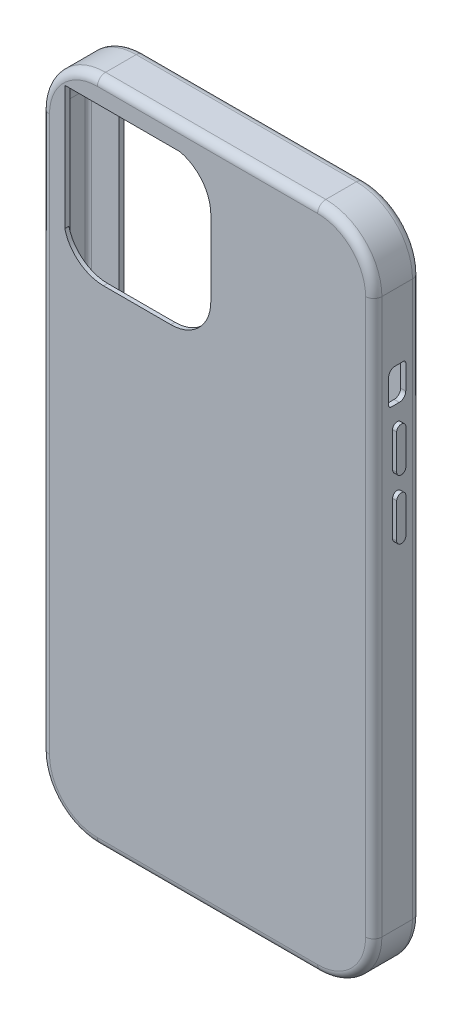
ISO-10303-21;
HEADER;
FILE_DESCRIPTION(('STEP AP214'),'2;1');
FILE_NAME('part.step','',(''),(''),'','','');
FILE_SCHEMA(('AUTOMOTIVE_DESIGN { 1 0 10303 214 1 1 1 1 }'));
ENDSEC;
DATA;
#1=APPLICATION_CONTEXT('core data for automotive mechanical design processes');
#2=APPLICATION_PROTOCOL_DEFINITION('international standard','automotive_design',2000,#1);
#3=PRODUCT_CONTEXT('',#1,'mechanical');
#4=PRODUCT('Part','Part','',(#3));
#5=PRODUCT_RELATED_PRODUCT_CATEGORY('part','',(#4));
#6=PRODUCT_DEFINITION_FORMATION('','',#4);
#7=PRODUCT_DEFINITION_CONTEXT('part definition',#1,'design');
#8=PRODUCT_DEFINITION('design','',#6,#7);
#9=PRODUCT_DEFINITION_SHAPE('','',#8);
#10=(LENGTH_UNIT() NAMED_UNIT(*) SI_UNIT(.MILLI.,.METRE.));
#11=(NAMED_UNIT(*) PLANE_ANGLE_UNIT() SI_UNIT($,.RADIAN.));
#12=(NAMED_UNIT(*) SI_UNIT($,.STERADIAN.) SOLID_ANGLE_UNIT());
#13=UNCERTAINTY_MEASURE_WITH_UNIT(LENGTH_MEASURE(1.E-05),#10,'distance_accuracy_value','');
#14=(GEOMETRIC_REPRESENTATION_CONTEXT(3) GLOBAL_UNCERTAINTY_ASSIGNED_CONTEXT((#13)) GLOBAL_UNIT_ASSIGNED_CONTEXT((#10,
#11,#12)) REPRESENTATION_CONTEXT('',''));
#15=CARTESIAN_POINT('',(0.,0.,0.));
#16=DIRECTION('',(0.,0.,1.));
#17=DIRECTION('',(1.,0.,0.));
#18=AXIS2_PLACEMENT_3D('',#15,#16,#17);
#19=CARTESIAN_POINT('',(27.,68.,-0.5));
#20=DIRECTION('',(0.,0.,1.));
#21=DIRECTION('',(1.,0.,0.));
#22=AXIS2_PLACEMENT_3D('',#19,#20,#21);
#23=PLANE('',#22);
#24=DIRECTION('',(0.,1.,0.));
#25=VECTOR('',#24,1.);
#26=CARTESIAN_POINT('',(-32.,68.,-0.5));
#27=LINE('',#26,#25);
#28=CARTESIAN_POINT('',(-32.,73.,-0.5));
#29=VERTEX_POINT('',#28);
#30=CARTESIAN_POINT('',(-32.,-73.,-0.5));
#31=VERTEX_POINT('',#30);
#32=EDGE_CURVE('E653',#29,#31,#27,.F.);
#33=ORIENTED_EDGE('',*,*,#32,.F.);
#34=DIRECTION('',(1.,0.,0.));
#35=VECTOR('',#34,1.);
#36=CARTESIAN_POINT('',(27.,73.,-0.5));
#37=LINE('',#36,#35);
#38=CARTESIAN_POINT('',(32.,73.,-0.5));
#39=VERTEX_POINT('',#38);
#40=EDGE_CURVE('E658',#39,#29,#37,.F.);
#41=ORIENTED_EDGE('',*,*,#40,.F.);
#42=DIRECTION('',(0.,-1.,0.));
#43=VECTOR('',#42,1.);
#44=CARTESIAN_POINT('',(32.,-68.,-0.5));
#45=LINE('',#44,#43);
#46=CARTESIAN_POINT('',(32.,-73.,-0.5));
#47=VERTEX_POINT('',#46);
#48=EDGE_CURVE('E642',#47,#39,#45,.F.);
#49=ORIENTED_EDGE('',*,*,#48,.F.);
#50=DIRECTION('',(-1.,0.,0.));
#51=VECTOR('',#50,1.);
#52=CARTESIAN_POINT('',(-27.,-73.,-0.5));
#53=LINE('',#52,#51);
#54=EDGE_CURVE('E648',#31,#47,#53,.F.);
#55=ORIENTED_EDGE('',*,*,#54,.F.);
#56=EDGE_LOOP('',(#33,#41,#49,#55));
#57=FACE_BOUND('',#56,.T.);
#58=CARTESIAN_POINT('',(27.,-68.,-0.5));
#59=DIRECTION('',(0.,0.,-1.));
#60=DIRECTION('',(1.,0.,0.));
#61=AXIS2_PLACEMENT_3D('',#58,#59,#60);
#62=CIRCLE('',#61,11.7);
#63=CARTESIAN_POINT('',(27.,-79.7,-0.5));
#64=VERTEX_POINT('',#63);
#65=CARTESIAN_POINT('',(38.7,-68.,-0.5));
#66=VERTEX_POINT('',#65);
#67=EDGE_CURVE('E610',#64,#66,#62,.F.);
#68=ORIENTED_EDGE('',*,*,#67,.T.);
#69=DIRECTION('',(0.,1.,0.));
#70=VECTOR('',#69,1.);
#71=CARTESIAN_POINT('',(38.7,0.,-0.499999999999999));
#72=LINE('',#71,#70);
#73=CARTESIAN_POINT('',(38.7,68.,-0.5));
#74=VERTEX_POINT('',#73);
#75=EDGE_CURVE('E641',#66,#74,#72,.T.);
#76=ORIENTED_EDGE('',*,*,#75,.T.);
#77=CARTESIAN_POINT('',(27.,68.,-0.5));
#78=DIRECTION('',(0.,0.,-1.));
#79=DIRECTION('',(0.,1.,0.));
#80=AXIS2_PLACEMENT_3D('',#77,#78,#79);
#81=CIRCLE('',#80,11.7);
#82=CARTESIAN_POINT('',(27.,79.7,-0.5));
#83=VERTEX_POINT('',#82);
#84=EDGE_CURVE('E669',#74,#83,#81,.F.);
#85=ORIENTED_EDGE('',*,*,#84,.T.);
#86=DIRECTION('',(-1.,0.,0.));
#87=VECTOR('',#86,1.);
#88=CARTESIAN_POINT('',(27.,79.7,-0.499999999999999));
#89=LINE('',#88,#87);
#90=CARTESIAN_POINT('',(-27.,79.7,-0.5));
#91=VERTEX_POINT('',#90);
#92=EDGE_CURVE('E567',#83,#91,#89,.T.);
#93=ORIENTED_EDGE('',*,*,#92,.T.);
#94=CARTESIAN_POINT('',(-27.,68.,-0.5));
#95=DIRECTION('',(0.,0.,-1.));
#96=DIRECTION('',(-1.,0.,0.));
#97=AXIS2_PLACEMENT_3D('',#94,#95,#96);
#98=CIRCLE('',#97,11.7);
#99=CARTESIAN_POINT('',(-38.7,68.,-0.5));
#100=VERTEX_POINT('',#99);
#101=EDGE_CURVE('E541',#91,#100,#98,.F.);
#102=ORIENTED_EDGE('',*,*,#101,.T.);
#103=DIRECTION('',(0.,-1.,0.));
#104=VECTOR('',#103,1.);
#105=CARTESIAN_POINT('',(-38.7,68.,-0.499999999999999));
#106=LINE('',#105,#104);
#107=CARTESIAN_POINT('',(-38.7,-68.,-0.5));
#108=VERTEX_POINT('',#107);
#109=EDGE_CURVE('E526',#100,#108,#106,.T.);
#110=ORIENTED_EDGE('',*,*,#109,.T.);
#111=CARTESIAN_POINT('',(-27.,-68.,-0.5));
#112=DIRECTION('',(0.,0.,-1.));
#113=DIRECTION('',(0.,-1.,0.));
#114=AXIS2_PLACEMENT_3D('',#111,#112,#113);
#115=CIRCLE('',#114,11.7);
#116=CARTESIAN_POINT('',(-27.,-79.7,-0.5));
#117=VERTEX_POINT('',#116);
#118=EDGE_CURVE('E690',#108,#117,#115,.F.);
#119=ORIENTED_EDGE('',*,*,#118,.T.);
#120=DIRECTION('',(1.,0.,0.));
#121=VECTOR('',#120,1.);
#122=CARTESIAN_POINT('',(-27.,-79.7,-0.499999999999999));
#123=LINE('',#122,#121);
#124=EDGE_CURVE('E546',#117,#64,#123,.T.);
#125=ORIENTED_EDGE('',*,*,#124,.T.);
#126=EDGE_LOOP('',(#68,#76,#85,#93,#102,#110,#119,#125));
#127=FACE_BOUND('',#126,.T.);
#128=ADVANCED_FACE('F16',(#57,#127),#23,.T.);
#129=CARTESIAN_POINT('',(27.,73.,-1.75));
#130=DIRECTION('',(0.,-1.,0.));
#131=DIRECTION('',(1.,0.,0.));
#132=AXIS2_PLACEMENT_3D('',#129,#130,#131);
#133=PLANE('',#132);
#134=DIRECTION('',(0.,0.,-1.));
#135=VECTOR('',#134,1.);
#136=CARTESIAN_POINT('',(-32.,73.,-1.75));
#137=LINE('',#136,#135);
#138=CARTESIAN_POINT('',(-32.,73.,-1.75));
#139=VERTEX_POINT('',#138);
#140=EDGE_CURVE('E655',#139,#29,#137,.F.);
#141=ORIENTED_EDGE('',*,*,#140,.F.);
#142=DIRECTION('',(-1.,0.,0.));
#143=VECTOR('',#142,1.);
#144=CARTESIAN_POINT('',(40.75,73.,-1.75));
#145=LINE('',#144,#143);
#146=CARTESIAN_POINT('',(32.,73.,-1.75));
#147=VERTEX_POINT('',#146);
#148=EDGE_CURVE('E2725',#147,#139,#145,.T.);
#149=ORIENTED_EDGE('',*,*,#148,.F.);
#150=DIRECTION('',(0.,0.,1.));
#151=VECTOR('',#150,1.);
#152=CARTESIAN_POINT('',(32.,73.,-1.75));
#153=LINE('',#152,#151);
#154=EDGE_CURVE('E638',#39,#147,#153,.F.);
#155=ORIENTED_EDGE('',*,*,#154,.F.);
#156=ORIENTED_EDGE('',*,*,#40,.T.);
#157=EDGE_LOOP('',(#141,#149,#155,#156));
#158=FACE_BOUND('',#157,.T.);
#159=ADVANCED_FACE('F2683',(#158),#133,.T.);
#160=CARTESIAN_POINT('',(-32.,68.,-1.75));
#161=DIRECTION('',(1.,0.,0.));
#162=DIRECTION('',(0.,0.,-1.));
#163=AXIS2_PLACEMENT_3D('',#160,#161,#162);
#164=PLANE('',#163);
#165=DIRECTION('',(0.,0.,1.));
#166=VECTOR('',#165,1.);
#167=CARTESIAN_POINT('',(-32.,-73.,-1.75));
#168=LINE('',#167,#166);
#169=CARTESIAN_POINT('',(-32.,-73.,-1.75));
#170=VERTEX_POINT('',#169);
#171=EDGE_CURVE('E650',#170,#31,#168,.T.);
#172=ORIENTED_EDGE('',*,*,#171,.F.);
#173=DIRECTION('',(0.,1.,0.));
#174=VECTOR('',#173,1.);
#175=CARTESIAN_POINT('',(-32.,68.,-1.75));
#176=LINE('',#175,#174);
#177=EDGE_CURVE('E2723',#139,#170,#176,.F.);
#178=ORIENTED_EDGE('',*,*,#177,.F.);
#179=ORIENTED_EDGE('',*,*,#140,.T.);
#180=ORIENTED_EDGE('',*,*,#32,.T.);
#181=EDGE_LOOP('',(#172,#178,#179,#180));
#182=FACE_BOUND('',#181,.T.);
#183=ADVANCED_FACE('F2674',(#182),#164,.T.);
#184=CARTESIAN_POINT('',(-27.,-73.,-1.75));
#185=DIRECTION('',(0.,1.,0.));
#186=DIRECTION('',(-1.,0.,0.));
#187=AXIS2_PLACEMENT_3D('',#184,#185,#186);
#188=PLANE('',#187);
#189=DIRECTION('',(0.,0.,1.));
#190=VECTOR('',#189,1.);
#191=CARTESIAN_POINT('',(32.,-73.,-1.75));
#192=LINE('',#191,#190);
#193=CARTESIAN_POINT('',(32.,-73.,-1.75));
#194=VERTEX_POINT('',#193);
#195=EDGE_CURVE('E645',#194,#47,#192,.T.);
#196=ORIENTED_EDGE('',*,*,#195,.F.);
#197=DIRECTION('',(-1.,0.,0.));
#198=VECTOR('',#197,1.);
#199=CARTESIAN_POINT('',(40.75,-73.,-1.75));
#200=LINE('',#199,#198);
#201=EDGE_CURVE('E2730',#170,#194,#200,.F.);
#202=ORIENTED_EDGE('',*,*,#201,.F.);
#203=ORIENTED_EDGE('',*,*,#171,.T.);
#204=ORIENTED_EDGE('',*,*,#54,.T.);
#205=EDGE_LOOP('',(#196,#202,#203,#204));
#206=FACE_BOUND('',#205,.T.);
#207=ADVANCED_FACE('F2666',(#206),#188,.T.);
#208=CARTESIAN_POINT('',(32.,-68.,-1.75));
#209=DIRECTION('',(-1.,0.,0.));
#210=DIRECTION('',(0.,-1.,0.));
#211=AXIS2_PLACEMENT_3D('',#208,#209,#210);
#212=PLANE('',#211);
#213=ORIENTED_EDGE('',*,*,#154,.T.);
#214=DIRECTION('',(0.,1.,0.));
#215=VECTOR('',#214,1.);
#216=CARTESIAN_POINT('',(32.,68.,-1.75));
#217=LINE('',#216,#215);
#218=EDGE_CURVE('E490',#194,#147,#217,.T.);
#219=ORIENTED_EDGE('',*,*,#218,.F.);
#220=ORIENTED_EDGE('',*,*,#195,.T.);
#221=ORIENTED_EDGE('',*,*,#48,.T.);
#222=EDGE_LOOP('',(#213,#219,#220,#221));
#223=FACE_BOUND('',#222,.T.);
#224=ADVANCED_FACE('F2659',(#223),#212,.T.);
#225=CARTESIAN_POINT('',(38.7,0.,0.299999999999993));
#226=DIRECTION('',(0.,1.,0.));
#227=DIRECTION('',(-1.,0.,0.));
#228=AXIS2_PLACEMENT_3D('',#225,#226,#227);
#229=CYLINDRICAL_SURFACE('',#228,0.799999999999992);
#230=CARTESIAN_POINT('',(38.7,68.,0.299999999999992));
#231=DIRECTION('',(0.,1.,0.));
#232=DIRECTION('',(1.,0.,0.));
#233=AXIS2_PLACEMENT_3D('',#230,#231,#232);
#234=CIRCLE('',#233,0.799999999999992);
#235=CARTESIAN_POINT('',(39.5,68.,0.299999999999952));
#236=VERTEX_POINT('',#235);
#237=EDGE_CURVE('E507',#236,#74,#234,.T.);
#238=ORIENTED_EDGE('',*,*,#237,.T.);
#239=ORIENTED_EDGE('',*,*,#75,.F.);
#240=CARTESIAN_POINT('',(38.7,-68.,0.299999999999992));
#241=DIRECTION('',(0.,1.,0.));
#242=DIRECTION('',(1.,0.,0.));
#243=AXIS2_PLACEMENT_3D('',#240,#241,#242);
#244=CIRCLE('',#243,0.799999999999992);
#245=CARTESIAN_POINT('',(39.5,-68.,0.299999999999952));
#246=VERTEX_POINT('',#245);
#247=EDGE_CURVE('E634',#66,#246,#244,.F.);
#248=ORIENTED_EDGE('',*,*,#247,.T.);
#249=DIRECTION('',(0.,-1.,0.));
#250=VECTOR('',#249,1.);
#251=CARTESIAN_POINT('',(39.5,-68.,0.299999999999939));
#252=LINE('',#251,#250);
#253=EDGE_CURVE('E486',#236,#246,#252,.T.);
#254=ORIENTED_EDGE('',*,*,#253,.F.);
#255=EDGE_LOOP('',(#238,#239,#248,#254));
#256=FACE_BOUND('',#255,.T.);
#257=ADVANCED_FACE('F627',(#256),#229,.F.);
#258=CARTESIAN_POINT('',(27.,-68.,0.299999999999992));
#259=DIRECTION('',(0.,0.,1.));
#260=DIRECTION('',(1.,0.,0.));
#261=AXIS2_PLACEMENT_3D('',#258,#259,#260);
#262=TOROIDAL_SURFACE('',#261,11.7,0.799999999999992);
#263=CARTESIAN_POINT('',(27.,-68.,0.299999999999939));
#264=DIRECTION('',(0.,0.,1.));
#265=DIRECTION('',(1.,0.,0.));
#266=AXIS2_PLACEMENT_3D('',#263,#264,#265);
#267=CIRCLE('',#266,12.5);
#268=CARTESIAN_POINT('',(27.,-80.5,0.299999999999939));
#269=VERTEX_POINT('',#268);
#270=EDGE_CURVE('E489',#269,#246,#267,.T.);
#271=ORIENTED_EDGE('',*,*,#270,.T.);
#272=ORIENTED_EDGE('',*,*,#247,.F.);
#273=ORIENTED_EDGE('',*,*,#67,.F.);
#274=CARTESIAN_POINT('',(27.,-79.7,0.299999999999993));
#275=DIRECTION('',(1.,0.,0.));
#276=DIRECTION('',(0.,1.,0.));
#277=AXIS2_PLACEMENT_3D('',#274,#275,#276);
#278=CIRCLE('',#277,0.799999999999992);
#279=EDGE_CURVE('E713',#64,#269,#278,.F.);
#280=ORIENTED_EDGE('',*,*,#279,.T.);
#281=EDGE_LOOP('',(#271,#272,#273,#280));
#282=FACE_BOUND('',#281,.T.);
#283=ADVANCED_FACE('F617',(#282),#262,.F.);
#284=CARTESIAN_POINT('',(-27.,-79.7,0.299999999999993));
#285=DIRECTION('',(1.,0.,0.));
#286=DIRECTION('',(0.,1.,0.));
#287=AXIS2_PLACEMENT_3D('',#284,#285,#286);
#288=CYLINDRICAL_SURFACE('',#287,0.799999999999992);
#289=DIRECTION('',(-1.,0.,0.));
#290=VECTOR('',#289,1.);
#291=CARTESIAN_POINT('',(-27.,-80.5,0.299999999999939));
#292=LINE('',#291,#290);
#293=CARTESIAN_POINT('',(-27.,-80.5,0.299999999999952));
#294=VERTEX_POINT('',#293);
#295=EDGE_CURVE('E577',#269,#294,#292,.T.);
#296=ORIENTED_EDGE('',*,*,#295,.F.);
#297=ORIENTED_EDGE('',*,*,#279,.F.);
#298=ORIENTED_EDGE('',*,*,#124,.F.);
#299=CARTESIAN_POINT('',(-27.,-79.7,0.299999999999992));
#300=DIRECTION('',(1.,0.,0.));
#301=DIRECTION('',(0.,-1.,0.));
#302=AXIS2_PLACEMENT_3D('',#299,#300,#301);
#303=CIRCLE('',#302,0.799999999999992);
#304=EDGE_CURVE('E534',#117,#294,#303,.F.);
#305=ORIENTED_EDGE('',*,*,#304,.T.);
#306=EDGE_LOOP('',(#296,#297,#298,#305));
#307=FACE_BOUND('',#306,.T.);
#308=ADVANCED_FACE('F592',(#307),#288,.F.);
#309=CARTESIAN_POINT('',(-27.,-68.,0.299999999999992));
#310=DIRECTION('',(0.,0.,1.));
#311=DIRECTION('',(1.,0.,0.));
#312=AXIS2_PLACEMENT_3D('',#309,#310,#311);
#313=TOROIDAL_SURFACE('',#312,11.7,0.799999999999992);
#314=CARTESIAN_POINT('',(-27.,-68.,0.299999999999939));
#315=DIRECTION('',(0.,0.,1.));
#316=DIRECTION('',(1.,0.,0.));
#317=AXIS2_PLACEMENT_3D('',#314,#315,#316);
#318=CIRCLE('',#317,12.5);
#319=CARTESIAN_POINT('',(-39.5,-68.,0.299999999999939));
#320=VERTEX_POINT('',#319);
#321=EDGE_CURVE('E573',#320,#294,#318,.T.);
#322=ORIENTED_EDGE('',*,*,#321,.T.);
#323=ORIENTED_EDGE('',*,*,#304,.F.);
#324=ORIENTED_EDGE('',*,*,#118,.F.);
#325=CARTESIAN_POINT('',(-38.7,-68.,0.299999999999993));
#326=DIRECTION('',(0.,-1.,0.));
#327=DIRECTION('',(0.,0.,-1.));
#328=AXIS2_PLACEMENT_3D('',#325,#326,#327);
#329=CIRCLE('',#328,0.799999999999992);
#330=EDGE_CURVE('E533',#108,#320,#329,.F.);
#331=ORIENTED_EDGE('',*,*,#330,.T.);
#332=EDGE_LOOP('',(#322,#323,#324,#331));
#333=FACE_BOUND('',#332,.T.);
#334=ADVANCED_FACE('F588',(#333),#313,.F.);
#335=CARTESIAN_POINT('',(-38.7,68.,0.299999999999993));
#336=DIRECTION('',(0.,-1.,0.));
#337=DIRECTION('',(0.,0.,-1.));
#338=AXIS2_PLACEMENT_3D('',#335,#336,#337);
#339=CYLINDRICAL_SURFACE('',#338,0.799999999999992);
#340=DIRECTION('',(0.,1.,0.));
#341=VECTOR('',#340,1.);
#342=CARTESIAN_POINT('',(-39.5,68.,0.299999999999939));
#343=LINE('',#342,#341);
#344=CARTESIAN_POINT('',(-39.5,68.,0.299999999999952));
#345=VERTEX_POINT('',#344);
#346=EDGE_CURVE('E869',#320,#345,#343,.T.);
#347=ORIENTED_EDGE('',*,*,#346,.F.);
#348=ORIENTED_EDGE('',*,*,#330,.F.);
#349=ORIENTED_EDGE('',*,*,#109,.F.);
#350=CARTESIAN_POINT('',(-38.7,68.,0.299999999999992));
#351=DIRECTION('',(0.,-1.,0.));
#352=DIRECTION('',(-1.,0.,0.));
#353=AXIS2_PLACEMENT_3D('',#350,#351,#352);
#354=CIRCLE('',#353,0.799999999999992);
#355=EDGE_CURVE('E565',#100,#345,#354,.F.);
#356=ORIENTED_EDGE('',*,*,#355,.T.);
#357=EDGE_LOOP('',(#347,#348,#349,#356));
#358=FACE_BOUND('',#357,.T.);
#359=ADVANCED_FACE('F558',(#358),#339,.F.);
#360=CARTESIAN_POINT('',(-27.,68.,0.299999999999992));
#361=DIRECTION('',(0.,0.,1.));
#362=DIRECTION('',(1.,0.,0.));
#363=AXIS2_PLACEMENT_3D('',#360,#361,#362);
#364=TOROIDAL_SURFACE('',#363,11.7,0.799999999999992);
#365=CARTESIAN_POINT('',(-27.,68.,0.299999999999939));
#366=DIRECTION('',(0.,0.,1.));
#367=DIRECTION('',(1.,0.,0.));
#368=AXIS2_PLACEMENT_3D('',#365,#366,#367);
#369=CIRCLE('',#368,12.5);
#370=CARTESIAN_POINT('',(-27.,80.5,0.299999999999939));
#371=VERTEX_POINT('',#370);
#372=EDGE_CURVE('E857',#371,#345,#369,.T.);
#373=ORIENTED_EDGE('',*,*,#372,.T.);
#374=ORIENTED_EDGE('',*,*,#355,.F.);
#375=ORIENTED_EDGE('',*,*,#101,.F.);
#376=CARTESIAN_POINT('',(-27.,79.7,0.299999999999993));
#377=DIRECTION('',(-1.,0.,0.));
#378=DIRECTION('',(0.,-1.,0.));
#379=AXIS2_PLACEMENT_3D('',#376,#377,#378);
#380=CIRCLE('',#379,0.799999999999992);
#381=EDGE_CURVE('E664',#91,#371,#380,.F.);
#382=ORIENTED_EDGE('',*,*,#381,.T.);
#383=EDGE_LOOP('',(#373,#374,#375,#382));
#384=FACE_BOUND('',#383,.T.);
#385=ADVANCED_FACE('F548',(#384),#364,.F.);
#386=CARTESIAN_POINT('',(27.,79.7,0.299999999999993));
#387=DIRECTION('',(-1.,0.,0.));
#388=DIRECTION('',(0.,-1.,0.));
#389=AXIS2_PLACEMENT_3D('',#386,#387,#388);
#390=CYLINDRICAL_SURFACE('',#389,0.799999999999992);
#391=DIRECTION('',(1.,0.,0.));
#392=VECTOR('',#391,1.);
#393=CARTESIAN_POINT('',(27.,80.5,0.299999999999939));
#394=LINE('',#393,#392);
#395=CARTESIAN_POINT('',(27.,80.5,0.299999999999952));
#396=VERTEX_POINT('',#395);
#397=EDGE_CURVE('E497',#371,#396,#394,.T.);
#398=ORIENTED_EDGE('',*,*,#397,.F.);
#399=ORIENTED_EDGE('',*,*,#381,.F.);
#400=ORIENTED_EDGE('',*,*,#92,.F.);
#401=CARTESIAN_POINT('',(27.,79.7,0.299999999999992));
#402=DIRECTION('',(-1.,0.,0.));
#403=DIRECTION('',(0.,1.,0.));
#404=AXIS2_PLACEMENT_3D('',#401,#402,#403);
#405=CIRCLE('',#404,0.799999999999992);
#406=EDGE_CURVE('E2733',#83,#396,#405,.F.);
#407=ORIENTED_EDGE('',*,*,#406,.T.);
#408=EDGE_LOOP('',(#398,#399,#400,#407));
#409=FACE_BOUND('',#408,.T.);
#410=ADVANCED_FACE('F515',(#409),#390,.F.);
#411=CARTESIAN_POINT('',(27.,68.,0.299999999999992));
#412=DIRECTION('',(0.,0.,1.));
#413=DIRECTION('',(1.,0.,0.));
#414=AXIS2_PLACEMENT_3D('',#411,#412,#413);
#415=TOROIDAL_SURFACE('',#414,11.7,0.799999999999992);
#416=CARTESIAN_POINT('',(27.,68.,0.299999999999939));
#417=DIRECTION('',(0.,0.,1.));
#418=DIRECTION('',(1.,0.,0.));
#419=AXIS2_PLACEMENT_3D('',#416,#417,#418);
#420=CIRCLE('',#419,12.5);
#421=EDGE_CURVE('E493',#236,#396,#420,.T.);
#422=ORIENTED_EDGE('',*,*,#421,.T.);
#423=ORIENTED_EDGE('',*,*,#406,.F.);
#424=ORIENTED_EDGE('',*,*,#84,.F.);
#425=ORIENTED_EDGE('',*,*,#237,.F.);
#426=EDGE_LOOP('',(#422,#423,#424,#425));
#427=FACE_BOUND('',#426,.T.);
#428=ADVANCED_FACE('F510',(#427),#415,.F.);
#429=CARTESIAN_POINT('',(-41.75,26.775,3.99999999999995));
#430=DIRECTION('',(-1.,0.,0.));
#431=DIRECTION('',(0.,0.,1.));
#432=AXIS2_PLACEMENT_3D('',#429,#430,#431);
#433=PLANE('',#432);
#434=DIRECTION('',(0.,1.,0.));
#435=VECTOR('',#434,1.);
#436=CARTESIAN_POINT('',(-41.75,34.27,2.85999999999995));
#437=LINE('',#436,#435);
#438=CARTESIAN_POINT('',(-41.75,19.28,2.85999999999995));
#439=VERTEX_POINT('',#438);
#440=CARTESIAN_POINT('',(-41.75,34.27,2.85999999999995));
#441=VERTEX_POINT('',#440);
#442=EDGE_CURVE('E458',#439,#441,#437,.T.);
#443=ORIENTED_EDGE('',*,*,#442,.F.);
#444=CARTESIAN_POINT('',(-41.75,19.28,3.99999999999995));
#445=DIRECTION('',(-1.,0.,0.));
#446=DIRECTION('',(0.,0.,1.));
#447=AXIS2_PLACEMENT_3D('',#444,#445,#446);
#448=CIRCLE('',#447,1.14);
#449=CARTESIAN_POINT('',(-41.75,19.28,5.13999999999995));
#450=VERTEX_POINT('',#449);
#451=EDGE_CURVE('E20',#450,#439,#448,.F.);
#452=ORIENTED_EDGE('',*,*,#451,.F.);
#453=DIRECTION('',(0.,-1.,0.));
#454=VECTOR('',#453,1.);
#455=CARTESIAN_POINT('',(-41.75,19.28,5.13999999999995));
#456=LINE('',#455,#454);
#457=CARTESIAN_POINT('',(-41.75,34.27,5.13999999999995));
#458=VERTEX_POINT('',#457);
#459=EDGE_CURVE('E456',#458,#450,#456,.T.);
#460=ORIENTED_EDGE('',*,*,#459,.F.);
#461=CARTESIAN_POINT('',(-41.75,34.27,3.99999999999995));
#462=DIRECTION('',(-1.,0.,0.));
#463=DIRECTION('',(0.,0.,1.));
#464=AXIS2_PLACEMENT_3D('',#461,#462,#463);
#465=CIRCLE('',#464,1.14);
#466=EDGE_CURVE('E476',#441,#458,#465,.F.);
#467=ORIENTED_EDGE('',*,*,#466,.F.);
#468=EDGE_LOOP('',(#443,#452,#460,#467));
#469=FACE_BOUND('',#468,.T.);
#470=ADVANCED_FACE('F453',(#469),#433,.T.);
#471=CARTESIAN_POINT('',(41.75,19.55,3.99999999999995));
#472=DIRECTION('',(1.,0.,0.));
#473=DIRECTION('',(0.,1.,0.));
#474=AXIS2_PLACEMENT_3D('',#471,#472,#473);
#475=PLANE('',#474);
#476=DIRECTION('',(0.,1.,0.));
#477=VECTOR('',#476,1.);
#478=CARTESIAN_POINT('',(41.75,15.275,2.87499999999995));
#479=LINE('',#478,#477);
#480=CARTESIAN_POINT('',(41.75,23.825,2.87499999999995));
#481=VERTEX_POINT('',#480);
#482=CARTESIAN_POINT('',(41.75,15.275,2.87499999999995));
#483=VERTEX_POINT('',#482);
#484=EDGE_CURVE('E1004',#481,#483,#479,.F.);
#485=ORIENTED_EDGE('',*,*,#484,.F.);
#486=CARTESIAN_POINT('',(41.75,23.825,3.99999999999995));
#487=DIRECTION('',(1.,0.,0.));
#488=DIRECTION('',(0.,0.,-1.));
#489=AXIS2_PLACEMENT_3D('',#486,#487,#488);
#490=CIRCLE('',#489,1.125);
#491=CARTESIAN_POINT('',(41.75,23.825,5.12499999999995));
#492=VERTEX_POINT('',#491);
#493=EDGE_CURVE('E1008',#492,#481,#490,.F.);
#494=ORIENTED_EDGE('',*,*,#493,.F.);
#495=DIRECTION('',(0.,-1.,0.));
#496=VECTOR('',#495,1.);
#497=CARTESIAN_POINT('',(41.75,23.825,5.12499999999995));
#498=LINE('',#497,#496);
#499=CARTESIAN_POINT('',(41.75,15.275,5.12499999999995));
#500=VERTEX_POINT('',#499);
#501=EDGE_CURVE('E996',#500,#492,#498,.F.);
#502=ORIENTED_EDGE('',*,*,#501,.F.);
#503=CARTESIAN_POINT('',(41.75,15.275,3.99999999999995));
#504=DIRECTION('',(1.,0.,0.));
#505=DIRECTION('',(0.,0.,-1.));
#506=AXIS2_PLACEMENT_3D('',#503,#504,#505);
#507=CIRCLE('',#506,1.125);
#508=EDGE_CURVE('E997',#483,#500,#507,.F.);
#509=ORIENTED_EDGE('',*,*,#508,.F.);
#510=EDGE_LOOP('',(#485,#494,#502,#509));
#511=FACE_BOUND('',#510,.T.);
#512=ADVANCED_FACE('F2597',(#511),#475,.T.);
#513=CARTESIAN_POINT('',(41.75,34.15,3.99999999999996));
#514=DIRECTION('',(1.,0.,0.));
#515=DIRECTION('',(0.,1.,0.));
#516=AXIS2_PLACEMENT_3D('',#513,#514,#515);
#517=PLANE('',#516);
#518=DIRECTION('',(0.,1.,0.));
#519=VECTOR('',#518,1.);
#520=CARTESIAN_POINT('',(41.75,29.875,2.87499999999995));
#521=LINE('',#520,#519);
#522=CARTESIAN_POINT('',(41.75,38.425,2.87499999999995));
#523=VERTEX_POINT('',#522);
#524=CARTESIAN_POINT('',(41.75,29.875,2.87499999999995));
#525=VERTEX_POINT('',#524);
#526=EDGE_CURVE('E988',#523,#525,#521,.F.);
#527=ORIENTED_EDGE('',*,*,#526,.F.);
#528=CARTESIAN_POINT('',(41.75,38.425,3.99999999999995));
#529=DIRECTION('',(1.,0.,0.));
#530=DIRECTION('',(0.,0.,-1.));
#531=AXIS2_PLACEMENT_3D('',#528,#529,#530);
#532=CIRCLE('',#531,1.125);
#533=CARTESIAN_POINT('',(41.75,38.425,5.12499999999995));
#534=VERTEX_POINT('',#533);
#535=EDGE_CURVE('E992',#534,#523,#532,.F.);
#536=ORIENTED_EDGE('',*,*,#535,.F.);
#537=DIRECTION('',(0.,-1.,0.));
#538=VECTOR('',#537,1.);
#539=CARTESIAN_POINT('',(41.75,38.425,5.12499999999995));
#540=LINE('',#539,#538);
#541=CARTESIAN_POINT('',(41.75,29.875,5.12499999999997));
#542=VERTEX_POINT('',#541);
#543=EDGE_CURVE('E981',#542,#534,#540,.F.);
#544=ORIENTED_EDGE('',*,*,#543,.F.);
#545=CARTESIAN_POINT('',(41.75,29.875,3.99999999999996));
#546=DIRECTION('',(1.,0.,0.));
#547=DIRECTION('',(0.,0.,-1.));
#548=AXIS2_PLACEMENT_3D('',#545,#546,#547);
#549=CIRCLE('',#548,1.12500000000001);
#550=EDGE_CURVE('E982',#525,#542,#549,.F.);
#551=ORIENTED_EDGE('',*,*,#550,.F.);
#552=EDGE_LOOP('',(#527,#536,#544,#551));
#553=FACE_BOUND('',#552,.T.);
#554=ADVANCED_FACE('F760',(#553),#517,.T.);
#555=CARTESIAN_POINT('',(40.75,68.,-1.75));
#556=DIRECTION('',(0.,0.,-1.));
#557=DIRECTION('',(-1.,0.,0.));
#558=AXIS2_PLACEMENT_3D('',#555,#556,#557);
#559=PLANE('',#558);
#560=ORIENTED_EDGE('',*,*,#201,.T.);
#561=ORIENTED_EDGE('',*,*,#218,.T.);
#562=ORIENTED_EDGE('',*,*,#148,.T.);
#563=ORIENTED_EDGE('',*,*,#177,.T.);
#564=EDGE_LOOP('',(#560,#561,#562,#563));
#565=FACE_BOUND('',#564,.T.);
#566=DIRECTION('',(1.,0.,0.));
#567=VECTOR('',#566,1.);
#568=CARTESIAN_POINT('',(6.87500000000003,-79.75,-1.75));
#569=LINE('',#568,#567);
#570=CARTESIAN_POINT('',(-27.,-79.75,-1.75));
#571=VERTEX_POINT('',#570);
#572=CARTESIAN_POINT('',(27.,-79.75,-1.75));
#573=VERTEX_POINT('',#572);
#574=EDGE_CURVE('E796',#571,#573,#569,.T.);
#575=ORIENTED_EDGE('',*,*,#574,.F.);
#576=CARTESIAN_POINT('',(-27.,-68.,-1.75));
#577=DIRECTION('',(0.,0.,1.));
#578=DIRECTION('',(-1.,0.,0.));
#579=AXIS2_PLACEMENT_3D('',#576,#577,#578);
#580=CIRCLE('',#579,11.75);
#581=CARTESIAN_POINT('',(-38.75,-68.,-1.75));
#582=VERTEX_POINT('',#581);
#583=EDGE_CURVE('E793',#582,#571,#580,.T.);
#584=ORIENTED_EDGE('',*,*,#583,.F.);
#585=DIRECTION('',(0.,-1.,0.));
#586=VECTOR('',#585,1.);
#587=CARTESIAN_POINT('',(-38.75,68.,-1.75));
#588=LINE('',#587,#586);
#589=CARTESIAN_POINT('',(-38.75,68.,-1.75));
#590=VERTEX_POINT('',#589);
#591=EDGE_CURVE('E462',#590,#582,#588,.T.);
#592=ORIENTED_EDGE('',*,*,#591,.F.);
#593=CARTESIAN_POINT('',(-27.,68.,-1.75));
#594=DIRECTION('',(0.,0.,1.));
#595=DIRECTION('',(0.,1.,0.));
#596=AXIS2_PLACEMENT_3D('',#593,#594,#595);
#597=CIRCLE('',#596,11.75);
#598=CARTESIAN_POINT('',(-27.,79.75,-1.75));
#599=VERTEX_POINT('',#598);
#600=EDGE_CURVE('E742',#599,#590,#597,.T.);
#601=ORIENTED_EDGE('',*,*,#600,.F.);
#602=DIRECTION('',(-1.,0.,0.));
#603=VECTOR('',#602,1.);
#604=CARTESIAN_POINT('',(33.875,79.75,-1.75));
#605=LINE('',#604,#603);
#606=CARTESIAN_POINT('',(27.,79.75,-1.75));
#607=VERTEX_POINT('',#606);
#608=EDGE_CURVE('E933',#607,#599,#605,.T.);
#609=ORIENTED_EDGE('',*,*,#608,.F.);
#610=CARTESIAN_POINT('',(27.,68.,-1.75));
#611=DIRECTION('',(0.,0.,1.));
#612=DIRECTION('',(1.,0.,0.));
#613=AXIS2_PLACEMENT_3D('',#610,#611,#612);
#614=CIRCLE('',#613,11.75);
#615=CARTESIAN_POINT('',(38.75,68.,-1.75));
#616=VERTEX_POINT('',#615);
#617=EDGE_CURVE('E950',#616,#607,#614,.T.);
#618=ORIENTED_EDGE('',*,*,#617,.F.);
#619=DIRECTION('',(0.,1.,0.));
#620=VECTOR('',#619,1.);
#621=CARTESIAN_POINT('',(38.75,0.,-1.75));
#622=LINE('',#621,#620);
#623=CARTESIAN_POINT('',(38.75,-68.,-1.75));
#624=VERTEX_POINT('',#623);
#625=EDGE_CURVE('E954',#624,#616,#622,.T.);
#626=ORIENTED_EDGE('',*,*,#625,.F.);
#627=CARTESIAN_POINT('',(27.,-68.,-1.75));
#628=DIRECTION('',(0.,0.,1.));
#629=DIRECTION('',(0.,-1.,0.));
#630=AXIS2_PLACEMENT_3D('',#627,#628,#629);
#631=CIRCLE('',#630,11.75);
#632=EDGE_CURVE('E783',#573,#624,#631,.T.);
#633=ORIENTED_EDGE('',*,*,#632,.F.);
#634=EDGE_LOOP('',(#575,#584,#592,#601,#609,#618,#626,#633));
#635=FACE_BOUND('',#634,.T.);
#636=ADVANCED_FACE('F750',(#565,#635),#559,.T.);
#637=CARTESIAN_POINT('',(39.5,-68.,0.29999999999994));
#638=DIRECTION('',(-1.,0.,0.));
#639=DIRECTION('',(0.,-1.,0.));
#640=AXIS2_PLACEMENT_3D('',#637,#638,#639);
#641=PLANE('',#640);
#642=DIRECTION('',(0.,0.,-1.));
#643=VECTOR('',#642,1.);
#644=CARTESIAN_POINT('',(39.5,43.4,3.49999999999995));
#645=LINE('',#644,#643);
#646=CARTESIAN_POINT('',(39.5,43.4,5.49999999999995));
#647=VERTEX_POINT('',#646);
#648=CARTESIAN_POINT('',(39.5,43.4,3.49999999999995));
#649=VERTEX_POINT('',#648);
#650=EDGE_CURVE('E1029',#647,#649,#645,.T.);
#651=ORIENTED_EDGE('',*,*,#650,.T.);
#652=CARTESIAN_POINT('',(39.5,45.,3.49999999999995));
#653=DIRECTION('',(-1.,0.,0.));
#654=DIRECTION('',(0.,0.,1.));
#655=AXIS2_PLACEMENT_3D('',#652,#653,#654);
#656=CIRCLE('',#655,1.6);
#657=CARTESIAN_POINT('',(39.5,45.,1.89999999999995));
#658=VERTEX_POINT('',#657);
#659=EDGE_CURVE('E1032',#649,#658,#656,.F.);
#660=ORIENTED_EDGE('',*,*,#659,.T.);
#661=DIRECTION('',(0.,1.,0.));
#662=VECTOR('',#661,1.);
#663=CARTESIAN_POINT('',(39.5,50.,1.89999999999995));
#664=LINE('',#663,#662);
#665=CARTESIAN_POINT('',(39.5,51.,1.89999999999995));
#666=VERTEX_POINT('',#665);
#667=EDGE_CURVE('E1148',#658,#666,#664,.T.);
#668=ORIENTED_EDGE('',*,*,#667,.T.);
#669=CARTESIAN_POINT('',(39.5,51.,2.49999999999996));
#670=DIRECTION('',(-1.,0.,0.));
#671=DIRECTION('',(0.,0.,1.));
#672=AXIS2_PLACEMENT_3D('',#669,#670,#671);
#673=CIRCLE('',#672,0.600000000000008);
#674=CARTESIAN_POINT('',(39.5,51.6,2.49999999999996));
#675=VERTEX_POINT('',#674);
#676=EDGE_CURVE('E1011',#666,#675,#673,.F.);
#677=ORIENTED_EDGE('',*,*,#676,.T.);
#678=DIRECTION('',(0.,0.,1.));
#679=VECTOR('',#678,1.);
#680=CARTESIAN_POINT('',(39.5,51.6,4.49999999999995));
#681=LINE('',#680,#679);
#682=CARTESIAN_POINT('',(39.5,51.6,4.49999999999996));
#683=VERTEX_POINT('',#682);
#684=EDGE_CURVE('E1017',#675,#683,#681,.T.);
#685=ORIENTED_EDGE('',*,*,#684,.T.);
#686=CARTESIAN_POINT('',(39.5,50.,4.49999999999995));
#687=DIRECTION('',(-1.,0.,0.));
#688=DIRECTION('',(0.,0.,1.));
#689=AXIS2_PLACEMENT_3D('',#686,#687,#688);
#690=CIRCLE('',#689,1.6);
#691=CARTESIAN_POINT('',(39.5,50.,6.09999999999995));
#692=VERTEX_POINT('',#691);
#693=EDGE_CURVE('E1020',#683,#692,#690,.F.);
#694=ORIENTED_EDGE('',*,*,#693,.T.);
#695=DIRECTION('',(0.,-1.,0.));
#696=VECTOR('',#695,1.);
#697=CARTESIAN_POINT('',(39.5,45.,6.09999999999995));
#698=LINE('',#697,#696);
#699=CARTESIAN_POINT('',(39.5,44.,6.09999999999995));
#700=VERTEX_POINT('',#699);
#701=EDGE_CURVE('E1023',#692,#700,#698,.T.);
#702=ORIENTED_EDGE('',*,*,#701,.T.);
#703=CARTESIAN_POINT('',(39.5,44.,5.49999999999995));
#704=DIRECTION('',(-1.,0.,0.));
#705=DIRECTION('',(0.,0.,1.));
#706=AXIS2_PLACEMENT_3D('',#703,#704,#705);
#707=CIRCLE('',#706,0.599999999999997);
#708=EDGE_CURVE('E1026',#700,#647,#707,.F.);
#709=ORIENTED_EDGE('',*,*,#708,.T.);
#710=EDGE_LOOP('',(#651,#660,#668,#677,#685,#694,#702,#709));
#711=FACE_BOUND('',#710,.T.);
#712=DIRECTION('',(0.,0.,1.));
#713=VECTOR('',#712,1.);
#714=CARTESIAN_POINT('',(39.5,68.,3.99999999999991));
#715=LINE('',#714,#713);
#716=CARTESIAN_POINT('',(39.5,68.,7.69999999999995));
#717=VERTEX_POINT('',#716);
#718=EDGE_CURVE('E723',#717,#236,#715,.F.);
#719=ORIENTED_EDGE('',*,*,#718,.T.);
#720=ORIENTED_EDGE('',*,*,#253,.T.);
#721=DIRECTION('',(0.,0.,1.));
#722=VECTOR('',#721,1.);
#723=CARTESIAN_POINT('',(39.5,-68.,3.99999999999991));
#724=LINE('',#723,#722);
#725=CARTESIAN_POINT('',(39.5,-68.,7.69999999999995));
#726=VERTEX_POINT('',#725);
#727=EDGE_CURVE('E717',#246,#726,#724,.T.);
#728=ORIENTED_EDGE('',*,*,#727,.T.);
#729=DIRECTION('',(0.,1.,0.));
#730=VECTOR('',#729,1.);
#731=CARTESIAN_POINT('',(39.5,0.,7.69999999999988));
#732=LINE('',#731,#730);
#733=EDGE_CURVE('E816',#726,#717,#732,.T.);
#734=ORIENTED_EDGE('',*,*,#733,.T.);
#735=EDGE_LOOP('',(#719,#720,#728,#734));
#736=FACE_BOUND('',#735,.T.);
#737=ADVANCED_FACE('F720',(#711,#736),#641,.T.);
#738=CARTESIAN_POINT('',(27.,-68.,3.99999999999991));
#739=DIRECTION('',(0.,0.,1.));
#740=DIRECTION('',(1.,0.,0.));
#741=AXIS2_PLACEMENT_3D('',#738,#739,#740);
#742=CYLINDRICAL_SURFACE('',#741,12.5);
#743=CARTESIAN_POINT('',(27.,-68.,7.70000000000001));
#744=DIRECTION('',(0.,0.,1.));
#745=DIRECTION('',(1.,0.,0.));
#746=AXIS2_PLACEMENT_3D('',#743,#744,#745);
#747=CIRCLE('',#746,12.5);
#748=CARTESIAN_POINT('',(27.,-80.5,7.69999999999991));
#749=VERTEX_POINT('',#748);
#750=EDGE_CURVE('E727',#749,#726,#747,.T.);
#751=ORIENTED_EDGE('',*,*,#750,.T.);
#752=ORIENTED_EDGE('',*,*,#727,.F.);
#753=ORIENTED_EDGE('',*,*,#270,.F.);
#754=DIRECTION('',(0.,0.,1.));
#755=VECTOR('',#754,1.);
#756=CARTESIAN_POINT('',(27.,-80.5,0.29999999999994));
#757=LINE('',#756,#755);
#758=EDGE_CURVE('E582',#749,#269,#757,.F.);
#759=ORIENTED_EDGE('',*,*,#758,.F.);
#760=EDGE_LOOP('',(#751,#752,#753,#759));
#761=FACE_BOUND('',#760,.T.);
#762=ADVANCED_FACE('F725',(#761),#742,.F.);
#763=CARTESIAN_POINT('',(-27.,-80.5,0.29999999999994));
#764=DIRECTION('',(0.,1.,0.));
#765=DIRECTION('',(-1.,0.,0.));
#766=AXIS2_PLACEMENT_3D('',#763,#764,#765);
#767=PLANE('',#766);
#768=CARTESIAN_POINT('',(17.775,-80.5,3.99999999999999));
#769=DIRECTION('',(0.,1.,0.));
#770=DIRECTION('',(0.,0.,1.));
#771=AXIS2_PLACEMENT_3D('',#768,#769,#770);
#772=CIRCLE('',#771,0.90000000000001);
#773=CARTESIAN_POINT('',(17.775,-80.5,4.9));
#774=VERTEX_POINT('',#773);
#775=EDGE_CURVE('E1149',#774,#774,#772,.F.);
#776=ORIENTED_EDGE('',*,*,#775,.T.);
#777=EDGE_LOOP('',(#776));
#778=FACE_BOUND('',#777,.T.);
#779=CARTESIAN_POINT('',(7.32500000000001,-80.5,3.99999999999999));
#780=DIRECTION('',(0.,1.,0.));
#781=DIRECTION('',(-1.,0.,0.));
#782=AXIS2_PLACEMENT_3D('',#779,#780,#781);
#783=CIRCLE('',#782,1.01509904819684);
#784=CARTESIAN_POINT('',(6.30990095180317,-80.5,3.99999999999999));
#785=VERTEX_POINT('',#784);
#786=EDGE_CURVE('E1152',#785,#785,#783,.F.);
#787=ORIENTED_EDGE('',*,*,#786,.T.);
#788=EDGE_LOOP('',(#787));
#789=FACE_BOUND('',#788,.T.);
#790=CARTESIAN_POINT('',(-15.875,-80.5,3.99999999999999));
#791=DIRECTION('',(0.,1.,0.));
#792=DIRECTION('',(0.,0.,1.));
#793=AXIS2_PLACEMENT_3D('',#790,#791,#792);
#794=CIRCLE('',#793,0.900000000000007);
#795=CARTESIAN_POINT('',(-15.875,-80.5,4.9));
#796=VERTEX_POINT('',#795);
#797=EDGE_CURVE('E1155',#796,#796,#794,.F.);
#798=ORIENTED_EDGE('',*,*,#797,.T.);
#799=EDGE_LOOP('',(#798));
#800=FACE_BOUND('',#799,.T.);
#801=DIRECTION('',(-1.,0.,0.));
#802=VECTOR('',#801,1.);
#803=CARTESIAN_POINT('',(2.8,-80.5,0.684999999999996));
#804=LINE('',#803,#802);
#805=CARTESIAN_POINT('',(-2.8,-80.5,0.684999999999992));
#806=VERTEX_POINT('',#805);
#807=CARTESIAN_POINT('',(2.8,-80.5,0.684999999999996));
#808=VERTEX_POINT('',#807);
#809=EDGE_CURVE('E1082',#806,#808,#804,.F.);
#810=ORIENTED_EDGE('',*,*,#809,.T.);
#811=CARTESIAN_POINT('',(2.8,-80.5,3.99999999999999));
#812=DIRECTION('',(0.,1.,0.));
#813=DIRECTION('',(-1.,0.,0.));
#814=AXIS2_PLACEMENT_3D('',#811,#812,#813);
#815=CIRCLE('',#814,3.315);
#816=CARTESIAN_POINT('',(2.8,-80.5,7.31499999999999));
#817=VERTEX_POINT('',#816);
#818=EDGE_CURVE('E1087',#808,#817,#815,.F.);
#819=ORIENTED_EDGE('',*,*,#818,.T.);
#820=DIRECTION('',(1.,0.,0.));
#821=VECTOR('',#820,1.);
#822=CARTESIAN_POINT('',(-2.8,-80.5,7.31499999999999));
#823=LINE('',#822,#821);
#824=CARTESIAN_POINT('',(-2.8,-80.5,7.31499999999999));
#825=VERTEX_POINT('',#824);
#826=EDGE_CURVE('E1086',#817,#825,#823,.F.);
#827=ORIENTED_EDGE('',*,*,#826,.T.);
#828=CARTESIAN_POINT('',(-2.8,-80.5,3.99999999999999));
#829=DIRECTION('',(0.,1.,0.));
#830=DIRECTION('',(-1.,0.,0.));
#831=AXIS2_PLACEMENT_3D('',#828,#829,#830);
#832=CIRCLE('',#831,3.315);
#833=EDGE_CURVE('E1158',#825,#806,#832,.F.);
#834=ORIENTED_EDGE('',*,*,#833,.T.);
#835=EDGE_LOOP('',(#810,#819,#827,#834));
#836=FACE_BOUND('',#835,.T.);
#837=CARTESIAN_POINT('',(-13.975,-80.5,3.99999999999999));
#838=DIRECTION('',(0.,1.,0.));
#839=DIRECTION('',(0.,0.,1.));
#840=AXIS2_PLACEMENT_3D('',#837,#838,#839);
#841=CIRCLE('',#840,0.900000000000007);
#842=CARTESIAN_POINT('',(-13.975,-80.5,4.9));
#843=VERTEX_POINT('',#842);
#844=EDGE_CURVE('E1088',#843,#843,#841,.F.);
#845=ORIENTED_EDGE('',*,*,#844,.T.);
#846=EDGE_LOOP('',(#845));
#847=FACE_BOUND('',#846,.T.);
#848=CARTESIAN_POINT('',(-21.575,-80.5,3.99999999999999));
#849=DIRECTION('',(0.,1.,0.));
#850=DIRECTION('',(0.,0.,1.));
#851=AXIS2_PLACEMENT_3D('',#848,#849,#850);
#852=CIRCLE('',#851,0.900000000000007);
#853=CARTESIAN_POINT('',(-21.575,-80.5,4.9));
#854=VERTEX_POINT('',#853);
#855=EDGE_CURVE('E1094',#854,#854,#852,.F.);
#856=ORIENTED_EDGE('',*,*,#855,.T.);
#857=EDGE_LOOP('',(#856));
#858=FACE_BOUND('',#857,.T.);
#859=CARTESIAN_POINT('',(15.875,-80.5,3.99999999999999));
#860=DIRECTION('',(0.,1.,0.));
#861=DIRECTION('',(0.,0.,1.));
#862=AXIS2_PLACEMENT_3D('',#859,#860,#861);
#863=CIRCLE('',#862,0.90000000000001);
#864=CARTESIAN_POINT('',(15.875,-80.5,4.9));
#865=VERTEX_POINT('',#864);
#866=EDGE_CURVE('E1099',#865,#865,#863,.F.);
#867=ORIENTED_EDGE('',*,*,#866,.T.);
#868=EDGE_LOOP('',(#867));
#869=FACE_BOUND('',#868,.T.);
#870=CARTESIAN_POINT('',(12.075,-80.5,3.99999999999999));
#871=DIRECTION('',(0.,1.,0.));
#872=DIRECTION('',(0.,0.,1.));
#873=AXIS2_PLACEMENT_3D('',#870,#871,#872);
#874=CIRCLE('',#873,0.900000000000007);
#875=CARTESIAN_POINT('',(12.075,-80.5,4.9));
#876=VERTEX_POINT('',#875);
#877=EDGE_CURVE('E1105',#876,#876,#874,.F.);
#878=ORIENTED_EDGE('',*,*,#877,.T.);
#879=EDGE_LOOP('',(#878));
#880=FACE_BOUND('',#879,.T.);
#881=CARTESIAN_POINT('',(-17.775,-80.5,3.99999999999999));
#882=DIRECTION('',(0.,1.,0.));
#883=DIRECTION('',(0.,0.,1.));
#884=AXIS2_PLACEMENT_3D('',#881,#882,#883);
#885=CIRCLE('',#884,0.900000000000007);
#886=CARTESIAN_POINT('',(-17.775,-80.5,4.9));
#887=VERTEX_POINT('',#886);
#888=EDGE_CURVE('E1108',#887,#887,#885,.F.);
#889=ORIENTED_EDGE('',*,*,#888,.T.);
#890=EDGE_LOOP('',(#889));
#891=FACE_BOUND('',#890,.T.);
#892=CARTESIAN_POINT('',(-7.325,-80.5,3.99999999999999));
#893=DIRECTION('',(0.,1.,0.));
#894=DIRECTION('',(-1.,0.,0.));
#895=AXIS2_PLACEMENT_3D('',#892,#893,#894);
#896=CIRCLE('',#895,1.01509904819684);
#897=CARTESIAN_POINT('',(-8.34009904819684,-80.5,3.99999999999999));
#898=VERTEX_POINT('',#897);
#899=EDGE_CURVE('E1111',#898,#898,#896,.F.);
#900=ORIENTED_EDGE('',*,*,#899,.T.);
#901=EDGE_LOOP('',(#900));
#902=FACE_BOUND('',#901,.T.);
#903=CARTESIAN_POINT('',(-12.075,-80.5,3.99999999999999));
#904=DIRECTION('',(0.,1.,0.));
#905=DIRECTION('',(0.,0.,1.));
#906=AXIS2_PLACEMENT_3D('',#903,#904,#905);
#907=CIRCLE('',#906,0.900000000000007);
#908=CARTESIAN_POINT('',(-12.075,-80.5,4.9));
#909=VERTEX_POINT('',#908);
#910=EDGE_CURVE('E1114',#909,#909,#907,.F.);
#911=ORIENTED_EDGE('',*,*,#910,.T.);
#912=EDGE_LOOP('',(#911));
#913=FACE_BOUND('',#912,.T.);
#914=CARTESIAN_POINT('',(-19.675,-80.5,3.99999999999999));
#915=DIRECTION('',(0.,1.,0.));
#916=DIRECTION('',(0.,0.,1.));
#917=AXIS2_PLACEMENT_3D('',#914,#915,#916);
#918=CIRCLE('',#917,0.900000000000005);
#919=CARTESIAN_POINT('',(-19.675,-80.5,4.9));
#920=VERTEX_POINT('',#919);
#921=EDGE_CURVE('E1117',#920,#920,#918,.F.);
#922=ORIENTED_EDGE('',*,*,#921,.T.);
#923=EDGE_LOOP('',(#922));
#924=FACE_BOUND('',#923,.T.);
#925=CARTESIAN_POINT('',(13.975,-80.5,3.99999999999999));
#926=DIRECTION('',(0.,1.,0.));
#927=DIRECTION('',(0.,0.,1.));
#928=AXIS2_PLACEMENT_3D('',#925,#926,#927);
#929=CIRCLE('',#928,0.900000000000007);
#930=CARTESIAN_POINT('',(13.975,-80.5,4.9));
#931=VERTEX_POINT('',#930);
#932=EDGE_CURVE('E1079',#931,#931,#929,.F.);
#933=ORIENTED_EDGE('',*,*,#932,.T.);
#934=EDGE_LOOP('',(#933));
#935=FACE_BOUND('',#934,.T.);
#936=ORIENTED_EDGE('',*,*,#758,.T.);
#937=ORIENTED_EDGE('',*,*,#295,.T.);
#938=DIRECTION('',(0.,0.,1.));
#939=VECTOR('',#938,1.);
#940=CARTESIAN_POINT('',(-27.,-80.5,3.99999999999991));
#941=LINE('',#940,#939);
#942=CARTESIAN_POINT('',(-27.,-80.5,7.69999999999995));
#943=VERTEX_POINT('',#942);
#944=EDGE_CURVE('E576',#294,#943,#941,.T.);
#945=ORIENTED_EDGE('',*,*,#944,.T.);
#946=DIRECTION('',(1.,0.,0.));
#947=VECTOR('',#946,1.);
#948=CARTESIAN_POINT('',(-27.,-80.5,7.69999999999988));
#949=LINE('',#948,#947);
#950=EDGE_CURVE('E872',#943,#749,#949,.T.);
#951=ORIENTED_EDGE('',*,*,#950,.T.);
#952=EDGE_LOOP('',(#936,#937,#945,#951));
#953=FACE_BOUND('',#952,.T.);
#954=ADVANCED_FACE('F1838',(#778,#789,#800,#836,#847,#858,#869,#880,#891,#902,#913,#924,#935,
#953),#767,.T.);
#955=CARTESIAN_POINT('',(-27.,-68.,3.99999999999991));
#956=DIRECTION('',(0.,0.,1.));
#957=DIRECTION('',(1.,0.,0.));
#958=AXIS2_PLACEMENT_3D('',#955,#956,#957);
#959=CYLINDRICAL_SURFACE('',#958,12.5);
#960=CARTESIAN_POINT('',(-27.,-68.,7.70000000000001));
#961=DIRECTION('',(0.,0.,1.));
#962=DIRECTION('',(1.,0.,0.));
#963=AXIS2_PLACEMENT_3D('',#960,#961,#962);
#964=CIRCLE('',#963,12.5);
#965=CARTESIAN_POINT('',(-39.5,-68.,7.69999999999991));
#966=VERTEX_POINT('',#965);
#967=EDGE_CURVE('E860',#966,#943,#964,.T.);
#968=ORIENTED_EDGE('',*,*,#967,.T.);
#969=ORIENTED_EDGE('',*,*,#944,.F.);
#970=ORIENTED_EDGE('',*,*,#321,.F.);
#971=DIRECTION('',(0.,0.,-1.));
#972=VECTOR('',#971,1.);
#973=CARTESIAN_POINT('',(-39.5,-68.,0.29999999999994));
#974=LINE('',#973,#972);
#975=EDGE_CURVE('E866',#966,#320,#974,.T.);
#976=ORIENTED_EDGE('',*,*,#975,.F.);
#977=EDGE_LOOP('',(#968,#969,#970,#976));
#978=FACE_BOUND('',#977,.T.);
#979=ADVANCED_FACE('F1834',(#978),#959,.F.);
#980=CARTESIAN_POINT('',(-39.5,68.,0.29999999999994));
#981=DIRECTION('',(1.,0.,0.));
#982=DIRECTION('',(0.,0.,-1.));
#983=AXIS2_PLACEMENT_3D('',#980,#981,#982);
#984=PLANE('',#983);
#985=ORIENTED_EDGE('',*,*,#975,.T.);
#986=ORIENTED_EDGE('',*,*,#346,.T.);
#987=DIRECTION('',(0.,0.,1.));
#988=VECTOR('',#987,1.);
#989=CARTESIAN_POINT('',(-39.5,68.,3.99999999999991));
#990=LINE('',#989,#988);
#991=CARTESIAN_POINT('',(-39.5,68.,7.69999999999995));
#992=VERTEX_POINT('',#991);
#993=EDGE_CURVE('E847',#345,#992,#990,.T.);
#994=ORIENTED_EDGE('',*,*,#993,.T.);
#995=DIRECTION('',(0.,-1.,0.));
#996=VECTOR('',#995,1.);
#997=CARTESIAN_POINT('',(-39.5,68.,7.69999999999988));
#998=LINE('',#997,#996);
#999=EDGE_CURVE('E850',#992,#966,#998,.T.);
#1000=ORIENTED_EDGE('',*,*,#999,.T.);
#1001=EDGE_LOOP('',(#985,#986,#994,#1000));
#1002=FACE_BOUND('',#1001,.T.);
#1003=ADVANCED_FACE('F1830',(#1002),#984,.T.);
#1004=CARTESIAN_POINT('',(-27.,68.,3.99999999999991));
#1005=DIRECTION('',(0.,0.,1.));
#1006=DIRECTION('',(1.,0.,0.));
#1007=AXIS2_PLACEMENT_3D('',#1004,#1005,#1006);
#1008=CYLINDRICAL_SURFACE('',#1007,12.5);
#1009=CARTESIAN_POINT('',(-27.,68.,7.70000000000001));
#1010=DIRECTION('',(0.,0.,1.));
#1011=DIRECTION('',(1.,0.,0.));
#1012=AXIS2_PLACEMENT_3D('',#1009,#1010,#1011);
#1013=CIRCLE('',#1012,12.5);
#1014=CARTESIAN_POINT('',(-27.,80.5,7.69999999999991));
#1015=VERTEX_POINT('',#1014);
#1016=EDGE_CURVE('E839',#1015,#992,#1013,.T.);
#1017=ORIENTED_EDGE('',*,*,#1016,.T.);
#1018=ORIENTED_EDGE('',*,*,#993,.F.);
#1019=ORIENTED_EDGE('',*,*,#372,.F.);
#1020=DIRECTION('',(0.,0.,1.));
#1021=VECTOR('',#1020,1.);
#1022=CARTESIAN_POINT('',(-27.,80.5,0.29999999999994));
#1023=LINE('',#1022,#1021);
#1024=EDGE_CURVE('E502',#1015,#371,#1023,.F.);
#1025=ORIENTED_EDGE('',*,*,#1024,.F.);
#1026=EDGE_LOOP('',(#1017,#1018,#1019,#1025));
#1027=FACE_BOUND('',#1026,.T.);
#1028=ADVANCED_FACE('F1826',(#1027),#1008,.F.);
#1029=CARTESIAN_POINT('',(27.,80.5,0.29999999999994));
#1030=DIRECTION('',(0.,-1.,0.));
#1031=DIRECTION('',(1.,0.,0.));
#1032=AXIS2_PLACEMENT_3D('',#1029,#1030,#1031);
#1033=PLANE('',#1032);
#1034=ORIENTED_EDGE('',*,*,#1024,.T.);
#1035=ORIENTED_EDGE('',*,*,#397,.T.);
#1036=DIRECTION('',(0.,0.,1.));
#1037=VECTOR('',#1036,1.);
#1038=CARTESIAN_POINT('',(27.,80.5,3.99999999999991));
#1039=LINE('',#1038,#1037);
#1040=CARTESIAN_POINT('',(27.,80.5,7.69999999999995));
#1041=VERTEX_POINT('',#1040);
#1042=EDGE_CURVE('E496',#396,#1041,#1039,.T.);
#1043=ORIENTED_EDGE('',*,*,#1042,.T.);
#1044=DIRECTION('',(-1.,0.,0.));
#1045=VECTOR('',#1044,1.);
#1046=CARTESIAN_POINT('',(27.,80.5,7.69999999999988));
#1047=LINE('',#1046,#1045);
#1048=EDGE_CURVE('E827',#1041,#1015,#1047,.T.);
#1049=ORIENTED_EDGE('',*,*,#1048,.T.);
#1050=EDGE_LOOP('',(#1034,#1035,#1043,#1049));
#1051=FACE_BOUND('',#1050,.T.);
#1052=ADVANCED_FACE('F1822',(#1051),#1033,.T.);
#1053=CARTESIAN_POINT('',(27.,68.,3.99999999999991));
#1054=DIRECTION('',(0.,0.,1.));
#1055=DIRECTION('',(1.,0.,0.));
#1056=AXIS2_PLACEMENT_3D('',#1053,#1054,#1055);
#1057=CYLINDRICAL_SURFACE('',#1056,12.5);
#1058=CARTESIAN_POINT('',(27.,68.,7.70000000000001));
#1059=DIRECTION('',(0.,0.,1.));
#1060=DIRECTION('',(1.,0.,0.));
#1061=AXIS2_PLACEMENT_3D('',#1058,#1059,#1060);
#1062=CIRCLE('',#1061,12.5);
#1063=EDGE_CURVE('E820',#717,#1041,#1062,.T.);
#1064=ORIENTED_EDGE('',*,*,#1063,.T.);
#1065=ORIENTED_EDGE('',*,*,#1042,.F.);
#1066=ORIENTED_EDGE('',*,*,#421,.F.);
#1067=ORIENTED_EDGE('',*,*,#718,.F.);
#1068=EDGE_LOOP('',(#1064,#1065,#1066,#1067));
#1069=FACE_BOUND('',#1068,.T.);
#1070=ADVANCED_FACE('F1819',(#1069),#1057,.F.);
#1071=CARTESIAN_POINT('',(-38.75,68.,0.250000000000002));
#1072=DIRECTION('',(0.,-1.,0.));
#1073=DIRECTION('',(0.,0.,-1.));
#1074=AXIS2_PLACEMENT_3D('',#1071,#1072,#1073);
#1075=CYLINDRICAL_SURFACE('',#1074,2.);
#1076=CARTESIAN_POINT('',(-38.75,-68.,0.250000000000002));
#1077=DIRECTION('',(0.,-1.,0.));
#1078=DIRECTION('',(-1.,0.,0.));
#1079=AXIS2_PLACEMENT_3D('',#1076,#1077,#1078);
#1080=CIRCLE('',#1079,2.);
#1081=CARTESIAN_POINT('',(-40.75,-68.,0.250000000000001));
#1082=VERTEX_POINT('',#1081);
#1083=EDGE_CURVE('E471',#1082,#582,#1080,.T.);
#1084=ORIENTED_EDGE('',*,*,#1083,.F.);
#1085=DIRECTION('',(0.,1.,0.));
#1086=VECTOR('',#1085,1.);
#1087=CARTESIAN_POINT('',(-40.75,68.,0.25));
#1088=LINE('',#1087,#1086);
#1089=CARTESIAN_POINT('',(-40.75,68.,0.250000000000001));
#1090=VERTEX_POINT('',#1089);
#1091=EDGE_CURVE('E908',#1090,#1082,#1088,.F.);
#1092=ORIENTED_EDGE('',*,*,#1091,.F.);
#1093=CARTESIAN_POINT('',(-38.75,68.,0.250000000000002));
#1094=DIRECTION('',(0.,-1.,0.));
#1095=DIRECTION('',(-1.,0.,0.));
#1096=AXIS2_PLACEMENT_3D('',#1093,#1094,#1095);
#1097=CIRCLE('',#1096,2.);
#1098=EDGE_CURVE('E940',#590,#1090,#1097,.F.);
#1099=ORIENTED_EDGE('',*,*,#1098,.F.);
#1100=ORIENTED_EDGE('',*,*,#591,.T.);
#1101=EDGE_LOOP('',(#1084,#1092,#1099,#1100));
#1102=FACE_BOUND('',#1101,.T.);
#1103=ADVANCED_FACE('F1816',(#1102),#1075,.T.);
#1104=CARTESIAN_POINT('',(-40.75,19.28,3.99999999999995));
#1105=DIRECTION('',(-1.,0.,0.));
#1106=DIRECTION('',(0.,0.,1.));
#1107=AXIS2_PLACEMENT_3D('',#1104,#1105,#1106);
#1108=CYLINDRICAL_SURFACE('',#1107,1.14);
#1109=ORIENTED_EDGE('',*,*,#451,.T.);
#1110=DIRECTION('',(1.,0.,0.));
#1111=VECTOR('',#1110,1.);
#1112=CARTESIAN_POINT('',(-40.75,19.28,2.85999999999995));
#1113=LINE('',#1112,#1111);
#1114=CARTESIAN_POINT('',(-40.75,19.28,2.85999999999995));
#1115=VERTEX_POINT('',#1114);
#1116=EDGE_CURVE('E461',#1115,#439,#1113,.F.);
#1117=ORIENTED_EDGE('',*,*,#1116,.F.);
#1118=CARTESIAN_POINT('',(-40.75,19.28,3.99999999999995));
#1119=DIRECTION('',(-1.,0.,0.));
#1120=DIRECTION('',(0.,0.,1.));
#1121=AXIS2_PLACEMENT_3D('',#1118,#1119,#1120);
#1122=CIRCLE('',#1121,1.14);
#1123=CARTESIAN_POINT('',(-40.75,19.28,5.13999999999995));
#1124=VERTEX_POINT('',#1123);
#1125=EDGE_CURVE('E467',#1124,#1115,#1122,.F.);
#1126=ORIENTED_EDGE('',*,*,#1125,.F.);
#1127=DIRECTION('',(1.,0.,0.));
#1128=VECTOR('',#1127,1.);
#1129=CARTESIAN_POINT('',(-40.75,19.28,5.13999999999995));
#1130=LINE('',#1129,#1128);
#1131=EDGE_CURVE('E464',#450,#1124,#1130,.T.);
#1132=ORIENTED_EDGE('',*,*,#1131,.F.);
#1133=EDGE_LOOP('',(#1109,#1117,#1126,#1132));
#1134=FACE_BOUND('',#1133,.T.);
#1135=ADVANCED_FACE('F465',(#1134),#1108,.T.);
#1136=CARTESIAN_POINT('',(-40.75,34.27,2.85999999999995));
#1137=DIRECTION('',(0.,0.,-1.));
#1138=DIRECTION('',(0.,1.,0.));
#1139=AXIS2_PLACEMENT_3D('',#1136,#1137,#1138);
#1140=PLANE('',#1139);
#1141=ORIENTED_EDGE('',*,*,#442,.T.);
#1142=DIRECTION('',(-1.,0.,0.));
#1143=VECTOR('',#1142,1.);
#1144=CARTESIAN_POINT('',(-40.75,34.27,2.85999999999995));
#1145=LINE('',#1144,#1143);
#1146=CARTESIAN_POINT('',(-40.75,34.27,2.85999999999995));
#1147=VERTEX_POINT('',#1146);
#1148=EDGE_CURVE('E485',#1147,#441,#1145,.T.);
#1149=ORIENTED_EDGE('',*,*,#1148,.F.);
#1150=DIRECTION('',(0.,1.,0.));
#1151=VECTOR('',#1150,1.);
#1152=CARTESIAN_POINT('',(-40.75,68.,2.85999999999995));
#1153=LINE('',#1152,#1151);
#1154=EDGE_CURVE('E1130',#1115,#1147,#1153,.T.);
#1155=ORIENTED_EDGE('',*,*,#1154,.F.);
#1156=ORIENTED_EDGE('',*,*,#1116,.T.);
#1157=EDGE_LOOP('',(#1141,#1149,#1155,#1156));
#1158=FACE_BOUND('',#1157,.T.);
#1159=ADVANCED_FACE('F1129',(#1158),#1140,.T.);
#1160=CARTESIAN_POINT('',(-40.75,34.27,3.99999999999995));
#1161=DIRECTION('',(-1.,0.,0.));
#1162=DIRECTION('',(0.,0.,1.));
#1163=AXIS2_PLACEMENT_3D('',#1160,#1161,#1162);
#1164=CYLINDRICAL_SURFACE('',#1163,1.14);
#1165=ORIENTED_EDGE('',*,*,#466,.T.);
#1166=DIRECTION('',(1.,0.,0.));
#1167=VECTOR('',#1166,1.);
#1168=CARTESIAN_POINT('',(-40.75,34.27,5.13999999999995));
#1169=LINE('',#1168,#1167);
#1170=CARTESIAN_POINT('',(-40.75,34.27,5.13999999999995));
#1171=VERTEX_POINT('',#1170);
#1172=EDGE_CURVE('E474',#1171,#458,#1169,.F.);
#1173=ORIENTED_EDGE('',*,*,#1172,.F.);
#1174=CARTESIAN_POINT('',(-40.75,34.27,3.99999999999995));
#1175=DIRECTION('',(-1.,0.,0.));
#1176=DIRECTION('',(0.,0.,1.));
#1177=AXIS2_PLACEMENT_3D('',#1174,#1175,#1176);
#1178=CIRCLE('',#1177,1.14);
#1179=EDGE_CURVE('E1125',#1147,#1171,#1178,.F.);
#1180=ORIENTED_EDGE('',*,*,#1179,.F.);
#1181=ORIENTED_EDGE('',*,*,#1148,.T.);
#1182=EDGE_LOOP('',(#1165,#1173,#1180,#1181));
#1183=FACE_BOUND('',#1182,.T.);
#1184=ADVANCED_FACE('F1122',(#1183),#1164,.T.);
#1185=CARTESIAN_POINT('',(-40.75,19.28,5.13999999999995));
#1186=DIRECTION('',(0.,0.,1.));
#1187=DIRECTION('',(0.,-1.,0.));
#1188=AXIS2_PLACEMENT_3D('',#1185,#1186,#1187);
#1189=PLANE('',#1188);
#1190=ORIENTED_EDGE('',*,*,#459,.T.);
#1191=ORIENTED_EDGE('',*,*,#1131,.T.);
#1192=DIRECTION('',(0.,1.,0.));
#1193=VECTOR('',#1192,1.);
#1194=CARTESIAN_POINT('',(-40.75,68.,5.13999999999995));
#1195=LINE('',#1194,#1193);
#1196=EDGE_CURVE('E1135',#1171,#1124,#1195,.F.);
#1197=ORIENTED_EDGE('',*,*,#1196,.F.);
#1198=ORIENTED_EDGE('',*,*,#1172,.T.);
#1199=EDGE_LOOP('',(#1190,#1191,#1197,#1198));
#1200=FACE_BOUND('',#1199,.T.);
#1201=ADVANCED_FACE('F473',(#1200),#1189,.T.);
#1202=CARTESIAN_POINT('',(-27.,-68.,0.250000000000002));
#1203=DIRECTION('',(0.,0.,1.));
#1204=DIRECTION('',(1.,0.,0.));
#1205=AXIS2_PLACEMENT_3D('',#1202,#1203,#1204);
#1206=TOROIDAL_SURFACE('',#1205,11.75,2.);
#1207=ORIENTED_EDGE('',*,*,#1083,.T.);
#1208=ORIENTED_EDGE('',*,*,#583,.T.);
#1209=CARTESIAN_POINT('',(-27.,-79.75,0.250000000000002));
#1210=DIRECTION('',(1.,0.,0.));
#1211=DIRECTION('',(0.,1.,0.));
#1212=AXIS2_PLACEMENT_3D('',#1209,#1210,#1211);
#1213=CIRCLE('',#1212,2.);
#1214=CARTESIAN_POINT('',(-27.,-81.75,0.250000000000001));
#1215=VERTEX_POINT('',#1214);
#1216=EDGE_CURVE('E799',#1215,#571,#1213,.T.);
#1217=ORIENTED_EDGE('',*,*,#1216,.F.);
#1218=CARTESIAN_POINT('',(-27.,-68.,0.250000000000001));
#1219=DIRECTION('',(0.,0.,1.));
#1220=DIRECTION('',(1.,0.,0.));
#1221=AXIS2_PLACEMENT_3D('',#1218,#1219,#1220);
#1222=CIRCLE('',#1221,13.75);
#1223=EDGE_CURVE('E803',#1082,#1215,#1222,.T.);
#1224=ORIENTED_EDGE('',*,*,#1223,.F.);
#1225=EDGE_LOOP('',(#1207,#1208,#1217,#1224));
#1226=FACE_BOUND('',#1225,.T.);
#1227=ADVANCED_FACE('F801',(#1226),#1206,.T.);
#1228=CARTESIAN_POINT('',(6.87500000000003,-79.75,0.250000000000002));
#1229=DIRECTION('',(1.,0.,0.));
#1230=DIRECTION('',(0.,1.,0.));
#1231=AXIS2_PLACEMENT_3D('',#1228,#1229,#1230);
#1232=CYLINDRICAL_SURFACE('',#1231,2.);
#1233=ORIENTED_EDGE('',*,*,#1216,.T.);
#1234=ORIENTED_EDGE('',*,*,#574,.T.);
#1235=CARTESIAN_POINT('',(27.,-79.75,0.250000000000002));
#1236=DIRECTION('',(1.,0.,0.));
#1237=DIRECTION('',(0.,-1.,0.));
#1238=AXIS2_PLACEMENT_3D('',#1235,#1236,#1237);
#1239=CIRCLE('',#1238,2.);
#1240=CARTESIAN_POINT('',(27.,-81.75,0.250000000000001));
#1241=VERTEX_POINT('',#1240);
#1242=EDGE_CURVE('E1054',#1241,#573,#1239,.T.);
#1243=ORIENTED_EDGE('',*,*,#1242,.F.);
#1244=DIRECTION('',(1.,0.,0.));
#1245=VECTOR('',#1244,1.);
#1246=CARTESIAN_POINT('',(-27.,-81.75,0.25));
#1247=LINE('',#1246,#1245);
#1248=EDGE_CURVE('E1045',#1215,#1241,#1247,.T.);
#1249=ORIENTED_EDGE('',*,*,#1248,.F.);
#1250=EDGE_LOOP('',(#1233,#1234,#1243,#1249));
#1251=FACE_BOUND('',#1250,.T.);
#1252=ADVANCED_FACE('F1175',(#1251),#1232,.T.);
#1253=CARTESIAN_POINT('',(13.975,-81.75,3.99999999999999));
#1254=DIRECTION('',(0.,1.,0.));
#1255=DIRECTION('',(0.,0.,1.));
#1256=AXIS2_PLACEMENT_3D('',#1253,#1254,#1255);
#1257=CYLINDRICAL_SURFACE('',#1256,0.900000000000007);
#1258=ORIENTED_EDGE('',*,*,#932,.F.);
#1259=EDGE_LOOP('',(#1258));
#1260=FACE_BOUND('',#1259,.T.);
#1261=CARTESIAN_POINT('',(13.975,-81.75,3.99999999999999));
#1262=DIRECTION('',(0.,1.,0.));
#1263=DIRECTION('',(0.,0.,1.));
#1264=AXIS2_PLACEMENT_3D('',#1261,#1262,#1263);
#1265=CIRCLE('',#1264,0.900000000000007);
#1266=CARTESIAN_POINT('',(13.975,-81.75,4.9));
#1267=VERTEX_POINT('',#1266);
#1268=EDGE_CURVE('E1190',#1267,#1267,#1265,.T.);
#1269=ORIENTED_EDGE('',*,*,#1268,.F.);
#1270=EDGE_LOOP('',(#1269));
#1271=FACE_BOUND('',#1270,.T.);
#1272=ADVANCED_FACE('F1789',(#1260,#1271),#1257,.F.);
#1273=CARTESIAN_POINT('',(-19.675,-81.75,3.99999999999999));
#1274=DIRECTION('',(0.,1.,0.));
#1275=DIRECTION('',(0.,0.,1.));
#1276=AXIS2_PLACEMENT_3D('',#1273,#1274,#1275);
#1277=CYLINDRICAL_SURFACE('',#1276,0.900000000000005);
#1278=ORIENTED_EDGE('',*,*,#921,.F.);
#1279=EDGE_LOOP('',(#1278));
#1280=FACE_BOUND('',#1279,.T.);
#1281=CARTESIAN_POINT('',(-19.675,-81.75,3.99999999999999));
#1282=DIRECTION('',(0.,1.,0.));
#1283=DIRECTION('',(0.,0.,1.));
#1284=AXIS2_PLACEMENT_3D('',#1281,#1282,#1283);
#1285=CIRCLE('',#1284,0.900000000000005);
#1286=CARTESIAN_POINT('',(-19.675,-81.75,4.9));
#1287=VERTEX_POINT('',#1286);
#1288=EDGE_CURVE('E1193',#1287,#1287,#1285,.T.);
#1289=ORIENTED_EDGE('',*,*,#1288,.F.);
#1290=EDGE_LOOP('',(#1289));
#1291=FACE_BOUND('',#1290,.T.);
#1292=ADVANCED_FACE('F1786',(#1280,#1291),#1277,.F.);
#1293=CARTESIAN_POINT('',(-12.075,-81.75,3.99999999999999));
#1294=DIRECTION('',(0.,1.,0.));
#1295=DIRECTION('',(0.,0.,1.));
#1296=AXIS2_PLACEMENT_3D('',#1293,#1294,#1295);
#1297=CYLINDRICAL_SURFACE('',#1296,0.900000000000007);
#1298=ORIENTED_EDGE('',*,*,#910,.F.);
#1299=EDGE_LOOP('',(#1298));
#1300=FACE_BOUND('',#1299,.T.);
#1301=CARTESIAN_POINT('',(-12.075,-81.75,3.99999999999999));
#1302=DIRECTION('',(0.,1.,0.));
#1303=DIRECTION('',(0.,0.,1.));
#1304=AXIS2_PLACEMENT_3D('',#1301,#1302,#1303);
#1305=CIRCLE('',#1304,0.900000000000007);
#1306=CARTESIAN_POINT('',(-12.075,-81.75,4.9));
#1307=VERTEX_POINT('',#1306);
#1308=EDGE_CURVE('E1778',#1307,#1307,#1305,.T.);
#1309=ORIENTED_EDGE('',*,*,#1308,.F.);
#1310=EDGE_LOOP('',(#1309));
#1311=FACE_BOUND('',#1310,.T.);
#1312=ADVANCED_FACE('F1788',(#1300,#1311),#1297,.F.);
#1313=CARTESIAN_POINT('',(-7.325,-81.75,3.99999999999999));
#1314=DIRECTION('',(0.,1.,0.));
#1315=DIRECTION('',(-1.,0.,0.));
#1316=AXIS2_PLACEMENT_3D('',#1313,#1314,#1315);
#1317=CYLINDRICAL_SURFACE('',#1316,1.01509904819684);
#1318=ORIENTED_EDGE('',*,*,#899,.F.);
#1319=EDGE_LOOP('',(#1318));
#1320=FACE_BOUND('',#1319,.T.);
#1321=CARTESIAN_POINT('',(-7.325,-81.75,3.99999999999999));
#1322=DIRECTION('',(0.,1.,0.));
#1323=DIRECTION('',(-1.,0.,0.));
#1324=AXIS2_PLACEMENT_3D('',#1321,#1322,#1323);
#1325=CIRCLE('',#1324,1.01509904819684);
#1326=CARTESIAN_POINT('',(-8.34009904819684,-81.75,3.99999999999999));
#1327=VERTEX_POINT('',#1326);
#1328=EDGE_CURVE('E1775',#1327,#1327,#1325,.T.);
#1329=ORIENTED_EDGE('',*,*,#1328,.F.);
#1330=EDGE_LOOP('',(#1329));
#1331=FACE_BOUND('',#1330,.T.);
#1332=ADVANCED_FACE('F1796',(#1320,#1331),#1317,.F.);
#1333=CARTESIAN_POINT('',(-17.775,-81.75,3.99999999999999));
#1334=DIRECTION('',(0.,1.,0.));
#1335=DIRECTION('',(0.,0.,1.));
#1336=AXIS2_PLACEMENT_3D('',#1333,#1334,#1335);
#1337=CYLINDRICAL_SURFACE('',#1336,0.900000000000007);
#1338=ORIENTED_EDGE('',*,*,#888,.F.);
#1339=EDGE_LOOP('',(#1338));
#1340=FACE_BOUND('',#1339,.T.);
#1341=CARTESIAN_POINT('',(-17.775,-81.75,3.99999999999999));
#1342=DIRECTION('',(0.,1.,0.));
#1343=DIRECTION('',(0.,0.,1.));
#1344=AXIS2_PLACEMENT_3D('',#1341,#1342,#1343);
#1345=CIRCLE('',#1344,0.900000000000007);
#1346=CARTESIAN_POINT('',(-17.775,-81.75,4.9));
#1347=VERTEX_POINT('',#1346);
#1348=EDGE_CURVE('E1772',#1347,#1347,#1345,.T.);
#1349=ORIENTED_EDGE('',*,*,#1348,.F.);
#1350=EDGE_LOOP('',(#1349));
#1351=FACE_BOUND('',#1350,.T.);
#1352=ADVANCED_FACE('F1922',(#1340,#1351),#1337,.F.);
#1353=CARTESIAN_POINT('',(12.075,-81.75,3.99999999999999));
#1354=DIRECTION('',(0.,1.,0.));
#1355=DIRECTION('',(0.,0.,1.));
#1356=AXIS2_PLACEMENT_3D('',#1353,#1354,#1355);
#1357=CYLINDRICAL_SURFACE('',#1356,0.900000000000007);
#1358=ORIENTED_EDGE('',*,*,#877,.F.);
#1359=EDGE_LOOP('',(#1358));
#1360=FACE_BOUND('',#1359,.T.);
#1361=CARTESIAN_POINT('',(12.075,-81.75,3.99999999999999));
#1362=DIRECTION('',(0.,1.,0.));
#1363=DIRECTION('',(0.,0.,1.));
#1364=AXIS2_PLACEMENT_3D('',#1361,#1362,#1363);
#1365=CIRCLE('',#1364,0.900000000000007);
#1366=CARTESIAN_POINT('',(12.075,-81.75,4.9));
#1367=VERTEX_POINT('',#1366);
#1368=EDGE_CURVE('E1769',#1367,#1367,#1365,.T.);
#1369=ORIENTED_EDGE('',*,*,#1368,.F.);
#1370=EDGE_LOOP('',(#1369));
#1371=FACE_BOUND('',#1370,.T.);
#1372=ADVANCED_FACE('F1918',(#1360,#1371),#1357,.F.);
#1373=CARTESIAN_POINT('',(15.875,-81.75,3.99999999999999));
#1374=DIRECTION('',(0.,1.,0.));
#1375=DIRECTION('',(0.,0.,1.));
#1376=AXIS2_PLACEMENT_3D('',#1373,#1374,#1375);
#1377=CYLINDRICAL_SURFACE('',#1376,0.90000000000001);
#1378=ORIENTED_EDGE('',*,*,#866,.F.);
#1379=EDGE_LOOP('',(#1378));
#1380=FACE_BOUND('',#1379,.T.);
#1381=CARTESIAN_POINT('',(15.875,-81.75,3.99999999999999));
#1382=DIRECTION('',(0.,1.,0.));
#1383=DIRECTION('',(0.,0.,1.));
#1384=AXIS2_PLACEMENT_3D('',#1381,#1382,#1383);
#1385=CIRCLE('',#1384,0.90000000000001);
#1386=CARTESIAN_POINT('',(15.875,-81.75,4.9));
#1387=VERTEX_POINT('',#1386);
#1388=EDGE_CURVE('E1766',#1387,#1387,#1385,.T.);
#1389=ORIENTED_EDGE('',*,*,#1388,.F.);
#1390=EDGE_LOOP('',(#1389));
#1391=FACE_BOUND('',#1390,.T.);
#1392=ADVANCED_FACE('F1914',(#1380,#1391),#1377,.F.);
#1393=CARTESIAN_POINT('',(-21.575,-81.75,3.99999999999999));
#1394=DIRECTION('',(0.,1.,0.));
#1395=DIRECTION('',(0.,0.,1.));
#1396=AXIS2_PLACEMENT_3D('',#1393,#1394,#1395);
#1397=CYLINDRICAL_SURFACE('',#1396,0.900000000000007);
#1398=ORIENTED_EDGE('',*,*,#855,.F.);
#1399=EDGE_LOOP('',(#1398));
#1400=FACE_BOUND('',#1399,.T.);
#1401=CARTESIAN_POINT('',(-21.575,-81.75,3.99999999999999));
#1402=DIRECTION('',(0.,1.,0.));
#1403=DIRECTION('',(0.,0.,1.));
#1404=AXIS2_PLACEMENT_3D('',#1401,#1402,#1403);
#1405=CIRCLE('',#1404,0.900000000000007);
#1406=CARTESIAN_POINT('',(-21.575,-81.75,4.9));
#1407=VERTEX_POINT('',#1406);
#1408=EDGE_CURVE('E1763',#1407,#1407,#1405,.T.);
#1409=ORIENTED_EDGE('',*,*,#1408,.F.);
#1410=EDGE_LOOP('',(#1409));
#1411=FACE_BOUND('',#1410,.T.);
#1412=ADVANCED_FACE('F1910',(#1400,#1411),#1397,.F.);
#1413=CARTESIAN_POINT('',(-13.975,-81.75,3.99999999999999));
#1414=DIRECTION('',(0.,1.,0.));
#1415=DIRECTION('',(0.,0.,1.));
#1416=AXIS2_PLACEMENT_3D('',#1413,#1414,#1415);
#1417=CYLINDRICAL_SURFACE('',#1416,0.900000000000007);
#1418=ORIENTED_EDGE('',*,*,#844,.F.);
#1419=EDGE_LOOP('',(#1418));
#1420=FACE_BOUND('',#1419,.T.);
#1421=CARTESIAN_POINT('',(-13.975,-81.75,3.99999999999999));
#1422=DIRECTION('',(0.,1.,0.));
#1423=DIRECTION('',(0.,0.,1.));
#1424=AXIS2_PLACEMENT_3D('',#1421,#1422,#1423);
#1425=CIRCLE('',#1424,0.900000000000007);
#1426=CARTESIAN_POINT('',(-13.975,-81.75,4.9));
#1427=VERTEX_POINT('',#1426);
#1428=EDGE_CURVE('E1758',#1427,#1427,#1425,.T.);
#1429=ORIENTED_EDGE('',*,*,#1428,.F.);
#1430=EDGE_LOOP('',(#1429));
#1431=FACE_BOUND('',#1430,.T.);
#1432=ADVANCED_FACE('F1907',(#1420,#1431),#1417,.F.);
#1433=CARTESIAN_POINT('',(-2.8,-81.75,7.31499999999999));
#1434=DIRECTION('',(0.,0.,1.));
#1435=DIRECTION('',(1.,0.,0.));
#1436=AXIS2_PLACEMENT_3D('',#1433,#1434,#1435);
#1437=PLANE('',#1436);
#1438=DIRECTION('',(0.,1.,0.));
#1439=VECTOR('',#1438,1.);
#1440=CARTESIAN_POINT('',(-2.8,-81.75,7.31499999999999));
#1441=LINE('',#1440,#1439);
#1442=CARTESIAN_POINT('',(-2.8,-81.75,7.31499999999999));
#1443=VERTEX_POINT('',#1442);
#1444=EDGE_CURVE('E1159',#1443,#825,#1441,.T.);
#1445=ORIENTED_EDGE('',*,*,#1444,.T.);
#1446=ORIENTED_EDGE('',*,*,#826,.F.);
#1447=DIRECTION('',(0.,1.,0.));
#1448=VECTOR('',#1447,1.);
#1449=CARTESIAN_POINT('',(2.8,-81.75,7.31499999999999));
#1450=LINE('',#1449,#1448);
#1451=CARTESIAN_POINT('',(2.8,-81.75,7.31499999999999));
#1452=VERTEX_POINT('',#1451);
#1453=EDGE_CURVE('E1085',#817,#1452,#1450,.F.);
#1454=ORIENTED_EDGE('',*,*,#1453,.T.);
#1455=DIRECTION('',(1.,0.,0.));
#1456=VECTOR('',#1455,1.);
#1457=CARTESIAN_POINT('',(-27.,-81.75,7.31499999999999));
#1458=LINE('',#1457,#1456);
#1459=EDGE_CURVE('E1196',#1443,#1452,#1458,.T.);
#1460=ORIENTED_EDGE('',*,*,#1459,.F.);
#1461=EDGE_LOOP('',(#1445,#1446,#1454,#1460));
#1462=FACE_BOUND('',#1461,.T.);
#1463=ADVANCED_FACE('F1903',(#1462),#1437,.F.);
#1464=CARTESIAN_POINT('',(2.8,-81.75,3.99999999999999));
#1465=DIRECTION('',(0.,1.,0.));
#1466=DIRECTION('',(-1.,0.,0.));
#1467=AXIS2_PLACEMENT_3D('',#1464,#1465,#1466);
#1468=CYLINDRICAL_SURFACE('',#1467,3.315);
#1469=ORIENTED_EDGE('',*,*,#1453,.F.);
#1470=ORIENTED_EDGE('',*,*,#818,.F.);
#1471=DIRECTION('',(0.,1.,0.));
#1472=VECTOR('',#1471,1.);
#1473=CARTESIAN_POINT('',(2.8,-81.75,0.684999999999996));
#1474=LINE('',#1473,#1472);
#1475=CARTESIAN_POINT('',(2.8,-81.75,0.684999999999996));
#1476=VERTEX_POINT('',#1475);
#1477=EDGE_CURVE('E1084',#808,#1476,#1474,.F.);
#1478=ORIENTED_EDGE('',*,*,#1477,.T.);
#1479=CARTESIAN_POINT('',(2.8,-81.75,3.99999999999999));
#1480=DIRECTION('',(0.,1.,0.));
#1481=DIRECTION('',(-1.,0.,0.));
#1482=AXIS2_PLACEMENT_3D('',#1479,#1480,#1481);
#1483=CIRCLE('',#1482,3.315);
#1484=EDGE_CURVE('E1748',#1452,#1476,#1483,.T.);
#1485=ORIENTED_EDGE('',*,*,#1484,.F.);
#1486=EDGE_LOOP('',(#1469,#1470,#1478,#1485));
#1487=FACE_BOUND('',#1486,.T.);
#1488=ADVANCED_FACE('F1899',(#1487),#1468,.F.);
#1489=CARTESIAN_POINT('',(2.8,-81.75,0.684999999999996));
#1490=DIRECTION('',(0.,0.,-1.));
#1491=DIRECTION('',(-1.,0.,0.));
#1492=AXIS2_PLACEMENT_3D('',#1489,#1490,#1491);
#1493=PLANE('',#1492);
#1494=ORIENTED_EDGE('',*,*,#1477,.F.);
#1495=ORIENTED_EDGE('',*,*,#809,.F.);
#1496=DIRECTION('',(0.,1.,0.));
#1497=VECTOR('',#1496,1.);
#1498=CARTESIAN_POINT('',(-2.8,-81.75,0.68499999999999));
#1499=LINE('',#1498,#1497);
#1500=CARTESIAN_POINT('',(-2.8,-81.75,0.684999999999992));
#1501=VERTEX_POINT('',#1500);
#1502=EDGE_CURVE('E1157',#806,#1501,#1499,.F.);
#1503=ORIENTED_EDGE('',*,*,#1502,.T.);
#1504=DIRECTION('',(1.,0.,0.));
#1505=VECTOR('',#1504,1.);
#1506=CARTESIAN_POINT('',(-27.,-81.75,0.684999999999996));
#1507=LINE('',#1506,#1505);
#1508=EDGE_CURVE('E1745',#1476,#1501,#1507,.F.);
#1509=ORIENTED_EDGE('',*,*,#1508,.F.);
#1510=EDGE_LOOP('',(#1494,#1495,#1503,#1509));
#1511=FACE_BOUND('',#1510,.T.);
#1512=ADVANCED_FACE('F1892',(#1511),#1493,.F.);
#1513=CARTESIAN_POINT('',(-2.8,-81.75,3.99999999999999));
#1514=DIRECTION('',(0.,1.,0.));
#1515=DIRECTION('',(-1.,0.,0.));
#1516=AXIS2_PLACEMENT_3D('',#1513,#1514,#1515);
#1517=CYLINDRICAL_SURFACE('',#1516,3.315);
#1518=ORIENTED_EDGE('',*,*,#1502,.F.);
#1519=ORIENTED_EDGE('',*,*,#833,.F.);
#1520=ORIENTED_EDGE('',*,*,#1444,.F.);
#1521=CARTESIAN_POINT('',(-2.8,-81.75,3.99999999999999));
#1522=DIRECTION('',(0.,1.,0.));
#1523=DIRECTION('',(-1.,0.,0.));
#1524=AXIS2_PLACEMENT_3D('',#1521,#1522,#1523);
#1525=CIRCLE('',#1524,3.315);
#1526=EDGE_CURVE('E1747',#1501,#1443,#1525,.T.);
#1527=ORIENTED_EDGE('',*,*,#1526,.F.);
#1528=EDGE_LOOP('',(#1518,#1519,#1520,#1527));
#1529=FACE_BOUND('',#1528,.T.);
#1530=ADVANCED_FACE('F1884',(#1529),#1517,.F.);
#1531=CARTESIAN_POINT('',(-15.875,-81.75,3.99999999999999));
#1532=DIRECTION('',(0.,1.,0.));
#1533=DIRECTION('',(0.,0.,1.));
#1534=AXIS2_PLACEMENT_3D('',#1531,#1532,#1533);
#1535=CYLINDRICAL_SURFACE('',#1534,0.900000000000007);
#1536=ORIENTED_EDGE('',*,*,#797,.F.);
#1537=EDGE_LOOP('',(#1536));
#1538=FACE_BOUND('',#1537,.T.);
#1539=CARTESIAN_POINT('',(-15.875,-81.75,3.99999999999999));
#1540=DIRECTION('',(0.,1.,0.));
#1541=DIRECTION('',(0.,0.,1.));
#1542=AXIS2_PLACEMENT_3D('',#1539,#1540,#1541);
#1543=CIRCLE('',#1542,0.900000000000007);
#1544=CARTESIAN_POINT('',(-15.875,-81.75,4.9));
#1545=VERTEX_POINT('',#1544);
#1546=EDGE_CURVE('E1753',#1545,#1545,#1543,.T.);
#1547=ORIENTED_EDGE('',*,*,#1546,.F.);
#1548=EDGE_LOOP('',(#1547));
#1549=FACE_BOUND('',#1548,.T.);
#1550=ADVANCED_FACE('F1881',(#1538,#1549),#1535,.F.);
#1551=CARTESIAN_POINT('',(7.32500000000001,-81.75,3.99999999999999));
#1552=DIRECTION('',(0.,1.,0.));
#1553=DIRECTION('',(-1.,0.,0.));
#1554=AXIS2_PLACEMENT_3D('',#1551,#1552,#1553);
#1555=CYLINDRICAL_SURFACE('',#1554,1.01509904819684);
#1556=ORIENTED_EDGE('',*,*,#786,.F.);
#1557=EDGE_LOOP('',(#1556));
#1558=FACE_BOUND('',#1557,.T.);
#1559=CARTESIAN_POINT('',(7.32500000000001,-81.75,3.99999999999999));
#1560=DIRECTION('',(0.,1.,0.));
#1561=DIRECTION('',(-1.,0.,0.));
#1562=AXIS2_PLACEMENT_3D('',#1559,#1560,#1561);
#1563=CIRCLE('',#1562,1.01509904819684);
#1564=CARTESIAN_POINT('',(6.30990095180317,-81.75,3.99999999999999));
#1565=VERTEX_POINT('',#1564);
#1566=EDGE_CURVE('E1875',#1565,#1565,#1563,.T.);
#1567=ORIENTED_EDGE('',*,*,#1566,.F.);
#1568=EDGE_LOOP('',(#1567));
#1569=FACE_BOUND('',#1568,.T.);
#1570=ADVANCED_FACE('F1883',(#1558,#1569),#1555,.F.);
#1571=CARTESIAN_POINT('',(17.775,-81.75,3.99999999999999));
#1572=DIRECTION('',(0.,1.,0.));
#1573=DIRECTION('',(0.,0.,1.));
#1574=AXIS2_PLACEMENT_3D('',#1571,#1572,#1573);
#1575=CYLINDRICAL_SURFACE('',#1574,0.90000000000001);
#1576=ORIENTED_EDGE('',*,*,#775,.F.);
#1577=EDGE_LOOP('',(#1576));
#1578=FACE_BOUND('',#1577,.T.);
#1579=CARTESIAN_POINT('',(17.775,-81.75,3.99999999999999));
#1580=DIRECTION('',(0.,1.,0.));
#1581=DIRECTION('',(0.,0.,1.));
#1582=AXIS2_PLACEMENT_3D('',#1579,#1580,#1581);
#1583=CIRCLE('',#1582,0.90000000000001);
#1584=CARTESIAN_POINT('',(17.775,-81.75,4.9));
#1585=VERTEX_POINT('',#1584);
#1586=EDGE_CURVE('E1037',#1585,#1585,#1583,.T.);
#1587=ORIENTED_EDGE('',*,*,#1586,.F.);
#1588=EDGE_LOOP('',(#1587));
#1589=FACE_BOUND('',#1588,.T.);
#1590=ADVANCED_FACE('F1063',(#1578,#1589),#1575,.F.);
#1591=CARTESIAN_POINT('',(27.,-68.,0.250000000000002));
#1592=DIRECTION('',(0.,0.,1.));
#1593=DIRECTION('',(1.,0.,0.));
#1594=AXIS2_PLACEMENT_3D('',#1591,#1592,#1593);
#1595=TOROIDAL_SURFACE('',#1594,11.75,2.);
#1596=ORIENTED_EDGE('',*,*,#1242,.T.);
#1597=ORIENTED_EDGE('',*,*,#632,.T.);
#1598=CARTESIAN_POINT('',(38.75,-68.,0.250000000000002));
#1599=DIRECTION('',(0.,1.,0.));
#1600=DIRECTION('',(-1.,0.,0.));
#1601=AXIS2_PLACEMENT_3D('',#1598,#1599,#1600);
#1602=CIRCLE('',#1601,2.);
#1603=CARTESIAN_POINT('',(40.75,-68.,0.250000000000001));
#1604=VERTEX_POINT('',#1603);
#1605=EDGE_CURVE('E1040',#1604,#624,#1602,.T.);
#1606=ORIENTED_EDGE('',*,*,#1605,.F.);
#1607=CARTESIAN_POINT('',(27.,-68.,0.250000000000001));
#1608=DIRECTION('',(0.,0.,1.));
#1609=DIRECTION('',(1.,0.,0.));
#1610=AXIS2_PLACEMENT_3D('',#1607,#1608,#1609);
#1611=CIRCLE('',#1610,13.75);
#1612=EDGE_CURVE('E1033',#1241,#1604,#1611,.T.);
#1613=ORIENTED_EDGE('',*,*,#1612,.F.);
#1614=EDGE_LOOP('',(#1596,#1597,#1606,#1613));
#1615=FACE_BOUND('',#1614,.T.);
#1616=ADVANCED_FACE('F1057',(#1615),#1595,.T.);
#1617=CARTESIAN_POINT('',(38.75,0.,0.250000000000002));
#1618=DIRECTION('',(0.,1.,0.));
#1619=DIRECTION('',(-1.,0.,0.));
#1620=AXIS2_PLACEMENT_3D('',#1617,#1618,#1619);
#1621=CYLINDRICAL_SURFACE('',#1620,2.);
#1622=ORIENTED_EDGE('',*,*,#1605,.T.);
#1623=ORIENTED_EDGE('',*,*,#625,.T.);
#1624=CARTESIAN_POINT('',(38.75,68.,0.250000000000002));
#1625=DIRECTION('',(0.,1.,0.));
#1626=DIRECTION('',(1.,0.,0.));
#1627=AXIS2_PLACEMENT_3D('',#1624,#1625,#1626);
#1628=CIRCLE('',#1627,2.);
#1629=CARTESIAN_POINT('',(40.75,68.,0.250000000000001));
#1630=VERTEX_POINT('',#1629);
#1631=EDGE_CURVE('E973',#1630,#616,#1628,.T.);
#1632=ORIENTED_EDGE('',*,*,#1631,.F.);
#1633=DIRECTION('',(0.,1.,0.));
#1634=VECTOR('',#1633,1.);
#1635=CARTESIAN_POINT('',(40.75,-68.,0.25));
#1636=LINE('',#1635,#1634);
#1637=EDGE_CURVE('E1733',#1604,#1630,#1636,.T.);
#1638=ORIENTED_EDGE('',*,*,#1637,.F.);
#1639=EDGE_LOOP('',(#1622,#1623,#1632,#1638));
#1640=FACE_BOUND('',#1639,.T.);
#1641=ADVANCED_FACE('F1062',(#1640),#1621,.T.);
#1642=CARTESIAN_POINT('',(40.75,50.,1.89999999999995));
#1643=DIRECTION('',(0.,0.,-1.));
#1644=DIRECTION('',(0.,1.,0.));
#1645=AXIS2_PLACEMENT_3D('',#1642,#1643,#1644);
#1646=PLANE('',#1645);
#1647=ORIENTED_EDGE('',*,*,#667,.F.);
#1648=DIRECTION('',(-1.,0.,0.));
#1649=VECTOR('',#1648,1.);
#1650=CARTESIAN_POINT('',(40.75,45.,1.89999999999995));
#1651=LINE('',#1650,#1649);
#1652=CARTESIAN_POINT('',(40.75,45.,1.89999999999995));
#1653=VERTEX_POINT('',#1652);
#1654=EDGE_CURVE('E1030',#658,#1653,#1651,.F.);
#1655=ORIENTED_EDGE('',*,*,#1654,.T.);
#1656=DIRECTION('',(0.,1.,0.));
#1657=VECTOR('',#1656,1.);
#1658=CARTESIAN_POINT('',(40.75,-68.,1.89999999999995));
#1659=LINE('',#1658,#1657);
#1660=CARTESIAN_POINT('',(40.75,51.,1.89999999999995));
#1661=VERTEX_POINT('',#1660);
#1662=EDGE_CURVE('E1727',#1661,#1653,#1659,.F.);
#1663=ORIENTED_EDGE('',*,*,#1662,.F.);
#1664=DIRECTION('',(-1.,0.,0.));
#1665=VECTOR('',#1664,1.);
#1666=CARTESIAN_POINT('',(40.75,51.,1.89999999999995));
#1667=LINE('',#1666,#1665);
#1668=EDGE_CURVE('E1012',#1661,#666,#1667,.T.);
#1669=ORIENTED_EDGE('',*,*,#1668,.T.);
#1670=EDGE_LOOP('',(#1647,#1655,#1663,#1669));
#1671=FACE_BOUND('',#1670,.T.);
#1672=ADVANCED_FACE('F2007',(#1671),#1646,.F.);
#1673=CARTESIAN_POINT('',(40.75,45.,3.49999999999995));
#1674=DIRECTION('',(-1.,0.,0.));
#1675=DIRECTION('',(0.,0.,1.));
#1676=AXIS2_PLACEMENT_3D('',#1673,#1674,#1675);
#1677=CYLINDRICAL_SURFACE('',#1676,1.6);
#1678=ORIENTED_EDGE('',*,*,#1654,.F.);
#1679=ORIENTED_EDGE('',*,*,#659,.F.);
#1680=DIRECTION('',(1.,0.,0.));
#1681=VECTOR('',#1680,1.);
#1682=CARTESIAN_POINT('',(40.75,43.4,3.49999999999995));
#1683=LINE('',#1682,#1681);
#1684=CARTESIAN_POINT('',(40.75,43.4,3.49999999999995));
#1685=VERTEX_POINT('',#1684);
#1686=EDGE_CURVE('E1027',#649,#1685,#1683,.T.);
#1687=ORIENTED_EDGE('',*,*,#1686,.T.);
#1688=CARTESIAN_POINT('',(40.75,45.,3.49999999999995));
#1689=DIRECTION('',(-1.,0.,0.));
#1690=DIRECTION('',(0.,0.,1.));
#1691=AXIS2_PLACEMENT_3D('',#1688,#1689,#1690);
#1692=CIRCLE('',#1691,1.6);
#1693=EDGE_CURVE('E1726',#1653,#1685,#1692,.T.);
#1694=ORIENTED_EDGE('',*,*,#1693,.F.);
#1695=EDGE_LOOP('',(#1678,#1679,#1687,#1694));
#1696=FACE_BOUND('',#1695,.T.);
#1697=ADVANCED_FACE('F1858',(#1696),#1677,.F.);
#1698=CARTESIAN_POINT('',(40.75,43.4,3.49999999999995));
#1699=DIRECTION('',(0.,-1.,0.));
#1700=DIRECTION('',(0.,0.,-1.));
#1701=AXIS2_PLACEMENT_3D('',#1698,#1699,#1700);
#1702=PLANE('',#1701);
#1703=DIRECTION('',(0.,0.,1.));
#1704=VECTOR('',#1703,1.);
#1705=CARTESIAN_POINT('',(40.75,43.4,9.75));
#1706=LINE('',#1705,#1704);
#1707=CARTESIAN_POINT('',(40.75,43.4,5.49999999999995));
#1708=VERTEX_POINT('',#1707);
#1709=EDGE_CURVE('E1723',#1685,#1708,#1706,.T.);
#1710=ORIENTED_EDGE('',*,*,#1709,.F.);
#1711=ORIENTED_EDGE('',*,*,#1686,.F.);
#1712=ORIENTED_EDGE('',*,*,#650,.F.);
#1713=DIRECTION('',(-1.,0.,0.));
#1714=VECTOR('',#1713,1.);
#1715=CARTESIAN_POINT('',(40.75,43.4,5.49999999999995));
#1716=LINE('',#1715,#1714);
#1717=EDGE_CURVE('E1024',#647,#1708,#1716,.F.);
#1718=ORIENTED_EDGE('',*,*,#1717,.T.);
#1719=EDGE_LOOP('',(#1710,#1711,#1712,#1718));
#1720=FACE_BOUND('',#1719,.T.);
#1721=ADVANCED_FACE('F1861',(#1720),#1702,.F.);
#1722=CARTESIAN_POINT('',(40.75,44.,5.49999999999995));
#1723=DIRECTION('',(-1.,0.,0.));
#1724=DIRECTION('',(0.,0.,1.));
#1725=AXIS2_PLACEMENT_3D('',#1722,#1723,#1724);
#1726=CYLINDRICAL_SURFACE('',#1725,0.599999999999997);
#1727=ORIENTED_EDGE('',*,*,#1717,.F.);
#1728=ORIENTED_EDGE('',*,*,#708,.F.);
#1729=DIRECTION('',(1.,0.,0.));
#1730=VECTOR('',#1729,1.);
#1731=CARTESIAN_POINT('',(40.75,44.,6.09999999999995));
#1732=LINE('',#1731,#1730);
#1733=CARTESIAN_POINT('',(40.75,44.,6.09999999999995));
#1734=VERTEX_POINT('',#1733);
#1735=EDGE_CURVE('E1021',#700,#1734,#1732,.T.);
#1736=ORIENTED_EDGE('',*,*,#1735,.T.);
#1737=CARTESIAN_POINT('',(40.75,44.,5.49999999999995));
#1738=DIRECTION('',(-1.,0.,0.));
#1739=DIRECTION('',(0.,0.,1.));
#1740=AXIS2_PLACEMENT_3D('',#1737,#1738,#1739);
#1741=CIRCLE('',#1740,0.599999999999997);
#1742=EDGE_CURVE('E1722',#1708,#1734,#1741,.T.);
#1743=ORIENTED_EDGE('',*,*,#1742,.F.);
#1744=EDGE_LOOP('',(#1727,#1728,#1736,#1743));
#1745=FACE_BOUND('',#1744,.T.);
#1746=ADVANCED_FACE('F2016',(#1745),#1726,.F.);
#1747=CARTESIAN_POINT('',(40.75,45.,6.09999999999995));
#1748=DIRECTION('',(0.,0.,1.));
#1749=DIRECTION('',(0.,-1.,0.));
#1750=AXIS2_PLACEMENT_3D('',#1747,#1748,#1749);
#1751=PLANE('',#1750);
#1752=ORIENTED_EDGE('',*,*,#701,.F.);
#1753=DIRECTION('',(-1.,0.,0.));
#1754=VECTOR('',#1753,1.);
#1755=CARTESIAN_POINT('',(40.75,50.,6.09999999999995));
#1756=LINE('',#1755,#1754);
#1757=CARTESIAN_POINT('',(40.75,50.,6.09999999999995));
#1758=VERTEX_POINT('',#1757);
#1759=EDGE_CURVE('E1018',#692,#1758,#1756,.F.);
#1760=ORIENTED_EDGE('',*,*,#1759,.T.);
#1761=DIRECTION('',(0.,1.,0.));
#1762=VECTOR('',#1761,1.);
#1763=CARTESIAN_POINT('',(40.75,-68.,6.09999999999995));
#1764=LINE('',#1763,#1762);
#1765=EDGE_CURVE('E1719',#1734,#1758,#1764,.T.);
#1766=ORIENTED_EDGE('',*,*,#1765,.F.);
#1767=ORIENTED_EDGE('',*,*,#1735,.F.);
#1768=EDGE_LOOP('',(#1752,#1760,#1766,#1767));
#1769=FACE_BOUND('',#1768,.T.);
#1770=ADVANCED_FACE('F2017',(#1769),#1751,.F.);
#1771=CARTESIAN_POINT('',(40.75,50.,4.49999999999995));
#1772=DIRECTION('',(-1.,0.,0.));
#1773=DIRECTION('',(0.,0.,1.));
#1774=AXIS2_PLACEMENT_3D('',#1771,#1772,#1773);
#1775=CYLINDRICAL_SURFACE('',#1774,1.6);
#1776=ORIENTED_EDGE('',*,*,#1759,.F.);
#1777=ORIENTED_EDGE('',*,*,#693,.F.);
#1778=DIRECTION('',(1.,0.,0.));
#1779=VECTOR('',#1778,1.);
#1780=CARTESIAN_POINT('',(40.75,51.6,4.49999999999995));
#1781=LINE('',#1780,#1779);
#1782=CARTESIAN_POINT('',(40.75,51.6,4.49999999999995));
#1783=VERTEX_POINT('',#1782);
#1784=EDGE_CURVE('E1015',#683,#1783,#1781,.T.);
#1785=ORIENTED_EDGE('',*,*,#1784,.T.);
#1786=CARTESIAN_POINT('',(40.75,50.,4.49999999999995));
#1787=DIRECTION('',(-1.,0.,0.));
#1788=DIRECTION('',(0.,0.,1.));
#1789=AXIS2_PLACEMENT_3D('',#1786,#1787,#1788);
#1790=CIRCLE('',#1789,1.6);
#1791=EDGE_CURVE('E1718',#1758,#1783,#1790,.T.);
#1792=ORIENTED_EDGE('',*,*,#1791,.F.);
#1793=EDGE_LOOP('',(#1776,#1777,#1785,#1792));
#1794=FACE_BOUND('',#1793,.T.);
#1795=ADVANCED_FACE('F1994',(#1794),#1775,.F.);
#1796=CARTESIAN_POINT('',(40.75,51.6,4.49999999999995));
#1797=DIRECTION('',(0.,1.,0.));
#1798=DIRECTION('',(0.,0.,1.));
#1799=AXIS2_PLACEMENT_3D('',#1796,#1797,#1798);
#1800=PLANE('',#1799);
#1801=DIRECTION('',(0.,0.,1.));
#1802=VECTOR('',#1801,1.);
#1803=CARTESIAN_POINT('',(40.75,51.6,9.75));
#1804=LINE('',#1803,#1802);
#1805=CARTESIAN_POINT('',(40.75,51.6,2.49999999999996));
#1806=VERTEX_POINT('',#1805);
#1807=EDGE_CURVE('E1714',#1783,#1806,#1804,.F.);
#1808=ORIENTED_EDGE('',*,*,#1807,.F.);
#1809=ORIENTED_EDGE('',*,*,#1784,.F.);
#1810=ORIENTED_EDGE('',*,*,#684,.F.);
#1811=DIRECTION('',(-1.,0.,0.));
#1812=VECTOR('',#1811,1.);
#1813=CARTESIAN_POINT('',(40.75,51.6,2.49999999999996));
#1814=LINE('',#1813,#1812);
#1815=EDGE_CURVE('E1009',#675,#1806,#1814,.F.);
#1816=ORIENTED_EDGE('',*,*,#1815,.T.);
#1817=EDGE_LOOP('',(#1808,#1809,#1810,#1816));
#1818=FACE_BOUND('',#1817,.T.);
#1819=ADVANCED_FACE('F1999',(#1818),#1800,.F.);
#1820=CARTESIAN_POINT('',(40.75,51.,2.49999999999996));
#1821=DIRECTION('',(-1.,0.,0.));
#1822=DIRECTION('',(0.,0.,1.));
#1823=AXIS2_PLACEMENT_3D('',#1820,#1821,#1822);
#1824=CYLINDRICAL_SURFACE('',#1823,0.600000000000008);
#1825=ORIENTED_EDGE('',*,*,#1815,.F.);
#1826=ORIENTED_EDGE('',*,*,#676,.F.);
#1827=ORIENTED_EDGE('',*,*,#1668,.F.);
#1828=CARTESIAN_POINT('',(40.75,51.,2.49999999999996));
#1829=DIRECTION('',(-1.,0.,0.));
#1830=DIRECTION('',(0.,0.,1.));
#1831=AXIS2_PLACEMENT_3D('',#1828,#1829,#1830);
#1832=CIRCLE('',#1831,0.600000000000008);
#1833=EDGE_CURVE('E1717',#1806,#1661,#1832,.T.);
#1834=ORIENTED_EDGE('',*,*,#1833,.F.);
#1835=EDGE_LOOP('',(#1825,#1826,#1827,#1834));
#1836=FACE_BOUND('',#1835,.T.);
#1837=ADVANCED_FACE('F2005',(#1836),#1824,.F.);
#1838=CARTESIAN_POINT('',(40.75,23.825,3.99999999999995));
#1839=DIRECTION('',(1.,0.,0.));
#1840=DIRECTION('',(0.,0.,-1.));
#1841=AXIS2_PLACEMENT_3D('',#1838,#1839,#1840);
#1842=CYLINDRICAL_SURFACE('',#1841,1.125);
#1843=ORIENTED_EDGE('',*,*,#493,.T.);
#1844=DIRECTION('',(1.,0.,0.));
#1845=VECTOR('',#1844,1.);
#1846=CARTESIAN_POINT('',(40.75,23.825,2.87499999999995));
#1847=LINE('',#1846,#1845);
#1848=CARTESIAN_POINT('',(40.75,23.825,2.87499999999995));
#1849=VERTEX_POINT('',#1848);
#1850=EDGE_CURVE('E1005',#1849,#481,#1847,.T.);
#1851=ORIENTED_EDGE('',*,*,#1850,.F.);
#1852=CARTESIAN_POINT('',(40.75,23.825,3.99999999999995));
#1853=DIRECTION('',(1.,0.,0.));
#1854=DIRECTION('',(0.,0.,-1.));
#1855=AXIS2_PLACEMENT_3D('',#1852,#1853,#1854);
#1856=CIRCLE('',#1855,1.125);
#1857=CARTESIAN_POINT('',(40.75,23.825,5.12499999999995));
#1858=VERTEX_POINT('',#1857);
#1859=EDGE_CURVE('E1713',#1858,#1849,#1856,.F.);
#1860=ORIENTED_EDGE('',*,*,#1859,.F.);
#1861=DIRECTION('',(1.,0.,0.));
#1862=VECTOR('',#1861,1.);
#1863=CARTESIAN_POINT('',(40.75,23.825,5.12499999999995));
#1864=LINE('',#1863,#1862);
#1865=EDGE_CURVE('E998',#492,#1858,#1864,.F.);
#1866=ORIENTED_EDGE('',*,*,#1865,.F.);
#1867=EDGE_LOOP('',(#1843,#1851,#1860,#1866));
#1868=FACE_BOUND('',#1867,.T.);
#1869=ADVANCED_FACE('F2373',(#1868),#1842,.T.);
#1870=CARTESIAN_POINT('',(40.75,15.275,2.87499999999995));
#1871=DIRECTION('',(0.,0.,-1.));
#1872=DIRECTION('',(0.,1.,0.));
#1873=AXIS2_PLACEMENT_3D('',#1870,#1871,#1872);
#1874=PLANE('',#1873);
#1875=ORIENTED_EDGE('',*,*,#484,.T.);
#1876=DIRECTION('',(1.,0.,0.));
#1877=VECTOR('',#1876,1.);
#1878=CARTESIAN_POINT('',(40.75,15.275,2.87499999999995));
#1879=LINE('',#1878,#1877);
#1880=CARTESIAN_POINT('',(40.75,15.275,2.87499999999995));
#1881=VERTEX_POINT('',#1880);
#1882=EDGE_CURVE('E1001',#1881,#483,#1879,.T.);
#1883=ORIENTED_EDGE('',*,*,#1882,.F.);
#1884=DIRECTION('',(0.,1.,0.));
#1885=VECTOR('',#1884,1.);
#1886=CARTESIAN_POINT('',(40.75,-68.,2.87499999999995));
#1887=LINE('',#1886,#1885);
#1888=EDGE_CURVE('E1710',#1849,#1881,#1887,.F.);
#1889=ORIENTED_EDGE('',*,*,#1888,.F.);
#1890=ORIENTED_EDGE('',*,*,#1850,.T.);
#1891=EDGE_LOOP('',(#1875,#1883,#1889,#1890));
#1892=FACE_BOUND('',#1891,.T.);
#1893=ADVANCED_FACE('F2364',(#1892),#1874,.T.);
#1894=CARTESIAN_POINT('',(40.75,15.275,3.99999999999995));
#1895=DIRECTION('',(1.,0.,0.));
#1896=DIRECTION('',(0.,0.,-1.));
#1897=AXIS2_PLACEMENT_3D('',#1894,#1895,#1896);
#1898=CYLINDRICAL_SURFACE('',#1897,1.125);
#1899=ORIENTED_EDGE('',*,*,#508,.T.);
#1900=DIRECTION('',(1.,0.,0.));
#1901=VECTOR('',#1900,1.);
#1902=CARTESIAN_POINT('',(40.75,15.275,5.12499999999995));
#1903=LINE('',#1902,#1901);
#1904=CARTESIAN_POINT('',(40.75,15.275,5.12499999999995));
#1905=VERTEX_POINT('',#1904);
#1906=EDGE_CURVE('E993',#1905,#500,#1903,.T.);
#1907=ORIENTED_EDGE('',*,*,#1906,.F.);
#1908=CARTESIAN_POINT('',(40.75,15.275,3.99999999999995));
#1909=DIRECTION('',(1.,0.,0.));
#1910=DIRECTION('',(0.,0.,-1.));
#1911=AXIS2_PLACEMENT_3D('',#1908,#1909,#1910);
#1912=CIRCLE('',#1911,1.125);
#1913=EDGE_CURVE('E1709',#1881,#1905,#1912,.F.);
#1914=ORIENTED_EDGE('',*,*,#1913,.F.);
#1915=ORIENTED_EDGE('',*,*,#1882,.T.);
#1916=EDGE_LOOP('',(#1899,#1907,#1914,#1915));
#1917=FACE_BOUND('',#1916,.T.);
#1918=ADVANCED_FACE('F2355',(#1917),#1898,.T.);
#1919=CARTESIAN_POINT('',(40.75,23.825,5.12499999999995));
#1920=DIRECTION('',(0.,0.,1.));
#1921=DIRECTION('',(0.,-1.,0.));
#1922=AXIS2_PLACEMENT_3D('',#1919,#1920,#1921);
#1923=PLANE('',#1922);
#1924=ORIENTED_EDGE('',*,*,#501,.T.);
#1925=ORIENTED_EDGE('',*,*,#1865,.T.);
#1926=DIRECTION('',(0.,1.,0.));
#1927=VECTOR('',#1926,1.);
#1928=CARTESIAN_POINT('',(40.75,-68.,5.12499999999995));
#1929=LINE('',#1928,#1927);
#1930=EDGE_CURVE('E1706',#1905,#1858,#1929,.T.);
#1931=ORIENTED_EDGE('',*,*,#1930,.F.);
#1932=ORIENTED_EDGE('',*,*,#1906,.T.);
#1933=EDGE_LOOP('',(#1924,#1925,#1931,#1932));
#1934=FACE_BOUND('',#1933,.T.);
#1935=ADVANCED_FACE('F2346',(#1934),#1923,.T.);
#1936=CARTESIAN_POINT('',(40.75,38.425,3.99999999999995));
#1937=DIRECTION('',(1.,0.,0.));
#1938=DIRECTION('',(0.,0.,-1.));
#1939=AXIS2_PLACEMENT_3D('',#1936,#1937,#1938);
#1940=CYLINDRICAL_SURFACE('',#1939,1.125);
#1941=ORIENTED_EDGE('',*,*,#535,.T.);
#1942=DIRECTION('',(1.,0.,0.));
#1943=VECTOR('',#1942,1.);
#1944=CARTESIAN_POINT('',(40.75,38.425,2.87499999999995));
#1945=LINE('',#1944,#1943);
#1946=CARTESIAN_POINT('',(40.75,38.425,2.87499999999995));
#1947=VERTEX_POINT('',#1946);
#1948=EDGE_CURVE('E989',#1947,#523,#1945,.T.);
#1949=ORIENTED_EDGE('',*,*,#1948,.F.);
#1950=CARTESIAN_POINT('',(40.75,38.425,3.99999999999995));
#1951=DIRECTION('',(1.,0.,0.));
#1952=DIRECTION('',(0.,0.,-1.));
#1953=AXIS2_PLACEMENT_3D('',#1950,#1951,#1952);
#1954=CIRCLE('',#1953,1.125);
#1955=CARTESIAN_POINT('',(40.75,38.425,5.12499999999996));
#1956=VERTEX_POINT('',#1955);
#1957=EDGE_CURVE('E1705',#1956,#1947,#1954,.F.);
#1958=ORIENTED_EDGE('',*,*,#1957,.F.);
#1959=DIRECTION('',(1.,0.,0.));
#1960=VECTOR('',#1959,1.);
#1961=CARTESIAN_POINT('',(40.75,38.425,5.12499999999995));
#1962=LINE('',#1961,#1960);
#1963=EDGE_CURVE('E975',#534,#1956,#1962,.F.);
#1964=ORIENTED_EDGE('',*,*,#1963,.F.);
#1965=EDGE_LOOP('',(#1941,#1949,#1958,#1964));
#1966=FACE_BOUND('',#1965,.T.);
#1967=ADVANCED_FACE('F2337',(#1966),#1940,.T.);
#1968=CARTESIAN_POINT('',(40.75,29.875,2.87499999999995));
#1969=DIRECTION('',(0.,0.,-1.));
#1970=DIRECTION('',(0.,1.,0.));
#1971=AXIS2_PLACEMENT_3D('',#1968,#1969,#1970);
#1972=PLANE('',#1971);
#1973=ORIENTED_EDGE('',*,*,#526,.T.);
#1974=DIRECTION('',(1.,0.,0.));
#1975=VECTOR('',#1974,1.);
#1976=CARTESIAN_POINT('',(40.75,29.875,2.87499999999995));
#1977=LINE('',#1976,#1975);
#1978=CARTESIAN_POINT('',(40.75,29.875,2.87499999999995));
#1979=VERTEX_POINT('',#1978);
#1980=EDGE_CURVE('E985',#1979,#525,#1977,.T.);
#1981=ORIENTED_EDGE('',*,*,#1980,.F.);
#1982=DIRECTION('',(0.,1.,0.));
#1983=VECTOR('',#1982,1.);
#1984=CARTESIAN_POINT('',(40.75,-68.,2.87499999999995));
#1985=LINE('',#1984,#1983);
#1986=EDGE_CURVE('E1702',#1947,#1979,#1985,.F.);
#1987=ORIENTED_EDGE('',*,*,#1986,.F.);
#1988=ORIENTED_EDGE('',*,*,#1948,.T.);
#1989=EDGE_LOOP('',(#1973,#1981,#1987,#1988));
#1990=FACE_BOUND('',#1989,.T.);
#1991=ADVANCED_FACE('F2329',(#1990),#1972,.T.);
#1992=CARTESIAN_POINT('',(40.75,29.875,3.99999999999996));
#1993=DIRECTION('',(1.,0.,0.));
#1994=DIRECTION('',(0.,0.,-1.));
#1995=AXIS2_PLACEMENT_3D('',#1992,#1993,#1994);
#1996=CYLINDRICAL_SURFACE('',#1995,1.12500000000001);
#1997=ORIENTED_EDGE('',*,*,#550,.T.);
#1998=DIRECTION('',(1.,0.,0.));
#1999=VECTOR('',#1998,1.);
#2000=CARTESIAN_POINT('',(40.75,29.875,5.12499999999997));
#2001=LINE('',#2000,#1999);
#2002=CARTESIAN_POINT('',(40.75,29.875,5.12499999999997));
#2003=VERTEX_POINT('',#2002);
#2004=EDGE_CURVE('E978',#2003,#542,#2001,.T.);
#2005=ORIENTED_EDGE('',*,*,#2004,.F.);
#2006=CARTESIAN_POINT('',(40.75,29.875,3.99999999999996));
#2007=DIRECTION('',(1.,0.,0.));
#2008=DIRECTION('',(0.,0.,-1.));
#2009=AXIS2_PLACEMENT_3D('',#2006,#2007,#2008);
#2010=CIRCLE('',#2009,1.12500000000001);
#2011=EDGE_CURVE('E1701',#1979,#2003,#2010,.F.);
#2012=ORIENTED_EDGE('',*,*,#2011,.F.);
#2013=ORIENTED_EDGE('',*,*,#1980,.T.);
#2014=EDGE_LOOP('',(#1997,#2005,#2012,#2013));
#2015=FACE_BOUND('',#2014,.T.);
#2016=ADVANCED_FACE('F2321',(#2015),#1996,.T.);
#2017=CARTESIAN_POINT('',(40.75,38.425,5.12499999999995));
#2018=DIRECTION('',(0.,0.,1.));
#2019=DIRECTION('',(0.,-1.,0.));
#2020=AXIS2_PLACEMENT_3D('',#2017,#2018,#2019);
#2021=PLANE('',#2020);
#2022=ORIENTED_EDGE('',*,*,#543,.T.);
#2023=ORIENTED_EDGE('',*,*,#1963,.T.);
#2024=DIRECTION('',(0.,1.,0.));
#2025=VECTOR('',#2024,1.);
#2026=CARTESIAN_POINT('',(40.75,-68.,5.12499999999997));
#2027=LINE('',#2026,#2025);
#2028=EDGE_CURVE('E1698',#2003,#1956,#2027,.T.);
#2029=ORIENTED_EDGE('',*,*,#2028,.F.);
#2030=ORIENTED_EDGE('',*,*,#2004,.T.);
#2031=EDGE_LOOP('',(#2022,#2023,#2029,#2030));
#2032=FACE_BOUND('',#2031,.T.);
#2033=ADVANCED_FACE('F966',(#2032),#2021,.T.);
#2034=CARTESIAN_POINT('',(27.,68.,0.250000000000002));
#2035=DIRECTION('',(0.,0.,1.));
#2036=DIRECTION('',(1.,0.,0.));
#2037=AXIS2_PLACEMENT_3D('',#2034,#2035,#2036);
#2038=TOROIDAL_SURFACE('',#2037,11.75,2.);
#2039=ORIENTED_EDGE('',*,*,#1631,.T.);
#2040=ORIENTED_EDGE('',*,*,#617,.T.);
#2041=CARTESIAN_POINT('',(27.,79.75,0.250000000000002));
#2042=DIRECTION('',(-1.,0.,0.));
#2043=DIRECTION('',(0.,-1.,0.));
#2044=AXIS2_PLACEMENT_3D('',#2041,#2042,#2043);
#2045=CIRCLE('',#2044,2.);
#2046=CARTESIAN_POINT('',(27.,81.75,0.250000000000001));
#2047=VERTEX_POINT('',#2046);
#2048=EDGE_CURVE('E941',#2047,#607,#2045,.T.);
#2049=ORIENTED_EDGE('',*,*,#2048,.F.);
#2050=CARTESIAN_POINT('',(27.,68.,0.250000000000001));
#2051=DIRECTION('',(0.,0.,1.));
#2052=DIRECTION('',(1.,0.,0.));
#2053=AXIS2_PLACEMENT_3D('',#2050,#2051,#2052);
#2054=CIRCLE('',#2053,13.75);
#2055=EDGE_CURVE('E1691',#1630,#2047,#2054,.T.);
#2056=ORIENTED_EDGE('',*,*,#2055,.F.);
#2057=EDGE_LOOP('',(#2039,#2040,#2049,#2056));
#2058=FACE_BOUND('',#2057,.T.);
#2059=ADVANCED_FACE('F956',(#2058),#2038,.T.);
#2060=CARTESIAN_POINT('',(33.875,79.75,0.250000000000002));
#2061=DIRECTION('',(-1.,0.,0.));
#2062=DIRECTION('',(0.,-1.,0.));
#2063=AXIS2_PLACEMENT_3D('',#2060,#2061,#2062);
#2064=CYLINDRICAL_SURFACE('',#2063,2.);
#2065=ORIENTED_EDGE('',*,*,#2048,.T.);
#2066=ORIENTED_EDGE('',*,*,#608,.T.);
#2067=CARTESIAN_POINT('',(-27.,79.75,0.250000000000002));
#2068=DIRECTION('',(-1.,0.,0.));
#2069=DIRECTION('',(0.,1.,0.));
#2070=AXIS2_PLACEMENT_3D('',#2067,#2068,#2069);
#2071=CIRCLE('',#2070,2.);
#2072=CARTESIAN_POINT('',(-27.,81.75,0.250000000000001));
#2073=VERTEX_POINT('',#2072);
#2074=EDGE_CURVE('E915',#2073,#599,#2071,.T.);
#2075=ORIENTED_EDGE('',*,*,#2074,.F.);
#2076=DIRECTION('',(-1.,0.,0.));
#2077=VECTOR('',#2076,1.);
#2078=CARTESIAN_POINT('',(27.,81.75,0.25));
#2079=LINE('',#2078,#2077);
#2080=EDGE_CURVE('E895',#2047,#2073,#2079,.T.);
#2081=ORIENTED_EDGE('',*,*,#2080,.F.);
#2082=EDGE_LOOP('',(#2065,#2066,#2075,#2081));
#2083=FACE_BOUND('',#2082,.T.);
#2084=ADVANCED_FACE('F924',(#2083),#2064,.T.);
#2085=CARTESIAN_POINT('',(-27.,68.,0.250000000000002));
#2086=DIRECTION('',(0.,0.,1.));
#2087=DIRECTION('',(1.,0.,0.));
#2088=AXIS2_PLACEMENT_3D('',#2085,#2086,#2087);
#2089=TOROIDAL_SURFACE('',#2088,11.75,2.);
#2090=ORIENTED_EDGE('',*,*,#2074,.T.);
#2091=ORIENTED_EDGE('',*,*,#600,.T.);
#2092=ORIENTED_EDGE('',*,*,#1098,.T.);
#2093=CARTESIAN_POINT('',(-27.,68.,0.250000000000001));
#2094=DIRECTION('',(0.,0.,1.));
#2095=DIRECTION('',(1.,0.,0.));
#2096=AXIS2_PLACEMENT_3D('',#2093,#2094,#2095);
#2097=CIRCLE('',#2096,13.75);
#2098=EDGE_CURVE('E902',#2073,#1090,#2097,.T.);
#2099=ORIENTED_EDGE('',*,*,#2098,.F.);
#2100=EDGE_LOOP('',(#2090,#2091,#2092,#2099));
#2101=FACE_BOUND('',#2100,.T.);
#2102=ADVANCED_FACE('F918',(#2101),#2089,.T.);
#2103=CARTESIAN_POINT('',(38.7,0.,7.70000000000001));
#2104=DIRECTION('',(0.,1.,0.));
#2105=DIRECTION('',(-1.,0.,0.));
#2106=AXIS2_PLACEMENT_3D('',#2103,#2104,#2105);
#2107=CYLINDRICAL_SURFACE('',#2106,0.799999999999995);
#2108=CARTESIAN_POINT('',(38.7,68.,7.70000000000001));
#2109=DIRECTION('',(0.,1.,0.));
#2110=DIRECTION('',(1.,0.,0.));
#2111=AXIS2_PLACEMENT_3D('',#2108,#2109,#2110);
#2112=CIRCLE('',#2111,0.799999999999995);
#2113=CARTESIAN_POINT('',(38.7,68.,8.5));
#2114=VERTEX_POINT('',#2113);
#2115=EDGE_CURVE('E1220',#2114,#717,#2112,.T.);
#2116=ORIENTED_EDGE('',*,*,#2115,.T.);
#2117=ORIENTED_EDGE('',*,*,#733,.F.);
#2118=CARTESIAN_POINT('',(38.7,-68.,7.70000000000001));
#2119=DIRECTION('',(0.,1.,0.));
#2120=DIRECTION('',(1.,0.,0.));
#2121=AXIS2_PLACEMENT_3D('',#2118,#2119,#2120);
#2122=CIRCLE('',#2121,0.799999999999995);
#2123=CARTESIAN_POINT('',(38.7,-68.,8.5));
#2124=VERTEX_POINT('',#2123);
#2125=EDGE_CURVE('E875',#726,#2124,#2122,.F.);
#2126=ORIENTED_EDGE('',*,*,#2125,.T.);
#2127=DIRECTION('',(0.,1.,0.));
#2128=VECTOR('',#2127,1.);
#2129=CARTESIAN_POINT('',(38.7,68.,8.5));
#2130=LINE('',#2129,#2128);
#2131=EDGE_CURVE('E1618',#2114,#2124,#2130,.F.);
#2132=ORIENTED_EDGE('',*,*,#2131,.F.);
#2133=EDGE_LOOP('',(#2116,#2117,#2126,#2132));
#2134=FACE_BOUND('',#2133,.T.);
#2135=ADVANCED_FACE('F923',(#2134),#2107,.F.);
#2136=CARTESIAN_POINT('',(27.,-68.,7.70000000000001));
#2137=DIRECTION('',(0.,0.,1.));
#2138=DIRECTION('',(1.,0.,0.));
#2139=AXIS2_PLACEMENT_3D('',#2136,#2137,#2138);
#2140=TOROIDAL_SURFACE('',#2139,11.7,0.799999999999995);
#2141=CARTESIAN_POINT('',(27.,-68.,8.5));
#2142=DIRECTION('',(0.,0.,1.));
#2143=DIRECTION('',(0.,-1.,0.));
#2144=AXIS2_PLACEMENT_3D('',#2141,#2142,#2143);
#2145=CIRCLE('',#2144,11.7);
#2146=CARTESIAN_POINT('',(27.,-79.7,8.5));
#2147=VERTEX_POINT('',#2146);
#2148=EDGE_CURVE('E1568',#2124,#2147,#2145,.F.);
#2149=ORIENTED_EDGE('',*,*,#2148,.F.);
#2150=ORIENTED_EDGE('',*,*,#2125,.F.);
#2151=ORIENTED_EDGE('',*,*,#750,.F.);
#2152=CARTESIAN_POINT('',(27.,-79.7,7.70000000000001));
#2153=DIRECTION('',(1.,0.,0.));
#2154=DIRECTION('',(0.,1.,0.));
#2155=AXIS2_PLACEMENT_3D('',#2152,#2153,#2154);
#2156=CIRCLE('',#2155,0.799999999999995);
#2157=EDGE_CURVE('E863',#749,#2147,#2156,.F.);
#2158=ORIENTED_EDGE('',*,*,#2157,.T.);
#2159=EDGE_LOOP('',(#2149,#2150,#2151,#2158));
#2160=FACE_BOUND('',#2159,.T.);
#2161=ADVANCED_FACE('F1313',(#2160),#2140,.F.);
#2162=CARTESIAN_POINT('',(-27.,-79.7,7.70000000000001));
#2163=DIRECTION('',(1.,0.,0.));
#2164=DIRECTION('',(0.,1.,0.));
#2165=AXIS2_PLACEMENT_3D('',#2162,#2163,#2164);
#2166=CYLINDRICAL_SURFACE('',#2165,0.799999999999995);
#2167=DIRECTION('',(-1.,0.,0.));
#2168=VECTOR('',#2167,1.);
#2169=CARTESIAN_POINT('',(38.7,-79.7,8.5));
#2170=LINE('',#2169,#2168);
#2171=CARTESIAN_POINT('',(-27.,-79.7,8.5));
#2172=VERTEX_POINT('',#2171);
#2173=EDGE_CURVE('E1633',#2147,#2172,#2170,.T.);
#2174=ORIENTED_EDGE('',*,*,#2173,.F.);
#2175=ORIENTED_EDGE('',*,*,#2157,.F.);
#2176=ORIENTED_EDGE('',*,*,#950,.F.);
#2177=CARTESIAN_POINT('',(-27.,-79.7,7.70000000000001));
#2178=DIRECTION('',(1.,0.,0.));
#2179=DIRECTION('',(0.,-1.,0.));
#2180=AXIS2_PLACEMENT_3D('',#2177,#2178,#2179);
#2181=CIRCLE('',#2180,0.799999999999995);
#2182=EDGE_CURVE('E853',#943,#2172,#2181,.F.);
#2183=ORIENTED_EDGE('',*,*,#2182,.T.);
#2184=EDGE_LOOP('',(#2174,#2175,#2176,#2183));
#2185=FACE_BOUND('',#2184,.T.);
#2186=ADVANCED_FACE('F1296',(#2185),#2166,.F.);
#2187=CARTESIAN_POINT('',(-27.,-68.,7.70000000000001));
#2188=DIRECTION('',(0.,0.,1.));
#2189=DIRECTION('',(1.,0.,0.));
#2190=AXIS2_PLACEMENT_3D('',#2187,#2188,#2189);
#2191=TOROIDAL_SURFACE('',#2190,11.7,0.799999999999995);
#2192=CARTESIAN_POINT('',(-27.,-68.,8.5));
#2193=DIRECTION('',(0.,0.,1.));
#2194=DIRECTION('',(-1.,0.,0.));
#2195=AXIS2_PLACEMENT_3D('',#2192,#2193,#2194);
#2196=CIRCLE('',#2195,11.7);
#2197=CARTESIAN_POINT('',(-38.7,-68.,8.5));
#2198=VERTEX_POINT('',#2197);
#2199=EDGE_CURVE('E1630',#2172,#2198,#2196,.F.);
#2200=ORIENTED_EDGE('',*,*,#2199,.F.);
#2201=ORIENTED_EDGE('',*,*,#2182,.F.);
#2202=ORIENTED_EDGE('',*,*,#967,.F.);
#2203=CARTESIAN_POINT('',(-38.7,-68.,7.70000000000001));
#2204=DIRECTION('',(0.,-1.,0.));
#2205=DIRECTION('',(0.,0.,-1.));
#2206=AXIS2_PLACEMENT_3D('',#2203,#2204,#2205);
#2207=CIRCLE('',#2206,0.799999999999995);
#2208=EDGE_CURVE('E842',#966,#2198,#2207,.F.);
#2209=ORIENTED_EDGE('',*,*,#2208,.T.);
#2210=EDGE_LOOP('',(#2200,#2201,#2202,#2209));
#2211=FACE_BOUND('',#2210,.T.);
#2212=ADVANCED_FACE('F1292',(#2211),#2191,.F.);
#2213=CARTESIAN_POINT('',(-38.7,68.,7.70000000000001));
#2214=DIRECTION('',(0.,-1.,0.));
#2215=DIRECTION('',(0.,0.,-1.));
#2216=AXIS2_PLACEMENT_3D('',#2213,#2214,#2215);
#2217=CYLINDRICAL_SURFACE('',#2216,0.799999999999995);
#2218=DIRECTION('',(0.,1.,0.));
#2219=VECTOR('',#2218,1.);
#2220=CARTESIAN_POINT('',(-38.7,68.,8.5));
#2221=LINE('',#2220,#2219);
#2222=CARTESIAN_POINT('',(-38.7,68.,8.5));
#2223=VERTEX_POINT('',#2222);
#2224=EDGE_CURVE('E1625',#2198,#2223,#2221,.T.);
#2225=ORIENTED_EDGE('',*,*,#2224,.F.);
#2226=ORIENTED_EDGE('',*,*,#2208,.F.);
#2227=ORIENTED_EDGE('',*,*,#999,.F.);
#2228=CARTESIAN_POINT('',(-38.7,68.,7.70000000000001));
#2229=DIRECTION('',(0.,-1.,0.));
#2230=DIRECTION('',(-1.,0.,0.));
#2231=AXIS2_PLACEMENT_3D('',#2228,#2229,#2230);
#2232=CIRCLE('',#2231,0.799999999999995);
#2233=EDGE_CURVE('E830',#992,#2223,#2232,.F.);
#2234=ORIENTED_EDGE('',*,*,#2233,.T.);
#2235=EDGE_LOOP('',(#2225,#2226,#2227,#2234));
#2236=FACE_BOUND('',#2235,.T.);
#2237=ADVANCED_FACE('F1271',(#2236),#2217,.F.);
#2238=CARTESIAN_POINT('',(-27.,68.,7.70000000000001));
#2239=DIRECTION('',(0.,0.,1.));
#2240=DIRECTION('',(1.,0.,0.));
#2241=AXIS2_PLACEMENT_3D('',#2238,#2239,#2240);
#2242=TOROIDAL_SURFACE('',#2241,11.7,0.799999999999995);
#2243=CARTESIAN_POINT('',(-27.,68.,8.5));
#2244=DIRECTION('',(0.,0.,1.));
#2245=DIRECTION('',(0.,1.,0.));
#2246=AXIS2_PLACEMENT_3D('',#2243,#2244,#2245);
#2247=CIRCLE('',#2246,11.7);
#2248=CARTESIAN_POINT('',(-27.,79.7,8.5));
#2249=VERTEX_POINT('',#2248);
#2250=EDGE_CURVE('E1608',#2223,#2249,#2247,.F.);
#2251=ORIENTED_EDGE('',*,*,#2250,.F.);
#2252=ORIENTED_EDGE('',*,*,#2233,.F.);
#2253=ORIENTED_EDGE('',*,*,#1016,.F.);
#2254=CARTESIAN_POINT('',(-27.,79.7,7.70000000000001));
#2255=DIRECTION('',(-1.,0.,0.));
#2256=DIRECTION('',(0.,-1.,0.));
#2257=AXIS2_PLACEMENT_3D('',#2254,#2255,#2256);
#2258=CIRCLE('',#2257,0.799999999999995);
#2259=EDGE_CURVE('E824',#1015,#2249,#2258,.F.);
#2260=ORIENTED_EDGE('',*,*,#2259,.T.);
#2261=EDGE_LOOP('',(#2251,#2252,#2253,#2260));
#2262=FACE_BOUND('',#2261,.T.);
#2263=ADVANCED_FACE('F1267',(#2262),#2242,.F.);
#2264=CARTESIAN_POINT('',(27.,79.7,7.70000000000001));
#2265=DIRECTION('',(-1.,0.,0.));
#2266=DIRECTION('',(0.,-1.,0.));
#2267=AXIS2_PLACEMENT_3D('',#2264,#2265,#2266);
#2268=CYLINDRICAL_SURFACE('',#2267,0.799999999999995);
#2269=DIRECTION('',(-1.,0.,0.));
#2270=VECTOR('',#2269,1.);
#2271=CARTESIAN_POINT('',(38.7,79.7,8.5));
#2272=LINE('',#2271,#2270);
#2273=CARTESIAN_POINT('',(27.,79.7,8.5));
#2274=VERTEX_POINT('',#2273);
#2275=EDGE_CURVE('E1620',#2249,#2274,#2272,.F.);
#2276=ORIENTED_EDGE('',*,*,#2275,.F.);
#2277=ORIENTED_EDGE('',*,*,#2259,.F.);
#2278=ORIENTED_EDGE('',*,*,#1048,.F.);
#2279=CARTESIAN_POINT('',(27.,79.7,7.70000000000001));
#2280=DIRECTION('',(-1.,0.,0.));
#2281=DIRECTION('',(0.,1.,0.));
#2282=AXIS2_PLACEMENT_3D('',#2279,#2280,#2281);
#2283=CIRCLE('',#2282,0.799999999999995);
#2284=EDGE_CURVE('E823',#1041,#2274,#2283,.F.);
#2285=ORIENTED_EDGE('',*,*,#2284,.T.);
#2286=EDGE_LOOP('',(#2276,#2277,#2278,#2285));
#2287=FACE_BOUND('',#2286,.T.);
#2288=ADVANCED_FACE('F1241',(#2287),#2268,.F.);
#2289=CARTESIAN_POINT('',(27.,68.,7.70000000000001));
#2290=DIRECTION('',(0.,0.,1.));
#2291=DIRECTION('',(1.,0.,0.));
#2292=AXIS2_PLACEMENT_3D('',#2289,#2290,#2291);
#2293=TOROIDAL_SURFACE('',#2292,11.7,0.799999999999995);
#2294=CARTESIAN_POINT('',(27.,68.,8.5));
#2295=DIRECTION('',(0.,0.,1.));
#2296=DIRECTION('',(1.,0.,0.));
#2297=AXIS2_PLACEMENT_3D('',#2294,#2295,#2296);
#2298=CIRCLE('',#2297,11.7);
#2299=EDGE_CURVE('E1617',#2274,#2114,#2298,.F.);
#2300=ORIENTED_EDGE('',*,*,#2299,.F.);
#2301=ORIENTED_EDGE('',*,*,#2284,.F.);
#2302=ORIENTED_EDGE('',*,*,#1063,.F.);
#2303=ORIENTED_EDGE('',*,*,#2115,.F.);
#2304=EDGE_LOOP('',(#2300,#2301,#2302,#2303));
#2305=FACE_BOUND('',#2304,.T.);
#2306=ADVANCED_FACE('F1235',(#2305),#2293,.F.);
#2307=CARTESIAN_POINT('',(-27.,-76.,8.5));
#2308=DIRECTION('',(0.,1.,0.));
#2309=DIRECTION('',(-1.,0.,0.));
#2310=AXIS2_PLACEMENT_3D('',#2307,#2308,#2309);
#2311=PLANE('',#2310);
#2312=DIRECTION('',(-1.,0.,0.));
#2313=VECTOR('',#2312,1.);
#2314=CARTESIAN_POINT('',(38.7,-76.,8.5));
#2315=LINE('',#2314,#2313);
#2316=CARTESIAN_POINT('',(-35.,-76.,8.5));
#2317=VERTEX_POINT('',#2316);
#2318=CARTESIAN_POINT('',(35.,-76.,8.5));
#2319=VERTEX_POINT('',#2318);
#2320=EDGE_CURVE('E1227',#2317,#2319,#2315,.F.);
#2321=ORIENTED_EDGE('',*,*,#2320,.F.);
#2322=DIRECTION('',(0.,0.,1.));
#2323=VECTOR('',#2322,1.);
#2324=CARTESIAN_POINT('',(-35.,-76.,8.5));
#2325=LINE('',#2324,#2323);
#2326=CARTESIAN_POINT('',(-35.,-76.,8.75));
#2327=VERTEX_POINT('',#2326);
#2328=EDGE_CURVE('E1212',#2317,#2327,#2325,.T.);
#2329=ORIENTED_EDGE('',*,*,#2328,.T.);
#2330=DIRECTION('',(1.,0.,0.));
#2331=VECTOR('',#2330,1.);
#2332=CARTESIAN_POINT('',(0.,-76.,8.75));
#2333=LINE('',#2332,#2331);
#2334=CARTESIAN_POINT('',(35.,-76.,8.75));
#2335=VERTEX_POINT('',#2334);
#2336=EDGE_CURVE('E1226',#2327,#2335,#2333,.T.);
#2337=ORIENTED_EDGE('',*,*,#2336,.T.);
#2338=DIRECTION('',(0.,0.,1.));
#2339=VECTOR('',#2338,1.);
#2340=CARTESIAN_POINT('',(35.,-76.,8.5));
#2341=LINE('',#2340,#2339);
#2342=EDGE_CURVE('E910',#2319,#2335,#2341,.T.);
#2343=ORIENTED_EDGE('',*,*,#2342,.F.);
#2344=EDGE_LOOP('',(#2321,#2329,#2337,#2343));
#2345=FACE_BOUND('',#2344,.T.);
#2346=ADVANCED_FACE('F1240',(#2345),#2311,.T.);
#2347=CARTESIAN_POINT('',(35.,-68.,8.5));
#2348=DIRECTION('',(-1.,0.,0.));
#2349=DIRECTION('',(0.,-1.,0.));
#2350=AXIS2_PLACEMENT_3D('',#2347,#2348,#2349);
#2351=PLANE('',#2350);
#2352=DIRECTION('',(0.,1.,0.));
#2353=VECTOR('',#2352,1.);
#2354=CARTESIAN_POINT('',(35.,68.,8.5));
#2355=LINE('',#2354,#2353);
#2356=CARTESIAN_POINT('',(35.,76.,8.5));
#2357=VERTEX_POINT('',#2356);
#2358=EDGE_CURVE('E1223',#2319,#2357,#2355,.T.);
#2359=ORIENTED_EDGE('',*,*,#2358,.F.);
#2360=ORIENTED_EDGE('',*,*,#2342,.T.);
#2361=DIRECTION('',(0.,1.,0.));
#2362=VECTOR('',#2361,1.);
#2363=CARTESIAN_POINT('',(35.,0.,8.75));
#2364=LINE('',#2363,#2362);
#2365=CARTESIAN_POINT('',(35.,76.,8.75));
#2366=VERTEX_POINT('',#2365);
#2367=EDGE_CURVE('E1558',#2335,#2366,#2364,.T.);
#2368=ORIENTED_EDGE('',*,*,#2367,.T.);
#2369=DIRECTION('',(0.,0.,1.));
#2370=VECTOR('',#2369,1.);
#2371=CARTESIAN_POINT('',(35.,76.,8.5));
#2372=LINE('',#2371,#2370);
#2373=EDGE_CURVE('E1210',#2366,#2357,#2372,.F.);
#2374=ORIENTED_EDGE('',*,*,#2373,.T.);
#2375=EDGE_LOOP('',(#2359,#2360,#2368,#2374));
#2376=FACE_BOUND('',#2375,.T.);
#2377=ADVANCED_FACE('F1952',(#2376),#2351,.T.);
#2378=CARTESIAN_POINT('',(-40.75,68.,9.75));
#2379=DIRECTION('',(-1.,0.,0.));
#2380=DIRECTION('',(0.,0.,1.));
#2381=AXIS2_PLACEMENT_3D('',#2378,#2379,#2380);
#2382=PLANE('',#2381);
#2383=ORIENTED_EDGE('',*,*,#1179,.T.);
#2384=ORIENTED_EDGE('',*,*,#1196,.T.);
#2385=ORIENTED_EDGE('',*,*,#1125,.T.);
#2386=ORIENTED_EDGE('',*,*,#1154,.T.);
#2387=EDGE_LOOP('',(#2383,#2384,#2385,#2386));
#2388=FACE_BOUND('',#2387,.T.);
#2389=DIRECTION('',(0.,-1.,0.));
#2390=VECTOR('',#2389,1.);
#2391=CARTESIAN_POINT('',(-40.75,68.,7.75));
#2392=LINE('',#2391,#2390);
#2393=CARTESIAN_POINT('',(-40.75,68.,7.75));
#2394=VERTEX_POINT('',#2393);
#2395=CARTESIAN_POINT('',(-40.75,-68.,7.75));
#2396=VERTEX_POINT('',#2395);
#2397=EDGE_CURVE('E1551',#2394,#2396,#2392,.T.);
#2398=ORIENTED_EDGE('',*,*,#2397,.F.);
#2399=DIRECTION('',(0.,0.,1.));
#2400=VECTOR('',#2399,1.);
#2401=CARTESIAN_POINT('',(-40.75,68.,4.));
#2402=LINE('',#2401,#2400);
#2403=EDGE_CURVE('E905',#1090,#2394,#2402,.T.);
#2404=ORIENTED_EDGE('',*,*,#2403,.F.);
#2405=ORIENTED_EDGE('',*,*,#1091,.T.);
#2406=DIRECTION('',(0.,0.,1.));
#2407=VECTOR('',#2406,1.);
#2408=CARTESIAN_POINT('',(-40.75,-68.,4.));
#2409=LINE('',#2408,#2407);
#2410=EDGE_CURVE('E1049',#2396,#1082,#2409,.F.);
#2411=ORIENTED_EDGE('',*,*,#2410,.F.);
#2412=EDGE_LOOP('',(#2398,#2404,#2405,#2411));
#2413=FACE_BOUND('',#2412,.T.);
#2414=ADVANCED_FACE('F1133',(#2388,#2413),#2382,.T.);
#2415=CARTESIAN_POINT('',(-27.,-68.,4.));
#2416=DIRECTION('',(0.,0.,1.));
#2417=DIRECTION('',(1.,0.,0.));
#2418=AXIS2_PLACEMENT_3D('',#2415,#2416,#2417);
#2419=CYLINDRICAL_SURFACE('',#2418,13.75);
#2420=CARTESIAN_POINT('',(-27.,-68.,7.75));
#2421=DIRECTION('',(0.,0.,1.));
#2422=DIRECTION('',(1.,0.,0.));
#2423=AXIS2_PLACEMENT_3D('',#2420,#2421,#2422);
#2424=CIRCLE('',#2423,13.75);
#2425=CARTESIAN_POINT('',(-27.,-81.75,7.75));
#2426=VERTEX_POINT('',#2425);
#2427=EDGE_CURVE('E1200',#2396,#2426,#2424,.T.);
#2428=ORIENTED_EDGE('',*,*,#2427,.F.);
#2429=ORIENTED_EDGE('',*,*,#2410,.T.);
#2430=ORIENTED_EDGE('',*,*,#1223,.T.);
#2431=DIRECTION('',(0.,0.,1.));
#2432=VECTOR('',#2431,1.);
#2433=CARTESIAN_POINT('',(-27.,-81.75,9.75));
#2434=LINE('',#2433,#2432);
#2435=EDGE_CURVE('E1048',#2426,#1215,#2434,.F.);
#2436=ORIENTED_EDGE('',*,*,#2435,.F.);
#2437=EDGE_LOOP('',(#2428,#2429,#2430,#2436));
#2438=FACE_BOUND('',#2437,.T.);
#2439=ADVANCED_FACE('F1183',(#2438),#2419,.T.);
#2440=CARTESIAN_POINT('',(-27.,-81.75,9.75));
#2441=DIRECTION('',(0.,-1.,0.));
#2442=DIRECTION('',(1.,0.,0.));
#2443=AXIS2_PLACEMENT_3D('',#2440,#2441,#2442);
#2444=PLANE('',#2443);
#2445=ORIENTED_EDGE('',*,*,#1586,.T.);
#2446=EDGE_LOOP('',(#2445));
#2447=FACE_BOUND('',#2446,.T.);
#2448=ORIENTED_EDGE('',*,*,#1566,.T.);
#2449=EDGE_LOOP('',(#2448));
#2450=FACE_BOUND('',#2449,.T.);
#2451=ORIENTED_EDGE('',*,*,#1546,.T.);
#2452=EDGE_LOOP('',(#2451));
#2453=FACE_BOUND('',#2452,.T.);
#2454=ORIENTED_EDGE('',*,*,#1508,.T.);
#2455=ORIENTED_EDGE('',*,*,#1526,.T.);
#2456=ORIENTED_EDGE('',*,*,#1459,.T.);
#2457=ORIENTED_EDGE('',*,*,#1484,.T.);
#2458=EDGE_LOOP('',(#2454,#2455,#2456,#2457));
#2459=FACE_BOUND('',#2458,.T.);
#2460=ORIENTED_EDGE('',*,*,#1428,.T.);
#2461=EDGE_LOOP('',(#2460));
#2462=FACE_BOUND('',#2461,.T.);
#2463=ORIENTED_EDGE('',*,*,#1408,.T.);
#2464=EDGE_LOOP('',(#2463));
#2465=FACE_BOUND('',#2464,.T.);
#2466=ORIENTED_EDGE('',*,*,#1388,.T.);
#2467=EDGE_LOOP('',(#2466));
#2468=FACE_BOUND('',#2467,.T.);
#2469=ORIENTED_EDGE('',*,*,#1368,.T.);
#2470=EDGE_LOOP('',(#2469));
#2471=FACE_BOUND('',#2470,.T.);
#2472=ORIENTED_EDGE('',*,*,#1348,.T.);
#2473=EDGE_LOOP('',(#2472));
#2474=FACE_BOUND('',#2473,.T.);
#2475=ORIENTED_EDGE('',*,*,#1328,.T.);
#2476=EDGE_LOOP('',(#2475));
#2477=FACE_BOUND('',#2476,.T.);
#2478=ORIENTED_EDGE('',*,*,#1308,.T.);
#2479=EDGE_LOOP('',(#2478));
#2480=FACE_BOUND('',#2479,.T.);
#2481=ORIENTED_EDGE('',*,*,#1288,.T.);
#2482=EDGE_LOOP('',(#2481));
#2483=FACE_BOUND('',#2482,.T.);
#2484=ORIENTED_EDGE('',*,*,#1268,.T.);
#2485=EDGE_LOOP('',(#2484));
#2486=FACE_BOUND('',#2485,.T.);
#2487=DIRECTION('',(1.,0.,0.));
#2488=VECTOR('',#2487,1.);
#2489=CARTESIAN_POINT('',(0.,-81.75,7.75));
#2490=LINE('',#2489,#2488);
#2491=CARTESIAN_POINT('',(27.,-81.75,7.75));
#2492=VERTEX_POINT('',#2491);
#2493=EDGE_CURVE('E1188',#2426,#2492,#2490,.T.);
#2494=ORIENTED_EDGE('',*,*,#2493,.F.);
#2495=ORIENTED_EDGE('',*,*,#2435,.T.);
#2496=ORIENTED_EDGE('',*,*,#1248,.T.);
#2497=DIRECTION('',(0.,0.,1.));
#2498=VECTOR('',#2497,1.);
#2499=CARTESIAN_POINT('',(27.,-81.75,4.));
#2500=LINE('',#2499,#2498);
#2501=EDGE_CURVE('E1036',#2492,#1241,#2500,.F.);
#2502=ORIENTED_EDGE('',*,*,#2501,.F.);
#2503=EDGE_LOOP('',(#2494,#2495,#2496,#2502));
#2504=FACE_BOUND('',#2503,.T.);
#2505=ADVANCED_FACE('F1186',(#2447,#2450,#2453,#2459,#2462,#2465,#2468,#2471,#2474,#2477,#2480,
#2483,#2486,#2504),#2444,.T.);
#2506=CARTESIAN_POINT('',(27.,-68.,4.));
#2507=DIRECTION('',(0.,0.,1.));
#2508=DIRECTION('',(1.,0.,0.));
#2509=AXIS2_PLACEMENT_3D('',#2506,#2507,#2508);
#2510=CYLINDRICAL_SURFACE('',#2509,13.75);
#2511=CARTESIAN_POINT('',(27.,-68.,7.75));
#2512=DIRECTION('',(0.,0.,1.));
#2513=DIRECTION('',(1.,0.,0.));
#2514=AXIS2_PLACEMENT_3D('',#2511,#2512,#2513);
#2515=CIRCLE('',#2514,13.75);
#2516=CARTESIAN_POINT('',(40.75,-68.,7.75));
#2517=VERTEX_POINT('',#2516);
#2518=EDGE_CURVE('E1500',#2492,#2517,#2515,.T.);
#2519=ORIENTED_EDGE('',*,*,#2518,.F.);
#2520=ORIENTED_EDGE('',*,*,#2501,.T.);
#2521=ORIENTED_EDGE('',*,*,#1612,.T.);
#2522=DIRECTION('',(0.,0.,1.));
#2523=VECTOR('',#2522,1.);
#2524=CARTESIAN_POINT('',(40.75,-68.,9.75));
#2525=LINE('',#2524,#2523);
#2526=EDGE_CURVE('E1730',#2517,#1604,#2525,.F.);
#2527=ORIENTED_EDGE('',*,*,#2526,.F.);
#2528=EDGE_LOOP('',(#2519,#2520,#2521,#2527));
#2529=FACE_BOUND('',#2528,.T.);
#2530=ADVANCED_FACE('F1936',(#2529),#2510,.T.);
#2531=CARTESIAN_POINT('',(40.75,-68.,9.75));
#2532=DIRECTION('',(1.,0.,0.));
#2533=DIRECTION('',(0.,1.,0.));
#2534=AXIS2_PLACEMENT_3D('',#2531,#2532,#2533);
#2535=PLANE('',#2534);
#2536=ORIENTED_EDGE('',*,*,#2011,.T.);
#2537=ORIENTED_EDGE('',*,*,#2028,.T.);
#2538=ORIENTED_EDGE('',*,*,#1957,.T.);
#2539=ORIENTED_EDGE('',*,*,#1986,.T.);
#2540=EDGE_LOOP('',(#2536,#2537,#2538,#2539));
#2541=FACE_BOUND('',#2540,.T.);
#2542=ORIENTED_EDGE('',*,*,#1913,.T.);
#2543=ORIENTED_EDGE('',*,*,#1930,.T.);
#2544=ORIENTED_EDGE('',*,*,#1859,.T.);
#2545=ORIENTED_EDGE('',*,*,#1888,.T.);
#2546=EDGE_LOOP('',(#2542,#2543,#2544,#2545));
#2547=FACE_BOUND('',#2546,.T.);
#2548=ORIENTED_EDGE('',*,*,#1807,.T.);
#2549=ORIENTED_EDGE('',*,*,#1833,.T.);
#2550=ORIENTED_EDGE('',*,*,#1662,.T.);
#2551=ORIENTED_EDGE('',*,*,#1693,.T.);
#2552=ORIENTED_EDGE('',*,*,#1709,.T.);
#2553=ORIENTED_EDGE('',*,*,#1742,.T.);
#2554=ORIENTED_EDGE('',*,*,#1765,.T.);
#2555=ORIENTED_EDGE('',*,*,#1791,.T.);
#2556=EDGE_LOOP('',(#2548,#2549,#2550,#2551,#2552,#2553,#2554,#2555));
#2557=FACE_BOUND('',#2556,.T.);
#2558=DIRECTION('',(0.,1.,0.));
#2559=VECTOR('',#2558,1.);
#2560=CARTESIAN_POINT('',(40.75,0.,7.75));
#2561=LINE('',#2560,#2559);
#2562=CARTESIAN_POINT('',(40.75,68.,7.75));
#2563=VERTEX_POINT('',#2562);
#2564=EDGE_CURVE('E1494',#2517,#2563,#2561,.T.);
#2565=ORIENTED_EDGE('',*,*,#2564,.F.);
#2566=ORIENTED_EDGE('',*,*,#2526,.T.);
#2567=ORIENTED_EDGE('',*,*,#1637,.T.);
#2568=DIRECTION('',(0.,0.,1.));
#2569=VECTOR('',#2568,1.);
#2570=CARTESIAN_POINT('',(40.75,68.,4.));
#2571=LINE('',#2570,#2569);
#2572=EDGE_CURVE('E899',#2563,#1630,#2571,.F.);
#2573=ORIENTED_EDGE('',*,*,#2572,.F.);
#2574=EDGE_LOOP('',(#2565,#2566,#2567,#2573));
#2575=FACE_BOUND('',#2574,.T.);
#2576=ADVANCED_FACE('F1866',(#2541,#2547,#2557,#2575),#2535,.T.);
#2577=CARTESIAN_POINT('',(27.,68.,4.));
#2578=DIRECTION('',(0.,0.,1.));
#2579=DIRECTION('',(1.,0.,0.));
#2580=AXIS2_PLACEMENT_3D('',#2577,#2578,#2579);
#2581=CYLINDRICAL_SURFACE('',#2580,13.75);
#2582=CARTESIAN_POINT('',(27.,68.,7.75));
#2583=DIRECTION('',(0.,0.,1.));
#2584=DIRECTION('',(1.,0.,0.));
#2585=AXIS2_PLACEMENT_3D('',#2582,#2583,#2584);
#2586=CIRCLE('',#2585,13.75);
#2587=CARTESIAN_POINT('',(27.,81.75,7.75));
#2588=VERTEX_POINT('',#2587);
#2589=EDGE_CURVE('E1470',#2563,#2588,#2586,.T.);
#2590=ORIENTED_EDGE('',*,*,#2589,.F.);
#2591=ORIENTED_EDGE('',*,*,#2572,.T.);
#2592=ORIENTED_EDGE('',*,*,#2055,.T.);
#2593=DIRECTION('',(0.,0.,1.));
#2594=VECTOR('',#2593,1.);
#2595=CARTESIAN_POINT('',(27.,81.75,9.75));
#2596=LINE('',#2595,#2594);
#2597=EDGE_CURVE('E898',#2588,#2047,#2596,.F.);
#2598=ORIENTED_EDGE('',*,*,#2597,.F.);
#2599=EDGE_LOOP('',(#2590,#2591,#2592,#2598));
#2600=FACE_BOUND('',#2599,.T.);
#2601=ADVANCED_FACE('F2048',(#2600),#2581,.T.);
#2602=CARTESIAN_POINT('',(27.,81.75,9.75));
#2603=DIRECTION('',(0.,1.,0.));
#2604=DIRECTION('',(-1.,0.,0.));
#2605=AXIS2_PLACEMENT_3D('',#2602,#2603,#2604);
#2606=PLANE('',#2605);
#2607=DIRECTION('',(-1.,0.,0.));
#2608=VECTOR('',#2607,1.);
#2609=CARTESIAN_POINT('',(27.,81.75,7.75));
#2610=LINE('',#2609,#2608);
#2611=CARTESIAN_POINT('',(-27.,81.75,7.75));
#2612=VERTEX_POINT('',#2611);
#2613=EDGE_CURVE('E1460',#2588,#2612,#2610,.T.);
#2614=ORIENTED_EDGE('',*,*,#2613,.F.);
#2615=ORIENTED_EDGE('',*,*,#2597,.T.);
#2616=ORIENTED_EDGE('',*,*,#2080,.T.);
#2617=DIRECTION('',(0.,0.,1.));
#2618=VECTOR('',#2617,1.);
#2619=CARTESIAN_POINT('',(-27.,81.75,4.));
#2620=LINE('',#2619,#2618);
#2621=EDGE_CURVE('E1638',#2612,#2073,#2620,.F.);
#2622=ORIENTED_EDGE('',*,*,#2621,.F.);
#2623=EDGE_LOOP('',(#2614,#2615,#2616,#2622));
#2624=FACE_BOUND('',#2623,.T.);
#2625=ADVANCED_FACE('F2071',(#2624),#2606,.T.);
#2626=CARTESIAN_POINT('',(-27.,68.,4.));
#2627=DIRECTION('',(0.,0.,1.));
#2628=DIRECTION('',(1.,0.,0.));
#2629=AXIS2_PLACEMENT_3D('',#2626,#2627,#2628);
#2630=CYLINDRICAL_SURFACE('',#2629,13.75);
#2631=CARTESIAN_POINT('',(-27.,68.,7.75));
#2632=DIRECTION('',(0.,0.,1.));
#2633=DIRECTION('',(1.,0.,0.));
#2634=AXIS2_PLACEMENT_3D('',#2631,#2632,#2633);
#2635=CIRCLE('',#2634,13.75);
#2636=EDGE_CURVE('E1464',#2612,#2394,#2635,.T.);
#2637=ORIENTED_EDGE('',*,*,#2636,.F.);
#2638=ORIENTED_EDGE('',*,*,#2621,.T.);
#2639=ORIENTED_EDGE('',*,*,#2098,.T.);
#2640=ORIENTED_EDGE('',*,*,#2403,.T.);
#2641=EDGE_LOOP('',(#2637,#2638,#2639,#2640));
#2642=FACE_BOUND('',#2641,.T.);
#2643=ADVANCED_FACE('F1585',(#2642),#2630,.T.);
#2644=CARTESIAN_POINT('',(38.7,68.,8.5));
#2645=DIRECTION('',(0.,0.,-1.));
#2646=DIRECTION('',(-1.,0.,0.));
#2647=AXIS2_PLACEMENT_3D('',#2644,#2645,#2646);
#2648=PLANE('',#2647);
#2649=ORIENTED_EDGE('',*,*,#2320,.T.);
#2650=ORIENTED_EDGE('',*,*,#2358,.T.);
#2651=DIRECTION('',(1.,0.,0.));
#2652=VECTOR('',#2651,1.);
#2653=CARTESIAN_POINT('',(27.,76.,8.5));
#2654=LINE('',#2653,#2652);
#2655=CARTESIAN_POINT('',(-35.,76.,8.5));
#2656=VERTEX_POINT('',#2655);
#2657=EDGE_CURVE('E1415',#2656,#2357,#2654,.T.);
#2658=ORIENTED_EDGE('',*,*,#2657,.F.);
#2659=DIRECTION('',(0.,1.,0.));
#2660=VECTOR('',#2659,1.);
#2661=CARTESIAN_POINT('',(-35.,68.,8.5));
#2662=LINE('',#2661,#2660);
#2663=EDGE_CURVE('E1420',#2317,#2656,#2662,.T.);
#2664=ORIENTED_EDGE('',*,*,#2663,.F.);
#2665=EDGE_LOOP('',(#2649,#2650,#2658,#2664));
#2666=FACE_BOUND('',#2665,.T.);
#2667=ORIENTED_EDGE('',*,*,#2275,.T.);
#2668=ORIENTED_EDGE('',*,*,#2299,.T.);
#2669=ORIENTED_EDGE('',*,*,#2131,.T.);
#2670=ORIENTED_EDGE('',*,*,#2148,.T.);
#2671=ORIENTED_EDGE('',*,*,#2173,.T.);
#2672=ORIENTED_EDGE('',*,*,#2199,.T.);
#2673=ORIENTED_EDGE('',*,*,#2224,.T.);
#2674=ORIENTED_EDGE('',*,*,#2250,.T.);
#2675=EDGE_LOOP('',(#2667,#2668,#2669,#2670,#2671,#2672,#2673,#2674));
#2676=FACE_BOUND('',#2675,.T.);
#2677=ADVANCED_FACE('F1575',(#2666,#2676),#2648,.T.);
#2678=CARTESIAN_POINT('',(0.,0.,8.75));
#2679=DIRECTION('',(0.,0.,1.));
#2680=DIRECTION('',(1.,0.,0.));
#2681=AXIS2_PLACEMENT_3D('',#2678,#2679,#2680);
#2682=PLANE('',#2681);
#2683=DIRECTION('',(0.,-1.,0.));
#2684=VECTOR('',#2683,1.);
#2685=CARTESIAN_POINT('',(0.800000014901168,47.9600000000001,8.75));
#2686=LINE('',#2685,#2684);
#2687=CARTESIAN_POINT('',(0.800000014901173,66.4599999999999,8.75));
#2688=VERTEX_POINT('',#2687);
#2689=CARTESIAN_POINT('',(0.800000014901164,47.9600000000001,8.75));
#2690=VERTEX_POINT('',#2689);
#2691=EDGE_CURVE('E1435',#2688,#2690,#2686,.T.);
#2692=ORIENTED_EDGE('',*,*,#2691,.F.);
#2693=CARTESIAN_POINT('',(-8.99999999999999,66.46,8.75));
#2694=DIRECTION('',(0.,0.,-1.));
#2695=DIRECTION('',(-1.,0.,0.));
#2696=AXIS2_PLACEMENT_3D('',#2693,#2694,#2695);
#2697=CIRCLE('',#2696,9.80000001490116);
#2698=CARTESIAN_POINT('',(-6.75759051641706,76.,8.75));
#2699=VERTEX_POINT('',#2698);
#2700=EDGE_CURVE('E1436',#2688,#2699,#2697,.F.);
#2701=ORIENTED_EDGE('',*,*,#2700,.T.);
#2702=DIRECTION('',(1.,0.,0.));
#2703=VECTOR('',#2702,1.);
#2704=CARTESIAN_POINT('',(27.,76.,8.75));
#2705=LINE('',#2704,#2703);
#2706=EDGE_CURVE('E1407',#2366,#2699,#2705,.F.);
#2707=ORIENTED_EDGE('',*,*,#2706,.F.);
#2708=ORIENTED_EDGE('',*,*,#2367,.F.);
#2709=ORIENTED_EDGE('',*,*,#2336,.F.);
#2710=DIRECTION('',(0.,1.,0.));
#2711=VECTOR('',#2710,1.);
#2712=CARTESIAN_POINT('',(-35.,68.,8.75));
#2713=LINE('',#2712,#2711);
#2714=CARTESIAN_POINT('',(-35.,45.5537580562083,8.75));
#2715=VERTEX_POINT('',#2714);
#2716=EDGE_CURVE('E1423',#2715,#2327,#2713,.F.);
#2717=ORIENTED_EDGE('',*,*,#2716,.F.);
#2718=CARTESIAN_POINT('',(-25.5,47.96,8.75));
#2719=DIRECTION('',(0.,0.,-1.));
#2720=DIRECTION('',(-1.,0.,0.));
#2721=AXIS2_PLACEMENT_3D('',#2718,#2719,#2720);
#2722=CIRCLE('',#2721,9.80000001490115);
#2723=CARTESIAN_POINT('',(-25.4999999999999,38.1599999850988,8.75));
#2724=VERTEX_POINT('',#2723);
#2725=EDGE_CURVE('E1424',#2715,#2724,#2722,.F.);
#2726=ORIENTED_EDGE('',*,*,#2725,.T.);
#2727=DIRECTION('',(1.,0.,0.));
#2728=VECTOR('',#2727,1.);
#2729=CARTESIAN_POINT('',(-25.4999999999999,38.1599999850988,8.75));
#2730=LINE('',#2729,#2728);
#2731=CARTESIAN_POINT('',(-9.00000000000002,38.1599999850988,8.75));
#2732=VERTEX_POINT('',#2731);
#2733=EDGE_CURVE('E1428',#2732,#2724,#2730,.F.);
#2734=ORIENTED_EDGE('',*,*,#2733,.F.);
#2735=CARTESIAN_POINT('',(-8.99999999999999,47.96,8.75));
#2736=DIRECTION('',(0.,0.,-1.));
#2737=DIRECTION('',(-1.,0.,0.));
#2738=AXIS2_PLACEMENT_3D('',#2735,#2736,#2737);
#2739=CIRCLE('',#2738,9.80000001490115);
#2740=EDGE_CURVE('E1431',#2732,#2690,#2739,.F.);
#2741=ORIENTED_EDGE('',*,*,#2740,.T.);
#2742=EDGE_LOOP('',(#2692,#2701,#2707,#2708,#2709,#2717,#2726,#2734,#2741));
#2743=FACE_BOUND('',#2742,.T.);
#2744=ADVANCED_FACE('F1584',(#2743),#2682,.F.);
#2745=CARTESIAN_POINT('',(-38.75,68.,7.75));
#2746=DIRECTION('',(0.,-1.,0.));
#2747=DIRECTION('',(0.,0.,-1.));
#2748=AXIS2_PLACEMENT_3D('',#2745,#2746,#2747);
#2749=CYLINDRICAL_SURFACE('',#2748,2.);
#2750=CARTESIAN_POINT('',(-38.75,-68.,7.75));
#2751=DIRECTION('',(0.,-1.,0.));
#2752=DIRECTION('',(-1.,0.,0.));
#2753=AXIS2_PLACEMENT_3D('',#2750,#2751,#2752);
#2754=CIRCLE('',#2753,2.);
#2755=CARTESIAN_POINT('',(-38.75,-68.,9.75));
#2756=VERTEX_POINT('',#2755);
#2757=EDGE_CURVE('E1203',#2756,#2396,#2754,.T.);
#2758=ORIENTED_EDGE('',*,*,#2757,.F.);
#2759=DIRECTION('',(0.,1.,0.));
#2760=VECTOR('',#2759,1.);
#2761=CARTESIAN_POINT('',(-38.75,68.,9.75));
#2762=LINE('',#2761,#2760);
#2763=CARTESIAN_POINT('',(-38.75,68.,9.75));
#2764=VERTEX_POINT('',#2763);
#2765=EDGE_CURVE('E1378',#2764,#2756,#2762,.F.);
#2766=ORIENTED_EDGE('',*,*,#2765,.F.);
#2767=CARTESIAN_POINT('',(-38.75,68.,7.75));
#2768=DIRECTION('',(0.,-1.,0.));
#2769=DIRECTION('',(-1.,0.,0.));
#2770=AXIS2_PLACEMENT_3D('',#2767,#2768,#2769);
#2771=CIRCLE('',#2770,2.);
#2772=EDGE_CURVE('E1452',#2394,#2764,#2771,.F.);
#2773=ORIENTED_EDGE('',*,*,#2772,.F.);
#2774=ORIENTED_EDGE('',*,*,#2397,.T.);
#2775=EDGE_LOOP('',(#2758,#2766,#2773,#2774));
#2776=FACE_BOUND('',#2775,.T.);
#2777=ADVANCED_FACE('F1538',(#2776),#2749,.T.);
#2778=CARTESIAN_POINT('',(-27.,-68.,7.75));
#2779=DIRECTION('',(0.,0.,1.));
#2780=DIRECTION('',(1.,0.,0.));
#2781=AXIS2_PLACEMENT_3D('',#2778,#2779,#2780);
#2782=TOROIDAL_SURFACE('',#2781,11.75,2.);
#2783=ORIENTED_EDGE('',*,*,#2757,.T.);
#2784=ORIENTED_EDGE('',*,*,#2427,.T.);
#2785=CARTESIAN_POINT('',(-27.,-79.75,7.75));
#2786=DIRECTION('',(1.,0.,0.));
#2787=DIRECTION('',(0.,1.,0.));
#2788=AXIS2_PLACEMENT_3D('',#2785,#2786,#2787);
#2789=CIRCLE('',#2788,2.);
#2790=CARTESIAN_POINT('',(-27.,-79.75,9.75));
#2791=VERTEX_POINT('',#2790);
#2792=EDGE_CURVE('E1202',#2791,#2426,#2789,.T.);
#2793=ORIENTED_EDGE('',*,*,#2792,.F.);
#2794=CARTESIAN_POINT('',(-27.,-68.,9.75));
#2795=DIRECTION('',(0.,0.,-1.));
#2796=DIRECTION('',(0.,-1.,0.));
#2797=AXIS2_PLACEMENT_3D('',#2794,#2795,#2796);
#2798=CIRCLE('',#2797,11.75);
#2799=EDGE_CURVE('E1403',#2756,#2791,#2798,.F.);
#2800=ORIENTED_EDGE('',*,*,#2799,.F.);
#2801=EDGE_LOOP('',(#2783,#2784,#2793,#2800));
#2802=FACE_BOUND('',#2801,.T.);
#2803=ADVANCED_FACE('F1534',(#2802),#2782,.T.);
#2804=CARTESIAN_POINT('',(0.,-79.75,7.75));
#2805=DIRECTION('',(1.,0.,0.));
#2806=DIRECTION('',(0.,1.,0.));
#2807=AXIS2_PLACEMENT_3D('',#2804,#2805,#2806);
#2808=CYLINDRICAL_SURFACE('',#2807,2.);
#2809=ORIENTED_EDGE('',*,*,#2792,.T.);
#2810=ORIENTED_EDGE('',*,*,#2493,.T.);
#2811=CARTESIAN_POINT('',(27.,-79.75,7.75));
#2812=DIRECTION('',(1.,0.,0.));
#2813=DIRECTION('',(0.,-1.,0.));
#2814=AXIS2_PLACEMENT_3D('',#2811,#2812,#2813);
#2815=CIRCLE('',#2814,2.);
#2816=CARTESIAN_POINT('',(27.,-79.75,9.75));
#2817=VERTEX_POINT('',#2816);
#2818=EDGE_CURVE('E1517',#2817,#2492,#2815,.T.);
#2819=ORIENTED_EDGE('',*,*,#2818,.F.);
#2820=DIRECTION('',(1.,0.,0.));
#2821=VECTOR('',#2820,1.);
#2822=CARTESIAN_POINT('',(27.,-79.75,9.75));
#2823=LINE('',#2822,#2821);
#2824=EDGE_CURVE('E1400',#2791,#2817,#2823,.T.);
#2825=ORIENTED_EDGE('',*,*,#2824,.F.);
#2826=EDGE_LOOP('',(#2809,#2810,#2819,#2825));
#2827=FACE_BOUND('',#2826,.T.);
#2828=ADVANCED_FACE('F1511',(#2827),#2808,.T.);
#2829=CARTESIAN_POINT('',(27.,-68.,7.75));
#2830=DIRECTION('',(0.,0.,1.));
#2831=DIRECTION('',(1.,0.,0.));
#2832=AXIS2_PLACEMENT_3D('',#2829,#2830,#2831);
#2833=TOROIDAL_SURFACE('',#2832,11.75,2.);
#2834=ORIENTED_EDGE('',*,*,#2818,.T.);
#2835=ORIENTED_EDGE('',*,*,#2518,.T.);
#2836=CARTESIAN_POINT('',(38.75,-68.,7.75));
#2837=DIRECTION('',(0.,1.,0.));
#2838=DIRECTION('',(-1.,0.,0.));
#2839=AXIS2_PLACEMENT_3D('',#2836,#2837,#2838);
#2840=CIRCLE('',#2839,2.);
#2841=CARTESIAN_POINT('',(38.75,-68.,9.75));
#2842=VERTEX_POINT('',#2841);
#2843=EDGE_CURVE('E1497',#2842,#2517,#2840,.T.);
#2844=ORIENTED_EDGE('',*,*,#2843,.F.);
#2845=CARTESIAN_POINT('',(27.,-68.,9.75));
#2846=DIRECTION('',(0.,0.,-1.));
#2847=DIRECTION('',(1.,0.,0.));
#2848=AXIS2_PLACEMENT_3D('',#2845,#2846,#2847);
#2849=CIRCLE('',#2848,11.75);
#2850=EDGE_CURVE('E1397',#2817,#2842,#2849,.F.);
#2851=ORIENTED_EDGE('',*,*,#2850,.F.);
#2852=EDGE_LOOP('',(#2834,#2835,#2844,#2851));
#2853=FACE_BOUND('',#2852,.T.);
#2854=ADVANCED_FACE('F1507',(#2853),#2833,.T.);
#2855=CARTESIAN_POINT('',(38.75,0.,7.75));
#2856=DIRECTION('',(0.,1.,0.));
#2857=DIRECTION('',(-1.,0.,0.));
#2858=AXIS2_PLACEMENT_3D('',#2855,#2856,#2857);
#2859=CYLINDRICAL_SURFACE('',#2858,2.);
#2860=ORIENTED_EDGE('',*,*,#2843,.T.);
#2861=ORIENTED_EDGE('',*,*,#2564,.T.);
#2862=CARTESIAN_POINT('',(38.75,68.,7.75));
#2863=DIRECTION('',(0.,1.,0.));
#2864=DIRECTION('',(1.,0.,0.));
#2865=AXIS2_PLACEMENT_3D('',#2862,#2863,#2864);
#2866=CIRCLE('',#2865,2.);
#2867=CARTESIAN_POINT('',(38.75,68.,9.75));
#2868=VERTEX_POINT('',#2867);
#2869=EDGE_CURVE('E1486',#2868,#2563,#2866,.T.);
#2870=ORIENTED_EDGE('',*,*,#2869,.F.);
#2871=DIRECTION('',(0.,1.,0.));
#2872=VECTOR('',#2871,1.);
#2873=CARTESIAN_POINT('',(38.75,68.,9.75));
#2874=LINE('',#2873,#2872);
#2875=EDGE_CURVE('E1390',#2842,#2868,#2874,.T.);
#2876=ORIENTED_EDGE('',*,*,#2875,.F.);
#2877=EDGE_LOOP('',(#2860,#2861,#2870,#2876));
#2878=FACE_BOUND('',#2877,.T.);
#2879=ADVANCED_FACE('F1480',(#2878),#2859,.T.);
#2880=CARTESIAN_POINT('',(27.,68.,7.75));
#2881=DIRECTION('',(0.,0.,1.));
#2882=DIRECTION('',(1.,0.,0.));
#2883=AXIS2_PLACEMENT_3D('',#2880,#2881,#2882);
#2884=TOROIDAL_SURFACE('',#2883,11.75,2.);
#2885=ORIENTED_EDGE('',*,*,#2869,.T.);
#2886=ORIENTED_EDGE('',*,*,#2589,.T.);
#2887=CARTESIAN_POINT('',(27.,79.75,7.75));
#2888=DIRECTION('',(-1.,0.,0.));
#2889=DIRECTION('',(0.,-1.,0.));
#2890=AXIS2_PLACEMENT_3D('',#2887,#2888,#2889);
#2891=CIRCLE('',#2890,2.);
#2892=CARTESIAN_POINT('',(27.,79.75,9.75));
#2893=VERTEX_POINT('',#2892);
#2894=EDGE_CURVE('E1467',#2893,#2588,#2891,.T.);
#2895=ORIENTED_EDGE('',*,*,#2894,.F.);
#2896=CARTESIAN_POINT('',(27.,68.,9.75));
#2897=DIRECTION('',(0.,0.,-1.));
#2898=DIRECTION('',(0.,1.,0.));
#2899=AXIS2_PLACEMENT_3D('',#2896,#2897,#2898);
#2900=CIRCLE('',#2899,11.75);
#2901=EDGE_CURVE('E1365',#2868,#2893,#2900,.F.);
#2902=ORIENTED_EDGE('',*,*,#2901,.F.);
#2903=EDGE_LOOP('',(#2885,#2886,#2895,#2902));
#2904=FACE_BOUND('',#2903,.T.);
#2905=ADVANCED_FACE('F1476',(#2904),#2884,.T.);
#2906=CARTESIAN_POINT('',(27.,79.75,7.75));
#2907=DIRECTION('',(-1.,0.,0.));
#2908=DIRECTION('',(0.,-1.,0.));
#2909=AXIS2_PLACEMENT_3D('',#2906,#2907,#2908);
#2910=CYLINDRICAL_SURFACE('',#2909,2.);
#2911=ORIENTED_EDGE('',*,*,#2894,.T.);
#2912=ORIENTED_EDGE('',*,*,#2613,.T.);
#2913=CARTESIAN_POINT('',(-27.,79.75,7.75));
#2914=DIRECTION('',(-1.,0.,0.));
#2915=DIRECTION('',(0.,1.,0.));
#2916=AXIS2_PLACEMENT_3D('',#2913,#2914,#2915);
#2917=CIRCLE('',#2916,2.);
#2918=CARTESIAN_POINT('',(-27.,79.75,9.75));
#2919=VERTEX_POINT('',#2918);
#2920=EDGE_CURVE('E1459',#2919,#2612,#2917,.T.);
#2921=ORIENTED_EDGE('',*,*,#2920,.F.);
#2922=DIRECTION('',(1.,0.,0.));
#2923=VECTOR('',#2922,1.);
#2924=CARTESIAN_POINT('',(27.,79.75,9.75));
#2925=LINE('',#2924,#2923);
#2926=EDGE_CURVE('E1380',#2893,#2919,#2925,.F.);
#2927=ORIENTED_EDGE('',*,*,#2926,.F.);
#2928=EDGE_LOOP('',(#2911,#2912,#2921,#2927));
#2929=FACE_BOUND('',#2928,.T.);
#2930=ADVANCED_FACE('F1446',(#2929),#2910,.T.);
#2931=CARTESIAN_POINT('',(-27.,68.,7.75));
#2932=DIRECTION('',(0.,0.,1.));
#2933=DIRECTION('',(1.,0.,0.));
#2934=AXIS2_PLACEMENT_3D('',#2931,#2932,#2933);
#2935=TOROIDAL_SURFACE('',#2934,11.75,2.);
#2936=ORIENTED_EDGE('',*,*,#2920,.T.);
#2937=ORIENTED_EDGE('',*,*,#2636,.T.);
#2938=ORIENTED_EDGE('',*,*,#2772,.T.);
#2939=CARTESIAN_POINT('',(-27.,68.,9.75));
#2940=DIRECTION('',(0.,0.,-1.));
#2941=DIRECTION('',(-1.,0.,0.));
#2942=AXIS2_PLACEMENT_3D('',#2939,#2940,#2941);
#2943=CIRCLE('',#2942,11.75);
#2944=EDGE_CURVE('E1376',#2919,#2764,#2943,.F.);
#2945=ORIENTED_EDGE('',*,*,#2944,.F.);
#2946=EDGE_LOOP('',(#2936,#2937,#2938,#2945));
#2947=FACE_BOUND('',#2946,.T.);
#2948=ADVANCED_FACE('F1440',(#2947),#2935,.T.);
#2949=CARTESIAN_POINT('',(-8.99999999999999,66.46,9.75));
#2950=DIRECTION('',(0.,0.,-1.));
#2951=DIRECTION('',(-1.,0.,0.));
#2952=AXIS2_PLACEMENT_3D('',#2949,#2950,#2951);
#2953=CYLINDRICAL_SURFACE('',#2952,9.80000001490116);
#2954=DIRECTION('',(0.,0.,1.));
#2955=VECTOR('',#2954,1.);
#2956=CARTESIAN_POINT('',(-6.75759051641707,76.,8.5));
#2957=LINE('',#2956,#2955);
#2958=CARTESIAN_POINT('',(-6.75759051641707,76.,9.75));
#2959=VERTEX_POINT('',#2958);
#2960=EDGE_CURVE('E1410',#2699,#2959,#2957,.T.);
#2961=ORIENTED_EDGE('',*,*,#2960,.F.);
#2962=ORIENTED_EDGE('',*,*,#2700,.F.);
#2963=DIRECTION('',(0.,0.,1.));
#2964=VECTOR('',#2963,1.);
#2965=CARTESIAN_POINT('',(0.800000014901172,66.4599999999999,9.75));
#2966=LINE('',#2965,#2964);
#2967=CARTESIAN_POINT('',(0.800000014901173,66.4599999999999,9.75));
#2968=VERTEX_POINT('',#2967);
#2969=EDGE_CURVE('E1432',#2968,#2688,#2966,.F.);
#2970=ORIENTED_EDGE('',*,*,#2969,.F.);
#2971=CARTESIAN_POINT('',(-8.99999999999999,66.46,9.75));
#2972=DIRECTION('',(0.,0.,-1.));
#2973=DIRECTION('',(-1.,0.,0.));
#2974=AXIS2_PLACEMENT_3D('',#2971,#2972,#2973);
#2975=CIRCLE('',#2974,9.80000001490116);
#2976=EDGE_CURVE('E1385',#2959,#2968,#2975,.T.);
#2977=ORIENTED_EDGE('',*,*,#2976,.F.);
#2978=EDGE_LOOP('',(#2961,#2962,#2970,#2977));
#2979=FACE_BOUND('',#2978,.T.);
#2980=ADVANCED_FACE('F1445',(#2979),#2953,.F.);
#2981=CARTESIAN_POINT('',(0.800000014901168,47.9600000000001,9.75));
#2982=DIRECTION('',(-1.,0.,0.));
#2983=DIRECTION('',(0.,-1.,0.));
#2984=AXIS2_PLACEMENT_3D('',#2981,#2982,#2983);
#2985=PLANE('',#2984);
#2986=ORIENTED_EDGE('',*,*,#2691,.T.);
#2987=DIRECTION('',(0.,0.,-1.));
#2988=VECTOR('',#2987,1.);
#2989=CARTESIAN_POINT('',(0.800000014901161,47.9600000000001,9.75));
#2990=LINE('',#2989,#2988);
#2991=CARTESIAN_POINT('',(0.800000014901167,47.9600000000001,9.75));
#2992=VERTEX_POINT('',#2991);
#2993=EDGE_CURVE('E1429',#2690,#2992,#2990,.F.);
#2994=ORIENTED_EDGE('',*,*,#2993,.T.);
#2995=DIRECTION('',(0.,1.,0.));
#2996=VECTOR('',#2995,1.);
#2997=CARTESIAN_POINT('',(0.800000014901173,68.,9.75));
#2998=LINE('',#2997,#2996);
#2999=EDGE_CURVE('E1387',#2968,#2992,#2998,.F.);
#3000=ORIENTED_EDGE('',*,*,#2999,.F.);
#3001=ORIENTED_EDGE('',*,*,#2969,.T.);
#3002=EDGE_LOOP('',(#2986,#2994,#3000,#3001));
#3003=FACE_BOUND('',#3002,.T.);
#3004=ADVANCED_FACE('F2093',(#3003),#2985,.T.);
#3005=CARTESIAN_POINT('',(-8.99999999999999,47.96,9.75));
#3006=DIRECTION('',(0.,0.,-1.));
#3007=DIRECTION('',(-1.,0.,0.));
#3008=AXIS2_PLACEMENT_3D('',#3005,#3006,#3007);
#3009=CYLINDRICAL_SURFACE('',#3008,9.80000001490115);
#3010=ORIENTED_EDGE('',*,*,#2993,.F.);
#3011=ORIENTED_EDGE('',*,*,#2740,.F.);
#3012=DIRECTION('',(0.,0.,1.));
#3013=VECTOR('',#3012,1.);
#3014=CARTESIAN_POINT('',(-9.00000000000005,38.1599999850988,9.75));
#3015=LINE('',#3014,#3013);
#3016=CARTESIAN_POINT('',(-9.00000000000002,38.1599999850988,9.75));
#3017=VERTEX_POINT('',#3016);
#3018=EDGE_CURVE('E1425',#3017,#2732,#3015,.F.);
#3019=ORIENTED_EDGE('',*,*,#3018,.F.);
#3020=CARTESIAN_POINT('',(-8.99999999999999,47.96,9.75));
#3021=DIRECTION('',(0.,0.,-1.));
#3022=DIRECTION('',(-1.,0.,0.));
#3023=AXIS2_PLACEMENT_3D('',#3020,#3021,#3022);
#3024=CIRCLE('',#3023,9.80000001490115);
#3025=EDGE_CURVE('E2910',#2992,#3017,#3024,.T.);
#3026=ORIENTED_EDGE('',*,*,#3025,.F.);
#3027=EDGE_LOOP('',(#3010,#3011,#3019,#3026));
#3028=FACE_BOUND('',#3027,.T.);
#3029=ADVANCED_FACE('F2100',(#3028),#3009,.F.);
#3030=CARTESIAN_POINT('',(-25.4999999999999,38.1599999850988,9.75));
#3031=DIRECTION('',(0.,1.,0.));
#3032=DIRECTION('',(0.,0.,1.));
#3033=AXIS2_PLACEMENT_3D('',#3030,#3031,#3032);
#3034=PLANE('',#3033);
#3035=ORIENTED_EDGE('',*,*,#2733,.T.);
#3036=DIRECTION('',(0.,0.,-1.));
#3037=VECTOR('',#3036,1.);
#3038=CARTESIAN_POINT('',(-25.4999999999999,38.1599999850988,9.75));
#3039=LINE('',#3038,#3037);
#3040=CARTESIAN_POINT('',(-25.4999999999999,38.1599999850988,9.75));
#3041=VERTEX_POINT('',#3040);
#3042=EDGE_CURVE('E1421',#2724,#3041,#3039,.F.);
#3043=ORIENTED_EDGE('',*,*,#3042,.T.);
#3044=DIRECTION('',(1.,0.,0.));
#3045=VECTOR('',#3044,1.);
#3046=CARTESIAN_POINT('',(27.,38.1599999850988,9.75));
#3047=LINE('',#3046,#3045);
#3048=EDGE_CURVE('E2912',#3017,#3041,#3047,.F.);
#3049=ORIENTED_EDGE('',*,*,#3048,.F.);
#3050=ORIENTED_EDGE('',*,*,#3018,.T.);
#3051=EDGE_LOOP('',(#3035,#3043,#3049,#3050));
#3052=FACE_BOUND('',#3051,.T.);
#3053=ADVANCED_FACE('F2107',(#3052),#3034,.T.);
#3054=CARTESIAN_POINT('',(-25.5,47.96,9.75));
#3055=DIRECTION('',(0.,0.,-1.));
#3056=DIRECTION('',(-1.,0.,0.));
#3057=AXIS2_PLACEMENT_3D('',#3054,#3055,#3056);
#3058=CYLINDRICAL_SURFACE('',#3057,9.80000001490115);
#3059=ORIENTED_EDGE('',*,*,#3042,.F.);
#3060=ORIENTED_EDGE('',*,*,#2725,.F.);
#3061=DIRECTION('',(0.,0.,-1.));
#3062=VECTOR('',#3061,1.);
#3063=CARTESIAN_POINT('',(-35.,45.5537580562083,8.5));
#3064=LINE('',#3063,#3062);
#3065=CARTESIAN_POINT('',(-35.,45.5537580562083,9.75));
#3066=VERTEX_POINT('',#3065);
#3067=EDGE_CURVE('E1413',#3066,#2715,#3064,.T.);
#3068=ORIENTED_EDGE('',*,*,#3067,.F.);
#3069=CARTESIAN_POINT('',(-25.5,47.96,9.75));
#3070=DIRECTION('',(0.,0.,-1.));
#3071=DIRECTION('',(-1.,0.,0.));
#3072=AXIS2_PLACEMENT_3D('',#3069,#3070,#3071);
#3073=CIRCLE('',#3072,9.80000001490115);
#3074=EDGE_CURVE('E615',#3041,#3066,#3073,.T.);
#3075=ORIENTED_EDGE('',*,*,#3074,.F.);
#3076=EDGE_LOOP('',(#3059,#3060,#3068,#3075));
#3077=FACE_BOUND('',#3076,.T.);
#3078=ADVANCED_FACE('F1973',(#3077),#3058,.F.);
#3079=CARTESIAN_POINT('',(-35.,68.,8.5));
#3080=DIRECTION('',(1.,0.,0.));
#3081=DIRECTION('',(0.,0.,-1.));
#3082=AXIS2_PLACEMENT_3D('',#3079,#3080,#3081);
#3083=PLANE('',#3082);
#3084=DIRECTION('',(0.,1.,0.));
#3085=VECTOR('',#3084,1.);
#3086=CARTESIAN_POINT('',(-35.,68.,9.75));
#3087=LINE('',#3086,#3085);
#3088=CARTESIAN_POINT('',(-35.,76.,9.75));
#3089=VERTEX_POINT('',#3088);
#3090=EDGE_CURVE('E26',#3066,#3089,#3087,.T.);
#3091=ORIENTED_EDGE('',*,*,#3090,.F.);
#3092=ORIENTED_EDGE('',*,*,#3067,.T.);
#3093=ORIENTED_EDGE('',*,*,#2716,.T.);
#3094=ORIENTED_EDGE('',*,*,#2328,.F.);
#3095=ORIENTED_EDGE('',*,*,#2663,.T.);
#3096=DIRECTION('',(0.,0.,1.));
#3097=VECTOR('',#3096,1.);
#3098=CARTESIAN_POINT('',(-35.,76.,8.5));
#3099=LINE('',#3098,#3097);
#3100=EDGE_CURVE('E35',#3089,#2656,#3099,.F.);
#3101=ORIENTED_EDGE('',*,*,#3100,.F.);
#3102=EDGE_LOOP('',(#3091,#3092,#3093,#3094,#3095,#3101));
#3103=FACE_BOUND('',#3102,.T.);
#3104=ADVANCED_FACE('F1331',(#3103),#3083,.T.);
#3105=CARTESIAN_POINT('',(27.,76.,8.5));
#3106=DIRECTION('',(0.,-1.,0.));
#3107=DIRECTION('',(1.,0.,0.));
#3108=AXIS2_PLACEMENT_3D('',#3105,#3106,#3107);
#3109=PLANE('',#3108);
#3110=ORIENTED_EDGE('',*,*,#2373,.F.);
#3111=ORIENTED_EDGE('',*,*,#2706,.T.);
#3112=ORIENTED_EDGE('',*,*,#2960,.T.);
#3113=DIRECTION('',(1.,0.,0.));
#3114=VECTOR('',#3113,1.);
#3115=CARTESIAN_POINT('',(27.,76.,9.75));
#3116=LINE('',#3115,#3114);
#3117=EDGE_CURVE('E10',#3089,#2959,#3116,.T.);
#3118=ORIENTED_EDGE('',*,*,#3117,.F.);
#3119=ORIENTED_EDGE('',*,*,#3100,.T.);
#3120=ORIENTED_EDGE('',*,*,#2657,.T.);
#3121=EDGE_LOOP('',(#3110,#3111,#3112,#3118,#3119,#3120));
#3122=FACE_BOUND('',#3121,.T.);
#3123=ADVANCED_FACE('F1325',(#3122),#3109,.T.);
#3124=CARTESIAN_POINT('',(27.,68.,9.75));
#3125=DIRECTION('',(0.,0.,1.));
#3126=DIRECTION('',(1.,0.,0.));
#3127=AXIS2_PLACEMENT_3D('',#3124,#3125,#3126);
#3128=PLANE('',#3127);
#3129=ORIENTED_EDGE('',*,*,#3090,.T.);
#3130=ORIENTED_EDGE('',*,*,#3117,.T.);
#3131=ORIENTED_EDGE('',*,*,#2976,.T.);
#3132=ORIENTED_EDGE('',*,*,#2999,.T.);
#3133=ORIENTED_EDGE('',*,*,#3025,.T.);
#3134=ORIENTED_EDGE('',*,*,#3048,.T.);
#3135=ORIENTED_EDGE('',*,*,#3074,.T.);
#3136=EDGE_LOOP('',(#3129,#3130,#3131,#3132,#3133,#3134,#3135));
#3137=FACE_BOUND('',#3136,.T.);
#3138=ORIENTED_EDGE('',*,*,#2926,.T.);
#3139=ORIENTED_EDGE('',*,*,#2944,.T.);
#3140=ORIENTED_EDGE('',*,*,#2765,.T.);
#3141=ORIENTED_EDGE('',*,*,#2799,.T.);
#3142=ORIENTED_EDGE('',*,*,#2824,.T.);
#3143=ORIENTED_EDGE('',*,*,#2850,.T.);
#3144=ORIENTED_EDGE('',*,*,#2875,.T.);
#3145=ORIENTED_EDGE('',*,*,#2901,.T.);
#3146=EDGE_LOOP('',(#3138,#3139,#3140,#3141,#3142,#3143,#3144,#3145));
#3147=FACE_BOUND('',#3146,.T.);
#3148=ADVANCED_FACE('F1323',(#3137,#3147),#3128,.T.);
#3149=CLOSED_SHELL('',(#128,#159,#183,#207,#224,#257,#283,#308,#334,#359,#385,#410,#428,#470,
#512,#554,#636,#737,#762,#954,#979,#1003,#1028,#1052,#1070,#1103,#1135,#1159,#1184,#1201,#1227,
#1252,#1272,#1292,#1312,#1332,#1352,#1372,#1392,#1412,#1432,#1463,#1488,#1512,#1530,#1550,#1570,
#1590,#1616,#1641,#1672,#1697,#1721,#1746,#1770,#1795,#1819,#1837,#1869,#1893,#1918,#1935,#1967,
#1991,#2016,#2033,#2059,#2084,#2102,#2135,#2161,#2186,#2212,#2237,#2263,#2288,#2306,#2346,#2377,
#2414,#2439,#2505,#2530,#2576,#2601,#2625,#2643,#2677,#2744,#2777,#2803,#2828,#2854,#2879,#2905,
#2930,#2948,#2980,#3004,#3029,#3053,#3078,#3104,#3123,#3148));
#3150=MANIFOLD_SOLID_BREP('B1',#3149);
#3151=ADVANCED_BREP_SHAPE_REPRESENTATION('',(#18,#3150),#14);
#3152=SHAPE_DEFINITION_REPRESENTATION(#9,#3151);
ENDSEC;
END-ISO-10303-21;
